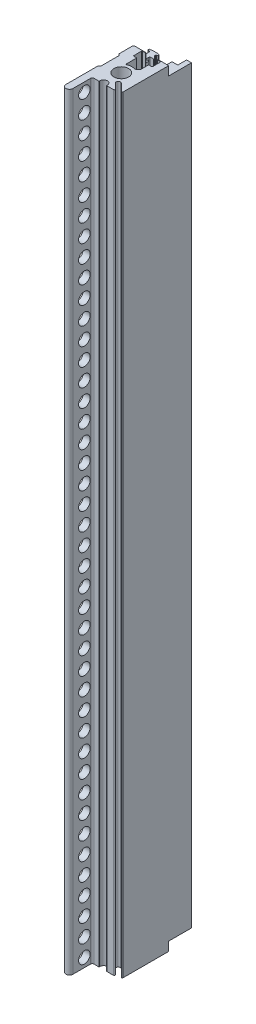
ISO-10303-21;
HEADER;
FILE_DESCRIPTION(('STEP AP214'),'2;1');
FILE_NAME('part.step','',(''),(''),'','','');
FILE_SCHEMA(('AUTOMOTIVE_DESIGN { 1 0 10303 214 1 1 1 1 }'));
ENDSEC;
DATA;
#1=APPLICATION_CONTEXT('core data for automotive mechanical design processes');
#2=APPLICATION_PROTOCOL_DEFINITION('international standard','automotive_design',2000,#1);
#3=PRODUCT_CONTEXT('',#1,'mechanical');
#4=PRODUCT('Part','Part','',(#3));
#5=PRODUCT_RELATED_PRODUCT_CATEGORY('part','',(#4));
#6=PRODUCT_DEFINITION_FORMATION('','',#4);
#7=PRODUCT_DEFINITION_CONTEXT('part definition',#1,'design');
#8=PRODUCT_DEFINITION('design','',#6,#7);
#9=PRODUCT_DEFINITION_SHAPE('','',#8);
#10=(LENGTH_UNIT() NAMED_UNIT(*) SI_UNIT(.MILLI.,.METRE.));
#11=(NAMED_UNIT(*) PLANE_ANGLE_UNIT() SI_UNIT($,.RADIAN.));
#12=(NAMED_UNIT(*) SI_UNIT($,.STERADIAN.) SOLID_ANGLE_UNIT());
#13=UNCERTAINTY_MEASURE_WITH_UNIT(LENGTH_MEASURE(1.E-05),#10,'distance_accuracy_value','');
#14=(GEOMETRIC_REPRESENTATION_CONTEXT(3) GLOBAL_UNCERTAINTY_ASSIGNED_CONTEXT((#13)) GLOBAL_UNIT_ASSIGNED_CONTEXT((#10,
#11,#12)) REPRESENTATION_CONTEXT('',''));
#15=CARTESIAN_POINT('',(0.,0.,0.));
#16=DIRECTION('',(0.,0.,1.));
#17=DIRECTION('',(1.,0.,0.));
#18=AXIS2_PLACEMENT_3D('',#15,#16,#17);
#19=CARTESIAN_POINT('',(-1.30167140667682E-07,109.22,1.54920077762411E-10));
#20=DIRECTION('',(0.,-1.,0.));
#21=DIRECTION('',(0.,0.,-1.));
#22=AXIS2_PLACEMENT_3D('',#19,#20,#21);
#23=CYLINDRICAL_SURFACE('',#22,1.6);
#24=CARTESIAN_POINT('',(-1.30167140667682E-07,99.22,1.54920077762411E-10));
#25=DIRECTION('',(0.,1.,0.));
#26=DIRECTION('',(0.,0.,1.));
#27=AXIS2_PLACEMENT_3D('',#24,#25,#26);
#28=CIRCLE('',#27,1.6);
#29=CARTESIAN_POINT('',(-1.30167140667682E-07,99.22,1.60000000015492));
#30=VERTEX_POINT('',#29);
#31=EDGE_CURVE('E698',#30,#30,#28,.T.);
#32=ORIENTED_EDGE('',*,*,#31,.T.);
#33=EDGE_LOOP('',(#32));
#34=FACE_BOUND('',#33,.T.);
#35=CARTESIAN_POINT('',(-1.30167140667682E-07,-99.22,1.54920077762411E-10));
#36=DIRECTION('',(0.,-1.,0.));
#37=DIRECTION('',(0.,0.,-1.));
#38=AXIS2_PLACEMENT_3D('',#35,#36,#37);
#39=CIRCLE('',#38,1.6);
#40=CARTESIAN_POINT('',(-1.30167140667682E-07,-99.22,-1.59999999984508));
#41=VERTEX_POINT('',#40);
#42=EDGE_CURVE('E704',#41,#41,#39,.T.);
#43=ORIENTED_EDGE('',*,*,#42,.T.);
#44=EDGE_LOOP('',(#43));
#45=FACE_BOUND('',#44,.T.);
#46=ADVANCED_FACE('F39',(#34,#45),#23,.F.);
#47=CARTESIAN_POINT('',(-1.30167140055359E-07,109.22,5.00000000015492));
#48=DIRECTION('',(0.,1.,0.));
#49=DIRECTION('',(0.,0.,1.));
#50=AXIS2_PLACEMENT_3D('',#47,#48,#49);
#51=PLANE('',#50);
#52=DIRECTION('',(0.,0.,-1.));
#53=VECTOR('',#52,1.);
#54=CARTESIAN_POINT('',(-1.45000013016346,109.22,-9.34999999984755));
#55=LINE('',#54,#53);
#56=CARTESIAN_POINT('',(-1.45000013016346,109.22,-8.34999999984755));
#57=VERTEX_POINT('',#56);
#58=CARTESIAN_POINT('',(-1.45000013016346,109.22,-8.49999999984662));
#59=VERTEX_POINT('',#58);
#60=EDGE_CURVE('E1195',#57,#59,#55,.T.);
#61=ORIENTED_EDGE('',*,*,#60,.T.);
#62=DIRECTION('',(-1.,0.,0.));
#63=VECTOR('',#62,1.);
#64=CARTESIAN_POINT('',(-4.44999999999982,109.22,-8.50000000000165));
#65=LINE('',#64,#63);
#66=CARTESIAN_POINT('',(-4.70000000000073,109.22,-8.50000000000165));
#67=VERTEX_POINT('',#66);
#68=EDGE_CURVE('E1198',#59,#67,#65,.T.);
#69=ORIENTED_EDGE('',*,*,#68,.T.);
#70=DIRECTION('',(-0.707106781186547,0.,0.707106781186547));
#71=VECTOR('',#70,1.);
#72=CARTESIAN_POINT('',(-4.70000000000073,109.22,-8.50000000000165));
#73=LINE('',#72,#71);
#74=CARTESIAN_POINT('',(-5.00000000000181,109.22,-8.20000000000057));
#75=VERTEX_POINT('',#74);
#76=EDGE_CURVE('E1200',#67,#75,#73,.T.);
#77=ORIENTED_EDGE('',*,*,#76,.T.);
#78=DIRECTION('',(0.,0.,1.));
#79=VECTOR('',#78,1.);
#80=CARTESIAN_POINT('',(-5.00000000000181,109.22,-8.20000000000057));
#81=LINE('',#80,#79);
#82=CARTESIAN_POINT('',(-5.00000000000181,109.22,-4.40000000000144));
#83=VERTEX_POINT('',#82);
#84=EDGE_CURVE('E1202',#75,#83,#81,.T.);
#85=ORIENTED_EDGE('',*,*,#84,.T.);
#86=DIRECTION('',(0.668928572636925,0.,0.743326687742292));
#87=VECTOR('',#86,1.);
#88=CARTESIAN_POINT('',(-4.54986793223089,109.22,-3.89980432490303));
#89=LINE('',#88,#87);
#90=CARTESIAN_POINT('',(-4.54986793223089,109.22,-3.89980432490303));
#91=VERTEX_POINT('',#90);
#92=EDGE_CURVE('E1204',#83,#91,#89,.T.);
#93=ORIENTED_EDGE('',*,*,#92,.T.);
#94=DIRECTION('',(-5.28322770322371E-05,0.,0.999999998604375));
#95=VECTOR('',#94,1.);
#96=CARTESIAN_POINT('',(-4.54986793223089,109.22,-3.89980432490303));
#97=LINE('',#96,#95);
#98=CARTESIAN_POINT('',(-4.55013209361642,109.22,1.10019567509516));
#99=VERTEX_POINT('',#98);
#100=EDGE_CURVE('E1206',#91,#99,#97,.T.);
#101=ORIENTED_EDGE('',*,*,#100,.T.);
#102=DIRECTION('',(-0.66900089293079,0.,0.743261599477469));
#103=VECTOR('',#102,1.);
#104=CARTESIAN_POINT('',(-5.,109.22,1.60000000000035));
#105=LINE('',#104,#103);
#106=CARTESIAN_POINT('',(-5.,109.22,1.60000000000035));
#107=VERTEX_POINT('',#106);
#108=EDGE_CURVE('E1208',#99,#107,#105,.T.);
#109=ORIENTED_EDGE('',*,*,#108,.T.);
#110=DIRECTION('',(0.,0.,1.));
#111=VECTOR('',#110,1.);
#112=CARTESIAN_POINT('',(-5.,109.22,10.7499999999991));
#113=LINE('',#112,#111);
#114=CARTESIAN_POINT('',(-5.,109.22,10.7499999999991));
#115=VERTEX_POINT('',#114);
#116=EDGE_CURVE('E1210',#107,#115,#113,.T.);
#117=ORIENTED_EDGE('',*,*,#116,.T.);
#118=CARTESIAN_POINT('',(-4.,109.22,10.7499999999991));
#119=DIRECTION('',(0.,1.,0.));
#120=DIRECTION('',(0.,0.,1.));
#121=AXIS2_PLACEMENT_3D('',#118,#119,#120);
#122=CIRCLE('',#121,1.);
#123=CARTESIAN_POINT('',(-3.,109.22,10.7499999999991));
#124=VERTEX_POINT('',#123);
#125=EDGE_CURVE('E1212',#115,#124,#122,.T.);
#126=ORIENTED_EDGE('',*,*,#125,.T.);
#127=DIRECTION('',(0.,0.,-1.));
#128=VECTOR('',#127,1.);
#129=CARTESIAN_POINT('',(-3.,109.22,10.7499999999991));
#130=LINE('',#129,#128);
#131=CARTESIAN_POINT('',(-3.,109.22,5.74999999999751));
#132=VERTEX_POINT('',#131);
#133=EDGE_CURVE('E1215',#124,#132,#130,.T.);
#134=ORIENTED_EDGE('',*,*,#133,.T.);
#135=CARTESIAN_POINT('',(-2.5,109.22,5.74999999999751));
#136=DIRECTION('',(0.,-1.,0.));
#137=DIRECTION('',(0.,0.,-1.));
#138=AXIS2_PLACEMENT_3D('',#135,#136,#137);
#139=CIRCLE('',#138,0.5);
#140=CARTESIAN_POINT('',(-2.5,109.22,5.24999999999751));
#141=VERTEX_POINT('',#140);
#142=EDGE_CURVE('E1217',#132,#141,#139,.T.);
#143=ORIENTED_EDGE('',*,*,#142,.T.);
#144=DIRECTION('',(1.,0.,0.));
#145=VECTOR('',#144,1.);
#146=CARTESIAN_POINT('',(-2.5,109.22,5.24999999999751));
#147=LINE('',#146,#145);
#148=CARTESIAN_POINT('',(-1.15000013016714,109.22,5.24999999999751));
#149=VERTEX_POINT('',#148);
#150=EDGE_CURVE('E1219',#141,#149,#147,.T.);
#151=ORIENTED_EDGE('',*,*,#150,.T.);
#152=CARTESIAN_POINT('',(-1.15000013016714,109.22,5.14999999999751));
#153=DIRECTION('',(0.,1.,0.));
#154=DIRECTION('',(0.,0.,-1.));
#155=AXIS2_PLACEMENT_3D('',#152,#153,#154);
#156=CIRCLE('',#155,0.0999999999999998);
#157=CARTESIAN_POINT('',(-1.05000013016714,109.22,5.14999999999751));
#158=VERTEX_POINT('',#157);
#159=EDGE_CURVE('E1221',#149,#158,#156,.T.);
#160=ORIENTED_EDGE('',*,*,#159,.T.);
#161=DIRECTION('',(0.,0.,-1.));
#162=VECTOR('',#161,1.);
#163=CARTESIAN_POINT('',(-1.05000013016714,109.22,5.00000000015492));
#164=LINE('',#163,#162);
#165=CARTESIAN_POINT('',(-1.05000013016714,109.22,5.00000000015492));
#166=VERTEX_POINT('',#165);
#167=EDGE_CURVE('E1223',#158,#166,#164,.T.);
#168=ORIENTED_EDGE('',*,*,#167,.T.);
#169=CARTESIAN_POINT('',(-1.30167140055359E-07,109.22,5.00000000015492));
#170=DIRECTION('',(0.,-1.,0.));
#171=DIRECTION('',(0.,0.,1.));
#172=AXIS2_PLACEMENT_3D('',#169,#170,#171);
#173=CIRCLE('',#172,1.05);
#174=CARTESIAN_POINT('',(1.04999986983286,109.22,5.00000000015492));
#175=VERTEX_POINT('',#174);
#176=EDGE_CURVE('E1152',#166,#175,#173,.T.);
#177=ORIENTED_EDGE('',*,*,#176,.T.);
#178=DIRECTION('',(0.,0.,1.));
#179=VECTOR('',#178,1.);
#180=CARTESIAN_POINT('',(1.04999986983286,109.22,5.00000000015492));
#181=LINE('',#180,#179);
#182=CARTESIAN_POINT('',(1.04999986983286,109.22,5.14999999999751));
#183=VERTEX_POINT('',#182);
#184=EDGE_CURVE('E1155',#175,#183,#181,.T.);
#185=ORIENTED_EDGE('',*,*,#184,.T.);
#186=CARTESIAN_POINT('',(1.14999986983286,109.22,5.14999999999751));
#187=DIRECTION('',(0.,1.,0.));
#188=DIRECTION('',(0.,0.,-1.));
#189=AXIS2_PLACEMENT_3D('',#186,#187,#188);
#190=CIRCLE('',#189,0.0999999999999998);
#191=CARTESIAN_POINT('',(1.14999986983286,109.22,5.24999999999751));
#192=VERTEX_POINT('',#191);
#193=EDGE_CURVE('E1158',#183,#192,#190,.T.);
#194=ORIENTED_EDGE('',*,*,#193,.T.);
#195=DIRECTION('',(1.,0.,0.));
#196=VECTOR('',#195,1.);
#197=CARTESIAN_POINT('',(1.14999986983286,109.22,5.24999999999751));
#198=LINE('',#197,#196);
#199=CARTESIAN_POINT('',(3.07034859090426,109.22,5.24999999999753));
#200=VERTEX_POINT('',#199);
#201=EDGE_CURVE('E1160',#192,#200,#198,.T.);
#202=ORIENTED_EDGE('',*,*,#201,.T.);
#203=CARTESIAN_POINT('',(3.07034859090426,109.22,5.04999999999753));
#204=DIRECTION('',(0.,1.,0.));
#205=DIRECTION('',(0.,0.,1.));
#206=AXIS2_PLACEMENT_3D('',#203,#204,#205);
#207=CIRCLE('',#206,0.2);
#208=CARTESIAN_POINT('',(3.21176994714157,109.22,4.90857864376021));
#209=VERTEX_POINT('',#208);
#210=EDGE_CURVE('E1162',#200,#209,#207,.T.);
#211=ORIENTED_EDGE('',*,*,#210,.T.);
#212=DIRECTION('',(-0.707106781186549,0.,-0.707106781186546));
#213=VECTOR('',#212,1.);
#214=CARTESIAN_POINT('',(1.68873016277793,109.22,3.38553885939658));
#215=LINE('',#214,#213);
#216=CARTESIAN_POINT('',(1.68873016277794,109.22,3.38553885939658));
#217=VERTEX_POINT('',#216);
#218=EDGE_CURVE('E1164',#209,#217,#215,.T.);
#219=ORIENTED_EDGE('',*,*,#218,.T.);
#220=CARTESIAN_POINT('',(2.11299423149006,109.22,2.96127479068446));
#221=DIRECTION('',(0.,-1.,0.));
#222=DIRECTION('',(0.,0.,1.));
#223=AXIS2_PLACEMENT_3D('',#220,#221,#222);
#224=CIRCLE('',#223,0.600000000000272);
#225=CARTESIAN_POINT('',(2.53725830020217,109.22,2.53701072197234));
#226=VERTEX_POINT('',#225);
#227=EDGE_CURVE('E1166',#217,#226,#224,.T.);
#228=ORIENTED_EDGE('',*,*,#227,.T.);
#229=DIRECTION('',(0.707106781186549,0.,0.707106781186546));
#230=VECTOR('',#229,1.);
#231=CARTESIAN_POINT('',(2.53725830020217,109.22,2.53701072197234));
#232=LINE('',#231,#230);
#233=CARTESIAN_POINT('',(4.65857864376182,109.22,4.65833106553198));
#234=VERTEX_POINT('',#233);
#235=EDGE_CURVE('E1169',#226,#234,#232,.T.);
#236=ORIENTED_EDGE('',*,*,#235,.T.);
#237=CARTESIAN_POINT('',(4.79999999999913,109.22,4.51690970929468));
#238=DIRECTION('',(0.,1.,0.));
#239=DIRECTION('',(0.,0.,1.));
#240=AXIS2_PLACEMENT_3D('',#237,#238,#239);
#241=CIRCLE('',#240,0.199999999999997);
#242=CARTESIAN_POINT('',(4.99999999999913,109.22,4.51690970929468));
#243=VERTEX_POINT('',#242);
#244=EDGE_CURVE('E1171',#234,#243,#241,.T.);
#245=ORIENTED_EDGE('',*,*,#244,.T.);
#246=DIRECTION('',(0.,0.,-1.));
#247=VECTOR('',#246,1.);
#248=CARTESIAN_POINT('',(4.99999999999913,109.22,2.08096169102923));
#249=LINE('',#248,#247);
#250=CARTESIAN_POINT('',(4.99999999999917,109.22,-8.49999999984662));
#251=VERTEX_POINT('',#250);
#252=EDGE_CURVE('E1173',#243,#251,#249,.T.);
#253=ORIENTED_EDGE('',*,*,#252,.T.);
#254=DIRECTION('',(1.,0.,0.));
#255=VECTOR('',#254,1.);
#256=CARTESIAN_POINT('',(-5.00000000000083,109.22,-8.49999999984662));
#257=LINE('',#256,#255);
#258=CARTESIAN_POINT('',(1.94999986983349,109.22,-8.49999999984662));
#259=VERTEX_POINT('',#258);
#260=EDGE_CURVE('E907',#259,#251,#257,.T.);
#261=ORIENTED_EDGE('',*,*,#260,.F.);
#262=DIRECTION('',(0.,0.,1.));
#263=VECTOR('',#262,1.);
#264=CARTESIAN_POINT('',(1.94999986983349,109.22,-8.34999999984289));
#265=LINE('',#264,#263);
#266=CARTESIAN_POINT('',(1.94999986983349,109.22,-8.34999999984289));
#267=VERTEX_POINT('',#266);
#268=EDGE_CURVE('E1176',#259,#267,#265,.T.);
#269=ORIENTED_EDGE('',*,*,#268,.T.);
#270=DIRECTION('',(1.,0.,0.));
#271=VECTOR('',#270,1.);
#272=CARTESIAN_POINT('',(2.84999986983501,109.22,-8.34999999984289));
#273=LINE('',#272,#271);
#274=CARTESIAN_POINT('',(2.74999986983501,109.22,-8.34999999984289));
#275=VERTEX_POINT('',#274);
#276=EDGE_CURVE('E1178',#267,#275,#273,.T.);
#277=ORIENTED_EDGE('',*,*,#276,.T.);
#278=CARTESIAN_POINT('',(2.74999986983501,109.22,-8.14999999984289));
#279=DIRECTION('',(0.,1.,0.));
#280=DIRECTION('',(0.,0.,1.));
#281=AXIS2_PLACEMENT_3D('',#278,#279,#280);
#282=CIRCLE('',#281,0.2);
#283=CARTESIAN_POINT('',(2.94999986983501,109.22,-8.14999999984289));
#284=VERTEX_POINT('',#283);
#285=EDGE_CURVE('E686',#275,#284,#282,.F.);
#286=ORIENTED_EDGE('',*,*,#285,.T.);
#287=DIRECTION('',(0.,0.,-1.));
#288=VECTOR('',#287,1.);
#289=CARTESIAN_POINT('',(2.94999986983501,109.22,-8.34999999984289));
#290=LINE('',#289,#288);
#291=CARTESIAN_POINT('',(2.94999986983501,109.22,-6.04999999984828));
#292=VERTEX_POINT('',#291);
#293=EDGE_CURVE('E702',#292,#284,#290,.T.);
#294=ORIENTED_EDGE('',*,*,#293,.F.);
#295=CARTESIAN_POINT('',(2.74999986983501,109.22,-6.04999999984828));
#296=DIRECTION('',(0.,1.,0.));
#297=DIRECTION('',(0.,0.,1.));
#298=AXIS2_PLACEMENT_3D('',#295,#296,#297);
#299=CIRCLE('',#298,0.2);
#300=CARTESIAN_POINT('',(2.74999986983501,109.22,-5.84999999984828));
#301=VERTEX_POINT('',#300);
#302=EDGE_CURVE('E682',#292,#301,#299,.F.);
#303=ORIENTED_EDGE('',*,*,#302,.T.);
#304=DIRECTION('',(1.,0.,0.));
#305=VECTOR('',#304,1.);
#306=CARTESIAN_POINT('',(2.94999986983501,109.22,-5.84999999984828));
#307=LINE('',#306,#305);
#308=CARTESIAN_POINT('',(1.94999986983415,109.22,-5.84999999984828));
#309=VERTEX_POINT('',#308);
#310=EDGE_CURVE('E1147',#309,#301,#307,.T.);
#311=ORIENTED_EDGE('',*,*,#310,.F.);
#312=DIRECTION('',(0.,0.,1.));
#313=VECTOR('',#312,1.);
#314=CARTESIAN_POINT('',(1.94999986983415,109.22,-3.88555015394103));
#315=LINE('',#314,#313);
#316=CARTESIAN_POINT('',(1.94999986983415,109.22,-3.88555015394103));
#317=VERTEX_POINT('',#316);
#318=EDGE_CURVE('E1182',#309,#317,#315,.T.);
#319=ORIENTED_EDGE('',*,*,#318,.T.);
#320=CARTESIAN_POINT('',(0.949999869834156,109.22,-3.88555015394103));
#321=DIRECTION('',(0.,-1.,0.));
#322=DIRECTION('',(0.,0.,1.));
#323=AXIS2_PLACEMENT_3D('',#320,#321,#322);
#324=CIRCLE('',#323,0.999999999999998);
#325=CARTESIAN_POINT('',(0.712499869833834,109.22,-2.91416261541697));
#326=VERTEX_POINT('',#325);
#327=EDGE_CURVE('E1184',#317,#326,#324,.T.);
#328=ORIENTED_EDGE('',*,*,#327,.T.);
#329=CARTESIAN_POINT('',(-1.30167140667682E-07,109.22,1.54920077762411E-10));
#330=DIRECTION('',(0.,1.,0.));
#331=DIRECTION('',(0.,0.,1.));
#332=AXIS2_PLACEMENT_3D('',#329,#330,#331);
#333=CIRCLE('',#332,2.99999999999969);
#334=CARTESIAN_POINT('',(-1.17187513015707,109.22,-2.76164968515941));
#335=VERTEX_POINT('',#334);
#336=EDGE_CURVE('E1186',#326,#335,#333,.T.);
#337=ORIENTED_EDGE('',*,*,#336,.T.);
#338=CARTESIAN_POINT('',(-1.2500001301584,109.22,-2.94575966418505));
#339=DIRECTION('',(0.,-1.,0.));
#340=DIRECTION('',(0.,0.,1.));
#341=AXIS2_PLACEMENT_3D('',#338,#339,#340);
#342=CIRCLE('',#341,0.200000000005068);
#343=CARTESIAN_POINT('',(-1.45000013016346,109.22,-2.94575966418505));
#344=VERTEX_POINT('',#343);
#345=EDGE_CURVE('E1188',#335,#344,#342,.T.);
#346=ORIENTED_EDGE('',*,*,#345,.T.);
#347=DIRECTION('',(0.,0.,-1.));
#348=VECTOR('',#347,1.);
#349=CARTESIAN_POINT('',(-1.45000013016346,109.22,-6.04999999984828));
#350=LINE('',#349,#348);
#351=CARTESIAN_POINT('',(-1.45000013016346,109.22,-5.84999999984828));
#352=VERTEX_POINT('',#351);
#353=EDGE_CURVE('E1190',#344,#352,#350,.T.);
#354=ORIENTED_EDGE('',*,*,#353,.T.);
#355=CARTESIAN_POINT('',(-2.25000013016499,109.22,-5.84999999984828));
#356=VERTEX_POINT('',#355);
#357=EDGE_CURVE('E1135',#356,#352,#307,.T.);
#358=ORIENTED_EDGE('',*,*,#357,.F.);
#359=CARTESIAN_POINT('',(-2.25000013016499,109.22,-6.04999999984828));
#360=DIRECTION('',(0.,1.,0.));
#361=DIRECTION('',(0.,0.,1.));
#362=AXIS2_PLACEMENT_3D('',#359,#360,#361);
#363=CIRCLE('',#362,0.2);
#364=CARTESIAN_POINT('',(-2.45000013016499,109.22,-6.04999999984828));
#365=VERTEX_POINT('',#364);
#366=EDGE_CURVE('E690',#356,#365,#363,.F.);
#367=ORIENTED_EDGE('',*,*,#366,.T.);
#368=DIRECTION('',(0.,0.,1.));
#369=VECTOR('',#368,1.);
#370=CARTESIAN_POINT('',(-2.45000013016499,109.22,-8.34999999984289));
#371=LINE('',#370,#369);
#372=CARTESIAN_POINT('',(-2.45000013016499,109.22,-8.14999999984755));
#373=VERTEX_POINT('',#372);
#374=EDGE_CURVE('E1144',#373,#365,#371,.T.);
#375=ORIENTED_EDGE('',*,*,#374,.F.);
#376=CARTESIAN_POINT('',(-2.25000013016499,109.22,-8.14999999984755));
#377=DIRECTION('',(0.,1.,0.));
#378=DIRECTION('',(0.,0.,1.));
#379=AXIS2_PLACEMENT_3D('',#376,#377,#378);
#380=CIRCLE('',#379,0.2);
#381=CARTESIAN_POINT('',(-2.25000013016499,109.22,-8.34999999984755));
#382=VERTEX_POINT('',#381);
#383=EDGE_CURVE('E694',#373,#382,#380,.F.);
#384=ORIENTED_EDGE('',*,*,#383,.T.);
#385=DIRECTION('',(1.,0.,0.));
#386=VECTOR('',#385,1.);
#387=CARTESIAN_POINT('',(-1.45000013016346,109.22,-8.34999999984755));
#388=LINE('',#387,#386);
#389=EDGE_CURVE('E1193',#382,#57,#388,.T.);
#390=ORIENTED_EDGE('',*,*,#389,.T.);
#391=EDGE_LOOP('',(#61,#69,#77,#85,#93,#101,#109,#117,#126,#134,#143,#151,#160,#168,#177,#185,
#194,#202,#211,#219,#228,#236,#245,#253,#261,#269,#277,#286,#294,#303,#311,#319,#328,#337,#346,
#354,#358,#367,#375,#384,#390));
#392=FACE_BOUND('',#391,.T.);
#393=CARTESIAN_POINT('',(0.,109.22,0.));
#394=DIRECTION('',(0.,1.,0.));
#395=DIRECTION('',(0.,0.,1.));
#396=AXIS2_PLACEMENT_3D('',#393,#394,#395);
#397=CIRCLE('',#396,2.1);
#398=CARTESIAN_POINT('',(0.,109.22,2.1));
#399=VERTEX_POINT('',#398);
#400=EDGE_CURVE('E707',#399,#399,#397,.T.);
#401=ORIENTED_EDGE('',*,*,#400,.F.);
#402=EDGE_LOOP('',(#401));
#403=FACE_BOUND('',#402,.T.);
#404=ADVANCED_FACE('F1590',(#392,#403),#51,.T.);
#405=CARTESIAN_POINT('',(-1.30167140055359E-07,-109.22,5.00000000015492));
#406=DIRECTION('',(0.,1.,0.));
#407=DIRECTION('',(0.,0.,1.));
#408=AXIS2_PLACEMENT_3D('',#405,#406,#407);
#409=PLANE('',#408);
#410=CARTESIAN_POINT('',(0.,-109.22,0.));
#411=DIRECTION('',(0.,-1.,0.));
#412=DIRECTION('',(0.,0.,-1.));
#413=AXIS2_PLACEMENT_3D('',#410,#411,#412);
#414=CIRCLE('',#413,2.1);
#415=CARTESIAN_POINT('',(0.,-109.22,-2.1));
#416=VERTEX_POINT('',#415);
#417=EDGE_CURVE('E713',#416,#416,#414,.T.);
#418=ORIENTED_EDGE('',*,*,#417,.F.);
#419=EDGE_LOOP('',(#418));
#420=FACE_BOUND('',#419,.T.);
#421=DIRECTION('',(-1.,0.,0.));
#422=VECTOR('',#421,1.);
#423=CARTESIAN_POINT('',(-4.44999999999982,-109.22,-8.50000000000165));
#424=LINE('',#423,#422);
#425=CARTESIAN_POINT('',(-1.45000013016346,-109.22,-8.49999999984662));
#426=VERTEX_POINT('',#425);
#427=CARTESIAN_POINT('',(-4.70000000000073,-109.22,-8.50000000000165));
#428=VERTEX_POINT('',#427);
#429=EDGE_CURVE('E1270',#426,#428,#424,.T.);
#430=ORIENTED_EDGE('',*,*,#429,.F.);
#431=DIRECTION('',(0.,0.,-1.));
#432=VECTOR('',#431,1.);
#433=CARTESIAN_POINT('',(-1.45000013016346,-109.22,-9.34999999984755));
#434=LINE('',#433,#432);
#435=CARTESIAN_POINT('',(-1.45000013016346,-109.22,-8.34999999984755));
#436=VERTEX_POINT('',#435);
#437=EDGE_CURVE('E1267',#436,#426,#434,.T.);
#438=ORIENTED_EDGE('',*,*,#437,.F.);
#439=DIRECTION('',(1.,0.,0.));
#440=VECTOR('',#439,1.);
#441=CARTESIAN_POINT('',(-1.45000013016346,-109.22,-8.34999999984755));
#442=LINE('',#441,#440);
#443=CARTESIAN_POINT('',(-2.25000013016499,-109.22,-8.34999999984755));
#444=VERTEX_POINT('',#443);
#445=EDGE_CURVE('E1264',#444,#436,#442,.T.);
#446=ORIENTED_EDGE('',*,*,#445,.F.);
#447=CARTESIAN_POINT('',(-2.25000013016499,-109.22,-8.14999999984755));
#448=DIRECTION('',(0.,1.,0.));
#449=DIRECTION('',(0.,0.,1.));
#450=AXIS2_PLACEMENT_3D('',#447,#448,#449);
#451=CIRCLE('',#450,0.2);
#452=CARTESIAN_POINT('',(-2.45000013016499,-109.22,-8.14999999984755));
#453=VERTEX_POINT('',#452);
#454=EDGE_CURVE('E696',#444,#453,#451,.T.);
#455=ORIENTED_EDGE('',*,*,#454,.T.);
#456=DIRECTION('',(0.,0.,1.));
#457=VECTOR('',#456,1.);
#458=CARTESIAN_POINT('',(-2.45000013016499,-109.22,-8.34999999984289));
#459=LINE('',#458,#457);
#460=CARTESIAN_POINT('',(-2.45000013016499,-109.22,-6.04999999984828));
#461=VERTEX_POINT('',#460);
#462=EDGE_CURVE('E1134',#453,#461,#459,.T.);
#463=ORIENTED_EDGE('',*,*,#462,.T.);
#464=CARTESIAN_POINT('',(-2.25000013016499,-109.22,-6.04999999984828));
#465=DIRECTION('',(0.,1.,0.));
#466=DIRECTION('',(0.,0.,1.));
#467=AXIS2_PLACEMENT_3D('',#464,#465,#466);
#468=CIRCLE('',#467,0.2);
#469=CARTESIAN_POINT('',(-2.25000013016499,-109.22,-5.84999999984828));
#470=VERTEX_POINT('',#469);
#471=EDGE_CURVE('E692',#461,#470,#468,.T.);
#472=ORIENTED_EDGE('',*,*,#471,.T.);
#473=DIRECTION('',(1.,0.,0.));
#474=VECTOR('',#473,1.);
#475=CARTESIAN_POINT('',(2.94999986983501,-109.22,-5.84999999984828));
#476=LINE('',#475,#474);
#477=CARTESIAN_POINT('',(-1.45000013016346,-109.22,-5.84999999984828));
#478=VERTEX_POINT('',#477);
#479=EDGE_CURVE('E1139',#470,#478,#476,.T.);
#480=ORIENTED_EDGE('',*,*,#479,.T.);
#481=DIRECTION('',(0.,0.,-1.));
#482=VECTOR('',#481,1.);
#483=CARTESIAN_POINT('',(-1.45000013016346,-109.22,-6.04999999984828));
#484=LINE('',#483,#482);
#485=CARTESIAN_POINT('',(-1.45000013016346,-109.22,-2.94575966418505));
#486=VERTEX_POINT('',#485);
#487=EDGE_CURVE('E1261',#486,#478,#484,.T.);
#488=ORIENTED_EDGE('',*,*,#487,.F.);
#489=CARTESIAN_POINT('',(-1.2500001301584,-109.22,-2.94575966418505));
#490=DIRECTION('',(0.,-1.,0.));
#491=DIRECTION('',(0.,0.,1.));
#492=AXIS2_PLACEMENT_3D('',#489,#490,#491);
#493=CIRCLE('',#492,0.200000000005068);
#494=CARTESIAN_POINT('',(-1.17187513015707,-109.22,-2.76164968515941));
#495=VERTEX_POINT('',#494);
#496=EDGE_CURVE('E1259',#495,#486,#493,.T.);
#497=ORIENTED_EDGE('',*,*,#496,.F.);
#498=CARTESIAN_POINT('',(-1.30167140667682E-07,-109.22,1.54920077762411E-10));
#499=DIRECTION('',(0.,1.,0.));
#500=DIRECTION('',(0.,0.,1.));
#501=AXIS2_PLACEMENT_3D('',#498,#499,#500);
#502=CIRCLE('',#501,2.99999999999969);
#503=CARTESIAN_POINT('',(0.712499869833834,-109.22,-2.91416261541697));
#504=VERTEX_POINT('',#503);
#505=EDGE_CURVE('E1257',#504,#495,#502,.T.);
#506=ORIENTED_EDGE('',*,*,#505,.F.);
#507=CARTESIAN_POINT('',(0.949999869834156,-109.22,-3.88555015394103));
#508=DIRECTION('',(0.,-1.,0.));
#509=DIRECTION('',(0.,0.,1.));
#510=AXIS2_PLACEMENT_3D('',#507,#508,#509);
#511=CIRCLE('',#510,0.999999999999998);
#512=CARTESIAN_POINT('',(1.94999986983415,-109.22,-3.88555015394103));
#513=VERTEX_POINT('',#512);
#514=EDGE_CURVE('E1255',#513,#504,#511,.T.);
#515=ORIENTED_EDGE('',*,*,#514,.F.);
#516=DIRECTION('',(0.,0.,1.));
#517=VECTOR('',#516,1.);
#518=CARTESIAN_POINT('',(1.94999986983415,-109.22,-3.88555015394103));
#519=LINE('',#518,#517);
#520=CARTESIAN_POINT('',(1.94999986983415,-109.22,-5.84999999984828));
#521=VERTEX_POINT('',#520);
#522=EDGE_CURVE('E1253',#521,#513,#519,.T.);
#523=ORIENTED_EDGE('',*,*,#522,.F.);
#524=CARTESIAN_POINT('',(2.74999986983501,-109.22,-5.84999999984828));
#525=VERTEX_POINT('',#524);
#526=EDGE_CURVE('E1138',#521,#525,#476,.T.);
#527=ORIENTED_EDGE('',*,*,#526,.T.);
#528=CARTESIAN_POINT('',(2.74999986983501,-109.22,-6.04999999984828));
#529=DIRECTION('',(0.,1.,0.));
#530=DIRECTION('',(0.,0.,1.));
#531=AXIS2_PLACEMENT_3D('',#528,#529,#530);
#532=CIRCLE('',#531,0.2);
#533=CARTESIAN_POINT('',(2.94999986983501,-109.22,-6.04999999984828));
#534=VERTEX_POINT('',#533);
#535=EDGE_CURVE('E684',#525,#534,#532,.T.);
#536=ORIENTED_EDGE('',*,*,#535,.T.);
#537=DIRECTION('',(0.,0.,-1.));
#538=VECTOR('',#537,1.);
#539=CARTESIAN_POINT('',(2.94999986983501,-109.22,-8.34999999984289));
#540=LINE('',#539,#538);
#541=CARTESIAN_POINT('',(2.94999986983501,-109.22,-8.14999999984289));
#542=VERTEX_POINT('',#541);
#543=EDGE_CURVE('E1131',#534,#542,#540,.T.);
#544=ORIENTED_EDGE('',*,*,#543,.T.);
#545=CARTESIAN_POINT('',(2.74999986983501,-109.22,-8.14999999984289));
#546=DIRECTION('',(0.,1.,0.));
#547=DIRECTION('',(0.,0.,1.));
#548=AXIS2_PLACEMENT_3D('',#545,#546,#547);
#549=CIRCLE('',#548,0.2);
#550=CARTESIAN_POINT('',(2.74999986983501,-109.22,-8.34999999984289));
#551=VERTEX_POINT('',#550);
#552=EDGE_CURVE('E688',#542,#551,#549,.T.);
#553=ORIENTED_EDGE('',*,*,#552,.T.);
#554=DIRECTION('',(1.,0.,0.));
#555=VECTOR('',#554,1.);
#556=CARTESIAN_POINT('',(2.84999986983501,-109.22,-8.34999999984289));
#557=LINE('',#556,#555);
#558=CARTESIAN_POINT('',(1.94999986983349,-109.22,-8.34999999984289));
#559=VERTEX_POINT('',#558);
#560=EDGE_CURVE('E1250',#559,#551,#557,.T.);
#561=ORIENTED_EDGE('',*,*,#560,.F.);
#562=DIRECTION('',(0.,0.,1.));
#563=VECTOR('',#562,1.);
#564=CARTESIAN_POINT('',(1.94999986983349,-109.22,-8.34999999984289));
#565=LINE('',#564,#563);
#566=CARTESIAN_POINT('',(1.94999986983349,-109.22,-8.49999999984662));
#567=VERTEX_POINT('',#566);
#568=EDGE_CURVE('E1248',#567,#559,#565,.T.);
#569=ORIENTED_EDGE('',*,*,#568,.F.);
#570=DIRECTION('',(1.,0.,0.));
#571=VECTOR('',#570,1.);
#572=CARTESIAN_POINT('',(-5.00000000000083,-109.22,-8.49999999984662));
#573=LINE('',#572,#571);
#574=CARTESIAN_POINT('',(4.99999999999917,-109.22,-8.49999999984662));
#575=VERTEX_POINT('',#574);
#576=EDGE_CURVE('E1604',#567,#575,#573,.T.);
#577=ORIENTED_EDGE('',*,*,#576,.T.);
#578=DIRECTION('',(0.,0.,-1.));
#579=VECTOR('',#578,1.);
#580=CARTESIAN_POINT('',(4.99999999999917,-109.22,-14.9999999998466));
#581=LINE('',#580,#579);
#582=CARTESIAN_POINT('',(4.99999999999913,-109.22,4.51690970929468));
#583=VERTEX_POINT('',#582);
#584=EDGE_CURVE('E1246',#583,#575,#581,.T.);
#585=ORIENTED_EDGE('',*,*,#584,.F.);
#586=CARTESIAN_POINT('',(4.79999999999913,-109.22,4.51690970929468));
#587=DIRECTION('',(0.,1.,0.));
#588=DIRECTION('',(0.,0.,1.));
#589=AXIS2_PLACEMENT_3D('',#586,#587,#588);
#590=CIRCLE('',#589,0.199999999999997);
#591=CARTESIAN_POINT('',(4.65857864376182,-109.22,4.65833106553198));
#592=VERTEX_POINT('',#591);
#593=EDGE_CURVE('E1243',#592,#583,#590,.T.);
#594=ORIENTED_EDGE('',*,*,#593,.F.);
#595=DIRECTION('',(0.707106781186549,0.,0.707106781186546));
#596=VECTOR('',#595,1.);
#597=CARTESIAN_POINT('',(2.53725830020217,-109.22,2.53701072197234));
#598=LINE('',#597,#596);
#599=CARTESIAN_POINT('',(2.53725830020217,-109.22,2.53701072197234));
#600=VERTEX_POINT('',#599);
#601=EDGE_CURVE('E1241',#600,#592,#598,.T.);
#602=ORIENTED_EDGE('',*,*,#601,.F.);
#603=CARTESIAN_POINT('',(2.11299423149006,-109.22,2.96127479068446));
#604=DIRECTION('',(0.,-1.,0.));
#605=DIRECTION('',(0.,0.,1.));
#606=AXIS2_PLACEMENT_3D('',#603,#604,#605);
#607=CIRCLE('',#606,0.600000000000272);
#608=CARTESIAN_POINT('',(1.68873016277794,-109.22,3.38553885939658));
#609=VERTEX_POINT('',#608);
#610=EDGE_CURVE('E1238',#609,#600,#607,.T.);
#611=ORIENTED_EDGE('',*,*,#610,.F.);
#612=DIRECTION('',(-0.707106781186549,0.,-0.707106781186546));
#613=VECTOR('',#612,1.);
#614=CARTESIAN_POINT('',(1.68873016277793,-109.22,3.38553885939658));
#615=LINE('',#614,#613);
#616=CARTESIAN_POINT('',(3.21176994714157,-109.22,4.90857864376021));
#617=VERTEX_POINT('',#616);
#618=EDGE_CURVE('E1236',#617,#609,#615,.T.);
#619=ORIENTED_EDGE('',*,*,#618,.F.);
#620=CARTESIAN_POINT('',(3.07034859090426,-109.22,5.04999999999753));
#621=DIRECTION('',(0.,1.,0.));
#622=DIRECTION('',(0.,0.,1.));
#623=AXIS2_PLACEMENT_3D('',#620,#621,#622);
#624=CIRCLE('',#623,0.2);
#625=CARTESIAN_POINT('',(3.07034859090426,-109.22,5.24999999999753));
#626=VERTEX_POINT('',#625);
#627=EDGE_CURVE('E1234',#626,#617,#624,.T.);
#628=ORIENTED_EDGE('',*,*,#627,.F.);
#629=DIRECTION('',(1.,0.,0.));
#630=VECTOR('',#629,1.);
#631=CARTESIAN_POINT('',(1.14999986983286,-109.22,5.24999999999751));
#632=LINE('',#631,#630);
#633=CARTESIAN_POINT('',(1.14999986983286,-109.22,5.24999999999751));
#634=VERTEX_POINT('',#633);
#635=EDGE_CURVE('E1232',#634,#626,#632,.T.);
#636=ORIENTED_EDGE('',*,*,#635,.F.);
#637=CARTESIAN_POINT('',(1.14999986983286,-109.22,5.14999999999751));
#638=DIRECTION('',(0.,1.,0.));
#639=DIRECTION('',(0.,0.,-1.));
#640=AXIS2_PLACEMENT_3D('',#637,#638,#639);
#641=CIRCLE('',#640,0.0999999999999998);
#642=CARTESIAN_POINT('',(1.04999986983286,-109.22,5.14999999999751));
#643=VERTEX_POINT('',#642);
#644=EDGE_CURVE('E1230',#643,#634,#641,.T.);
#645=ORIENTED_EDGE('',*,*,#644,.F.);
#646=DIRECTION('',(0.,0.,1.));
#647=VECTOR('',#646,1.);
#648=CARTESIAN_POINT('',(1.04999986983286,-109.22,5.00000000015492));
#649=LINE('',#648,#647);
#650=CARTESIAN_POINT('',(1.04999986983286,-109.22,5.00000000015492));
#651=VERTEX_POINT('',#650);
#652=EDGE_CURVE('E1228',#651,#643,#649,.T.);
#653=ORIENTED_EDGE('',*,*,#652,.F.);
#654=CARTESIAN_POINT('',(-1.30167140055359E-07,-109.22,5.00000000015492));
#655=DIRECTION('',(0.,-1.,0.));
#656=DIRECTION('',(0.,0.,1.));
#657=AXIS2_PLACEMENT_3D('',#654,#655,#656);
#658=CIRCLE('',#657,1.05);
#659=CARTESIAN_POINT('',(-1.05000013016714,-109.22,5.00000000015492));
#660=VERTEX_POINT('',#659);
#661=EDGE_CURVE('E1151',#660,#651,#658,.T.);
#662=ORIENTED_EDGE('',*,*,#661,.F.);
#663=DIRECTION('',(0.,0.,-1.));
#664=VECTOR('',#663,1.);
#665=CARTESIAN_POINT('',(-1.05000013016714,-109.22,5.00000000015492));
#666=LINE('',#665,#664);
#667=CARTESIAN_POINT('',(-1.05000013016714,-109.22,5.14999999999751));
#668=VERTEX_POINT('',#667);
#669=EDGE_CURVE('E1156',#668,#660,#666,.T.);
#670=ORIENTED_EDGE('',*,*,#669,.F.);
#671=CARTESIAN_POINT('',(-1.15000013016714,-109.22,5.14999999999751));
#672=DIRECTION('',(0.,1.,0.));
#673=DIRECTION('',(0.,0.,-1.));
#674=AXIS2_PLACEMENT_3D('',#671,#672,#673);
#675=CIRCLE('',#674,0.0999999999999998);
#676=CARTESIAN_POINT('',(-1.15000013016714,-109.22,5.24999999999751));
#677=VERTEX_POINT('',#676);
#678=EDGE_CURVE('E1296',#677,#668,#675,.T.);
#679=ORIENTED_EDGE('',*,*,#678,.F.);
#680=DIRECTION('',(1.,0.,0.));
#681=VECTOR('',#680,1.);
#682=CARTESIAN_POINT('',(-2.5,-109.22,5.24999999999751));
#683=LINE('',#682,#681);
#684=CARTESIAN_POINT('',(-2.5,-109.22,5.24999999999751));
#685=VERTEX_POINT('',#684);
#686=EDGE_CURVE('E1294',#685,#677,#683,.T.);
#687=ORIENTED_EDGE('',*,*,#686,.F.);
#688=CARTESIAN_POINT('',(-2.5,-109.22,5.74999999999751));
#689=DIRECTION('',(0.,-1.,0.));
#690=DIRECTION('',(0.,0.,-1.));
#691=AXIS2_PLACEMENT_3D('',#688,#689,#690);
#692=CIRCLE('',#691,0.5);
#693=CARTESIAN_POINT('',(-3.,-109.22,5.74999999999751));
#694=VERTEX_POINT('',#693);
#695=EDGE_CURVE('E1292',#694,#685,#692,.T.);
#696=ORIENTED_EDGE('',*,*,#695,.F.);
#697=DIRECTION('',(0.,0.,-1.));
#698=VECTOR('',#697,1.);
#699=CARTESIAN_POINT('',(-3.,-109.22,10.7499999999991));
#700=LINE('',#699,#698);
#701=CARTESIAN_POINT('',(-3.,-109.22,10.7499999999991));
#702=VERTEX_POINT('',#701);
#703=EDGE_CURVE('E1290',#702,#694,#700,.T.);
#704=ORIENTED_EDGE('',*,*,#703,.F.);
#705=CARTESIAN_POINT('',(-4.,-109.22,10.7499999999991));
#706=DIRECTION('',(0.,1.,0.));
#707=DIRECTION('',(0.,0.,1.));
#708=AXIS2_PLACEMENT_3D('',#705,#706,#707);
#709=CIRCLE('',#708,1.);
#710=CARTESIAN_POINT('',(-5.,-109.22,10.7499999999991));
#711=VERTEX_POINT('',#710);
#712=EDGE_CURVE('E1287',#711,#702,#709,.T.);
#713=ORIENTED_EDGE('',*,*,#712,.F.);
#714=DIRECTION('',(0.,0.,1.));
#715=VECTOR('',#714,1.);
#716=CARTESIAN_POINT('',(-5.,-109.22,10.7499999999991));
#717=LINE('',#716,#715);
#718=CARTESIAN_POINT('',(-5.,-109.22,1.60000000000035));
#719=VERTEX_POINT('',#718);
#720=EDGE_CURVE('E1285',#719,#711,#717,.T.);
#721=ORIENTED_EDGE('',*,*,#720,.F.);
#722=DIRECTION('',(-0.66900089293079,0.,0.743261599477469));
#723=VECTOR('',#722,1.);
#724=CARTESIAN_POINT('',(-5.,-109.22,1.60000000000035));
#725=LINE('',#724,#723);
#726=CARTESIAN_POINT('',(-4.55013209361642,-109.22,1.10019567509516));
#727=VERTEX_POINT('',#726);
#728=EDGE_CURVE('E1283',#727,#719,#725,.T.);
#729=ORIENTED_EDGE('',*,*,#728,.F.);
#730=DIRECTION('',(-5.28322770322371E-05,0.,0.999999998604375));
#731=VECTOR('',#730,1.);
#732=CARTESIAN_POINT('',(-4.54986793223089,-109.22,-3.89980432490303));
#733=LINE('',#732,#731);
#734=CARTESIAN_POINT('',(-4.54986793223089,-109.22,-3.89980432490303));
#735=VERTEX_POINT('',#734);
#736=EDGE_CURVE('E1280',#735,#727,#733,.T.);
#737=ORIENTED_EDGE('',*,*,#736,.F.);
#738=DIRECTION('',(0.668928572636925,0.,0.743326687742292));
#739=VECTOR('',#738,1.);
#740=CARTESIAN_POINT('',(-4.54986793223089,-109.22,-3.89980432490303));
#741=LINE('',#740,#739);
#742=CARTESIAN_POINT('',(-5.00000000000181,-109.22,-4.40000000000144));
#743=VERTEX_POINT('',#742);
#744=EDGE_CURVE('E1278',#743,#735,#741,.T.);
#745=ORIENTED_EDGE('',*,*,#744,.F.);
#746=DIRECTION('',(0.,0.,1.));
#747=VECTOR('',#746,1.);
#748=CARTESIAN_POINT('',(-5.00000000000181,-109.22,-4.40000000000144));
#749=LINE('',#748,#747);
#750=CARTESIAN_POINT('',(-5.00000000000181,-109.22,-8.20000000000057));
#751=VERTEX_POINT('',#750);
#752=EDGE_CURVE('E1276',#751,#743,#749,.T.);
#753=ORIENTED_EDGE('',*,*,#752,.F.);
#754=DIRECTION('',(-0.707106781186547,0.,0.707106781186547));
#755=VECTOR('',#754,1.);
#756=CARTESIAN_POINT('',(-4.70000000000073,-109.22,-8.50000000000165));
#757=LINE('',#756,#755);
#758=EDGE_CURVE('E1273',#428,#751,#757,.T.);
#759=ORIENTED_EDGE('',*,*,#758,.F.);
#760=EDGE_LOOP('',(#430,#438,#446,#455,#463,#472,#480,#488,#497,#506,#515,#523,#527,#536,#544,
#553,#561,#569,#577,#585,#594,#602,#611,#619,#628,#636,#645,#653,#662,#670,#679,#687,#696,#704,
#713,#721,#729,#737,#745,#753,#759));
#761=FACE_BOUND('',#760,.T.);
#762=ADVANCED_FACE('F1601',(#420,#761),#409,.F.);
#763=CARTESIAN_POINT('',(-1.30167140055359E-07,109.22,5.00000000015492));
#764=DIRECTION('',(0.,-1.,0.));
#765=DIRECTION('',(0.,0.,-1.));
#766=AXIS2_PLACEMENT_3D('',#763,#764,#765);
#767=CYLINDRICAL_SURFACE('',#766,1.05);
#768=ORIENTED_EDGE('',*,*,#661,.T.);
#769=DIRECTION('',(0.,-1.,0.));
#770=VECTOR('',#769,1.);
#771=CARTESIAN_POINT('',(1.04999986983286,109.22,5.00000000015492));
#772=LINE('',#771,#770);
#773=EDGE_CURVE('E636',#175,#651,#772,.T.);
#774=ORIENTED_EDGE('',*,*,#773,.F.);
#775=ORIENTED_EDGE('',*,*,#176,.F.);
#776=DIRECTION('',(0.,-1.,0.));
#777=VECTOR('',#776,1.);
#778=CARTESIAN_POINT('',(-1.05000013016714,109.22,5.00000000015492));
#779=LINE('',#778,#777);
#780=EDGE_CURVE('E1225',#166,#660,#779,.T.);
#781=ORIENTED_EDGE('',*,*,#780,.T.);
#782=EDGE_LOOP('',(#768,#774,#775,#781));
#783=FACE_BOUND('',#782,.T.);
#784=ADVANCED_FACE('F1647',(#783),#767,.F.);
#785=CARTESIAN_POINT('',(1.04999986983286,109.22,5.00000000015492));
#786=DIRECTION('',(1.,0.,0.));
#787=DIRECTION('',(0.,0.,-1.));
#788=AXIS2_PLACEMENT_3D('',#785,#786,#787);
#789=PLANE('',#788);
#790=ORIENTED_EDGE('',*,*,#652,.T.);
#791=DIRECTION('',(0.,-1.,0.));
#792=VECTOR('',#791,1.);
#793=CARTESIAN_POINT('',(1.04999986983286,109.22,5.14999999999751));
#794=LINE('',#793,#792);
#795=EDGE_CURVE('E633',#183,#643,#794,.T.);
#796=ORIENTED_EDGE('',*,*,#795,.F.);
#797=ORIENTED_EDGE('',*,*,#184,.F.);
#798=ORIENTED_EDGE('',*,*,#773,.T.);
#799=EDGE_LOOP('',(#790,#796,#797,#798));
#800=FACE_BOUND('',#799,.T.);
#801=ADVANCED_FACE('F1959',(#800),#789,.F.);
#802=CARTESIAN_POINT('',(1.14999986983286,109.22,5.14999999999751));
#803=DIRECTION('',(0.,-1.,0.));
#804=DIRECTION('',(0.,0.,-1.));
#805=AXIS2_PLACEMENT_3D('',#802,#803,#804);
#806=CYLINDRICAL_SURFACE('',#805,0.0999999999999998);
#807=ORIENTED_EDGE('',*,*,#644,.T.);
#808=DIRECTION('',(0.,-1.,0.));
#809=VECTOR('',#808,1.);
#810=CARTESIAN_POINT('',(1.14999986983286,109.22,5.24999999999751));
#811=LINE('',#810,#809);
#812=EDGE_CURVE('E630',#192,#634,#811,.T.);
#813=ORIENTED_EDGE('',*,*,#812,.F.);
#814=ORIENTED_EDGE('',*,*,#193,.F.);
#815=ORIENTED_EDGE('',*,*,#795,.T.);
#816=EDGE_LOOP('',(#807,#813,#814,#815));
#817=FACE_BOUND('',#816,.T.);
#818=ADVANCED_FACE('F1966',(#817),#806,.T.);
#819=CARTESIAN_POINT('',(1.14999986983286,109.22,5.24999999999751));
#820=DIRECTION('',(0.,0.,-1.));
#821=DIRECTION('',(-1.,0.,0.));
#822=AXIS2_PLACEMENT_3D('',#819,#820,#821);
#823=PLANE('',#822);
#824=ORIENTED_EDGE('',*,*,#635,.T.);
#825=DIRECTION('',(0.,-1.,0.));
#826=VECTOR('',#825,1.);
#827=CARTESIAN_POINT('',(3.07034859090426,109.22,5.24999999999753));
#828=LINE('',#827,#826);
#829=EDGE_CURVE('E627',#200,#626,#828,.T.);
#830=ORIENTED_EDGE('',*,*,#829,.F.);
#831=ORIENTED_EDGE('',*,*,#201,.F.);
#832=ORIENTED_EDGE('',*,*,#812,.T.);
#833=EDGE_LOOP('',(#824,#830,#831,#832));
#834=FACE_BOUND('',#833,.T.);
#835=ADVANCED_FACE('F1970',(#834),#823,.F.);
#836=CARTESIAN_POINT('',(3.07034859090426,109.22,5.04999999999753));
#837=DIRECTION('',(0.,-1.,0.));
#838=DIRECTION('',(0.,0.,-1.));
#839=AXIS2_PLACEMENT_3D('',#836,#837,#838);
#840=CYLINDRICAL_SURFACE('',#839,0.2);
#841=ORIENTED_EDGE('',*,*,#627,.T.);
#842=DIRECTION('',(0.,-1.,0.));
#843=VECTOR('',#842,1.);
#844=CARTESIAN_POINT('',(3.21176994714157,109.22,4.90857864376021));
#845=LINE('',#844,#843);
#846=EDGE_CURVE('E624',#209,#617,#845,.T.);
#847=ORIENTED_EDGE('',*,*,#846,.F.);
#848=ORIENTED_EDGE('',*,*,#210,.F.);
#849=ORIENTED_EDGE('',*,*,#829,.T.);
#850=EDGE_LOOP('',(#841,#847,#848,#849));
#851=FACE_BOUND('',#850,.T.);
#852=ADVANCED_FACE('F1975',(#851),#840,.T.);
#853=CARTESIAN_POINT('',(1.68873016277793,109.22,3.38553885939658));
#854=DIRECTION('',(-0.707106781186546,0.,0.707106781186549));
#855=DIRECTION('',(0.707106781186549,0.,0.707106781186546));
#856=AXIS2_PLACEMENT_3D('',#853,#854,#855);
#857=PLANE('',#856);
#858=ORIENTED_EDGE('',*,*,#618,.T.);
#859=DIRECTION('',(0.,-1.,0.));
#860=VECTOR('',#859,1.);
#861=CARTESIAN_POINT('',(1.68873016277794,109.22,3.38553885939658));
#862=LINE('',#861,#860);
#863=EDGE_CURVE('E621',#217,#609,#862,.T.);
#864=ORIENTED_EDGE('',*,*,#863,.F.);
#865=ORIENTED_EDGE('',*,*,#218,.F.);
#866=ORIENTED_EDGE('',*,*,#846,.T.);
#867=EDGE_LOOP('',(#858,#864,#865,#866));
#868=FACE_BOUND('',#867,.T.);
#869=ADVANCED_FACE('F1981',(#868),#857,.F.);
#870=CARTESIAN_POINT('',(2.11299423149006,109.22,2.96127479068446));
#871=DIRECTION('',(0.,-1.,0.));
#872=DIRECTION('',(0.,0.,-1.));
#873=AXIS2_PLACEMENT_3D('',#870,#871,#872);
#874=CYLINDRICAL_SURFACE('',#873,0.600000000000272);
#875=ORIENTED_EDGE('',*,*,#610,.T.);
#876=DIRECTION('',(0.,-1.,0.));
#877=VECTOR('',#876,1.);
#878=CARTESIAN_POINT('',(2.53725830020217,109.22,2.53701072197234));
#879=LINE('',#878,#877);
#880=EDGE_CURVE('E618',#226,#600,#879,.T.);
#881=ORIENTED_EDGE('',*,*,#880,.F.);
#882=ORIENTED_EDGE('',*,*,#227,.F.);
#883=ORIENTED_EDGE('',*,*,#863,.T.);
#884=EDGE_LOOP('',(#875,#881,#882,#883));
#885=FACE_BOUND('',#884,.T.);
#886=ADVANCED_FACE('F1985',(#885),#874,.F.);
#887=CARTESIAN_POINT('',(2.53725830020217,109.22,2.53701072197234));
#888=DIRECTION('',(0.707106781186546,0.,-0.707106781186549));
#889=DIRECTION('',(-0.707106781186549,0.,-0.707106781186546));
#890=AXIS2_PLACEMENT_3D('',#887,#888,#889);
#891=PLANE('',#890);
#892=ORIENTED_EDGE('',*,*,#601,.T.);
#893=DIRECTION('',(0.,-1.,0.));
#894=VECTOR('',#893,1.);
#895=CARTESIAN_POINT('',(4.65857864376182,109.22,4.65833106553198));
#896=LINE('',#895,#894);
#897=EDGE_CURVE('E609',#234,#592,#896,.T.);
#898=ORIENTED_EDGE('',*,*,#897,.F.);
#899=ORIENTED_EDGE('',*,*,#235,.F.);
#900=ORIENTED_EDGE('',*,*,#880,.T.);
#901=EDGE_LOOP('',(#892,#898,#899,#900));
#902=FACE_BOUND('',#901,.T.);
#903=ADVANCED_FACE('F1987',(#902),#891,.F.);
#904=CARTESIAN_POINT('',(4.79999999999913,109.22,4.51690970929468));
#905=DIRECTION('',(0.,-1.,0.));
#906=DIRECTION('',(0.,0.,-1.));
#907=AXIS2_PLACEMENT_3D('',#904,#905,#906);
#908=CYLINDRICAL_SURFACE('',#907,0.199999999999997);
#909=ORIENTED_EDGE('',*,*,#593,.T.);
#910=DIRECTION('',(0.,-1.,0.));
#911=VECTOR('',#910,1.);
#912=CARTESIAN_POINT('',(4.99999999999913,109.22,4.51690970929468));
#913=LINE('',#912,#911);
#914=EDGE_CURVE('E602',#243,#583,#913,.T.);
#915=ORIENTED_EDGE('',*,*,#914,.F.);
#916=ORIENTED_EDGE('',*,*,#244,.F.);
#917=ORIENTED_EDGE('',*,*,#897,.T.);
#918=EDGE_LOOP('',(#909,#915,#916,#917));
#919=FACE_BOUND('',#918,.T.);
#920=ADVANCED_FACE('F1597',(#919),#908,.T.);
#921=CARTESIAN_POINT('',(4.99999999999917,109.22,-14.9999999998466));
#922=DIRECTION('',(-1.,0.,0.));
#923=DIRECTION('',(0.,0.,1.));
#924=AXIS2_PLACEMENT_3D('',#921,#922,#923);
#925=PLANE('',#924);
#926=ORIENTED_EDGE('',*,*,#584,.T.);
#927=DIRECTION('',(0.,-1.,0.));
#928=VECTOR('',#927,1.);
#929=CARTESIAN_POINT('',(4.99999999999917,-109.22,-8.49999999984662));
#930=LINE('',#929,#928);
#931=CARTESIAN_POINT('',(4.99999999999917,-106.68,-8.49999999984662));
#932=VERTEX_POINT('',#931);
#933=EDGE_CURVE('E589',#932,#575,#930,.T.);
#934=ORIENTED_EDGE('',*,*,#933,.F.);
#935=DIRECTION('',(0.,0.,1.));
#936=VECTOR('',#935,1.);
#937=CARTESIAN_POINT('',(4.99999999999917,-106.68,-14.9999999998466));
#938=LINE('',#937,#936);
#939=CARTESIAN_POINT('',(4.99999999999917,-106.68,-14.9999999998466));
#940=VERTEX_POINT('',#939);
#941=EDGE_CURVE('E580',#940,#932,#938,.T.);
#942=ORIENTED_EDGE('',*,*,#941,.F.);
#943=DIRECTION('',(0.,-1.,0.));
#944=VECTOR('',#943,1.);
#945=CARTESIAN_POINT('',(4.99999999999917,109.22,-14.9999999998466));
#946=LINE('',#945,#944);
#947=CARTESIAN_POINT('',(4.99999999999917,106.68,-14.9999999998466));
#948=VERTEX_POINT('',#947);
#949=EDGE_CURVE('E596',#948,#940,#946,.T.);
#950=ORIENTED_EDGE('',*,*,#949,.F.);
#951=DIRECTION('',(0.,0.,-1.));
#952=VECTOR('',#951,1.);
#953=CARTESIAN_POINT('',(4.99999999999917,106.68,-14.9999999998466));
#954=LINE('',#953,#952);
#955=CARTESIAN_POINT('',(4.99999999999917,106.68,-8.49999999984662));
#956=VERTEX_POINT('',#955);
#957=EDGE_CURVE('E1578',#956,#948,#954,.T.);
#958=ORIENTED_EDGE('',*,*,#957,.F.);
#959=DIRECTION('',(0.,-1.,0.));
#960=VECTOR('',#959,1.);
#961=CARTESIAN_POINT('',(4.99999999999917,109.22,-8.49999999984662));
#962=LINE('',#961,#960);
#963=EDGE_CURVE('E1575',#251,#956,#962,.T.);
#964=ORIENTED_EDGE('',*,*,#963,.F.);
#965=ORIENTED_EDGE('',*,*,#252,.F.);
#966=ORIENTED_EDGE('',*,*,#914,.T.);
#967=EDGE_LOOP('',(#926,#934,#942,#950,#958,#964,#965,#966));
#968=FACE_BOUND('',#967,.T.);
#969=ADVANCED_FACE('F594',(#968),#925,.F.);
#970=CARTESIAN_POINT('',(3.59999986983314,109.22,-14.9999999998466));
#971=DIRECTION('',(0.,0.,1.));
#972=DIRECTION('',(1.,0.,0.));
#973=AXIS2_PLACEMENT_3D('',#970,#971,#972);
#974=PLANE('',#973);
#975=ORIENTED_EDGE('',*,*,#949,.T.);
#976=DIRECTION('',(1.,0.,0.));
#977=VECTOR('',#976,1.);
#978=CARTESIAN_POINT('',(-5.00000000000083,-106.68,-14.9999999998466));
#979=LINE('',#978,#977);
#980=CARTESIAN_POINT('',(3.59999986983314,-106.68,-14.9999999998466));
#981=VERTEX_POINT('',#980);
#982=EDGE_CURVE('E576',#981,#940,#979,.T.);
#983=ORIENTED_EDGE('',*,*,#982,.F.);
#984=DIRECTION('',(0.,-1.,0.));
#985=VECTOR('',#984,1.);
#986=CARTESIAN_POINT('',(3.59999986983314,109.22,-14.9999999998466));
#987=LINE('',#986,#985);
#988=CARTESIAN_POINT('',(3.59999986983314,106.68,-14.9999999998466));
#989=VERTEX_POINT('',#988);
#990=EDGE_CURVE('E603',#989,#981,#987,.T.);
#991=ORIENTED_EDGE('',*,*,#990,.F.);
#992=DIRECTION('',(1.,0.,0.));
#993=VECTOR('',#992,1.);
#994=CARTESIAN_POINT('',(-5.00000000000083,106.68,-14.9999999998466));
#995=LINE('',#994,#993);
#996=EDGE_CURVE('E600',#989,#948,#995,.T.);
#997=ORIENTED_EDGE('',*,*,#996,.T.);
#998=EDGE_LOOP('',(#975,#983,#991,#997));
#999=FACE_BOUND('',#998,.T.);
#1000=ADVANCED_FACE('F599',(#999),#974,.F.);
#1001=CARTESIAN_POINT('',(3.59999986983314,109.22,-12.4999999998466));
#1002=DIRECTION('',(1.,0.,0.));
#1003=DIRECTION('',(0.,0.,-1.));
#1004=AXIS2_PLACEMENT_3D('',#1001,#1002,#1003);
#1005=PLANE('',#1004);
#1006=ORIENTED_EDGE('',*,*,#990,.T.);
#1007=DIRECTION('',(0.,0.,1.));
#1008=VECTOR('',#1007,1.);
#1009=CARTESIAN_POINT('',(3.59999986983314,-106.68,-12.4999999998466));
#1010=LINE('',#1009,#1008);
#1011=CARTESIAN_POINT('',(3.59999986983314,-106.68,-12.4999999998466));
#1012=VERTEX_POINT('',#1011);
#1013=EDGE_CURVE('E583',#981,#1012,#1010,.T.);
#1014=ORIENTED_EDGE('',*,*,#1013,.T.);
#1015=DIRECTION('',(0.,-1.,0.));
#1016=VECTOR('',#1015,1.);
#1017=CARTESIAN_POINT('',(3.59999986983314,109.22,-12.4999999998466));
#1018=LINE('',#1017,#1016);
#1019=CARTESIAN_POINT('',(3.59999986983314,106.68,-12.4999999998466));
#1020=VERTEX_POINT('',#1019);
#1021=EDGE_CURVE('E612',#1020,#1012,#1018,.T.);
#1022=ORIENTED_EDGE('',*,*,#1021,.F.);
#1023=DIRECTION('',(0.,0.,-1.));
#1024=VECTOR('',#1023,1.);
#1025=CARTESIAN_POINT('',(3.59999986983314,106.68,-12.4999999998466));
#1026=LINE('',#1025,#1024);
#1027=EDGE_CURVE('E915',#1020,#989,#1026,.T.);
#1028=ORIENTED_EDGE('',*,*,#1027,.T.);
#1029=EDGE_LOOP('',(#1006,#1014,#1022,#1028));
#1030=FACE_BOUND('',#1029,.T.);
#1031=ADVANCED_FACE('F1458',(#1030),#1005,.F.);
#1032=CARTESIAN_POINT('',(1.94999986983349,109.22,-12.4999999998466));
#1033=DIRECTION('',(0.,0.,1.));
#1034=DIRECTION('',(1.,0.,0.));
#1035=AXIS2_PLACEMENT_3D('',#1032,#1033,#1034);
#1036=PLANE('',#1035);
#1037=ORIENTED_EDGE('',*,*,#1021,.T.);
#1038=DIRECTION('',(-1.,0.,0.));
#1039=VECTOR('',#1038,1.);
#1040=CARTESIAN_POINT('',(1.94999986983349,-106.68,-12.4999999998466));
#1041=LINE('',#1040,#1039);
#1042=CARTESIAN_POINT('',(1.94999986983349,-106.68,-12.4999999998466));
#1043=VERTEX_POINT('',#1042);
#1044=EDGE_CURVE('E1456',#1012,#1043,#1041,.T.);
#1045=ORIENTED_EDGE('',*,*,#1044,.T.);
#1046=DIRECTION('',(0.,-1.,0.));
#1047=VECTOR('',#1046,1.);
#1048=CARTESIAN_POINT('',(1.94999986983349,109.22,-12.4999999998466));
#1049=LINE('',#1048,#1047);
#1050=CARTESIAN_POINT('',(1.94999986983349,106.68,-12.4999999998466));
#1051=VERTEX_POINT('',#1050);
#1052=EDGE_CURVE('E1448',#1051,#1043,#1049,.T.);
#1053=ORIENTED_EDGE('',*,*,#1052,.F.);
#1054=DIRECTION('',(1.,0.,0.));
#1055=VECTOR('',#1054,1.);
#1056=CARTESIAN_POINT('',(1.94999986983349,106.68,-12.4999999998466));
#1057=LINE('',#1056,#1055);
#1058=EDGE_CURVE('E912',#1051,#1020,#1057,.T.);
#1059=ORIENTED_EDGE('',*,*,#1058,.T.);
#1060=EDGE_LOOP('',(#1037,#1045,#1053,#1059));
#1061=FACE_BOUND('',#1060,.T.);
#1062=ADVANCED_FACE('F1454',(#1061),#1036,.F.);
#1063=CARTESIAN_POINT('',(1.94999986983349,109.22,-10.5499999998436));
#1064=DIRECTION('',(1.,0.,0.));
#1065=DIRECTION('',(0.,0.,-1.));
#1066=AXIS2_PLACEMENT_3D('',#1063,#1064,#1065);
#1067=PLANE('',#1066);
#1068=ORIENTED_EDGE('',*,*,#1052,.T.);
#1069=DIRECTION('',(0.,0.,1.));
#1070=VECTOR('',#1069,1.);
#1071=CARTESIAN_POINT('',(1.94999986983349,-106.68,-10.5499999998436));
#1072=LINE('',#1071,#1070);
#1073=CARTESIAN_POINT('',(1.94999986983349,-106.68,-10.5499999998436));
#1074=VERTEX_POINT('',#1073);
#1075=EDGE_CURVE('E1464',#1043,#1074,#1072,.T.);
#1076=ORIENTED_EDGE('',*,*,#1075,.T.);
#1077=DIRECTION('',(0.,-1.,0.));
#1078=VECTOR('',#1077,1.);
#1079=CARTESIAN_POINT('',(1.94999986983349,109.22,-10.5499999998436));
#1080=LINE('',#1079,#1078);
#1081=CARTESIAN_POINT('',(1.94999986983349,106.68,-10.5499999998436));
#1082=VERTEX_POINT('',#1081);
#1083=EDGE_CURVE('E1445',#1082,#1074,#1080,.T.);
#1084=ORIENTED_EDGE('',*,*,#1083,.F.);
#1085=DIRECTION('',(0.,0.,-1.));
#1086=VECTOR('',#1085,1.);
#1087=CARTESIAN_POINT('',(1.94999986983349,106.68,-10.5499999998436));
#1088=LINE('',#1087,#1086);
#1089=EDGE_CURVE('E902',#1082,#1051,#1088,.T.);
#1090=ORIENTED_EDGE('',*,*,#1089,.T.);
#1091=EDGE_LOOP('',(#1068,#1076,#1084,#1090));
#1092=FACE_BOUND('',#1091,.T.);
#1093=ADVANCED_FACE('F1619',(#1092),#1067,.F.);
#1094=CARTESIAN_POINT('',(2.84999986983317,109.22,-10.5499999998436));
#1095=DIRECTION('',(0.,0.,-1.));
#1096=DIRECTION('',(-1.,0.,0.));
#1097=AXIS2_PLACEMENT_3D('',#1094,#1095,#1096);
#1098=PLANE('',#1097);
#1099=ORIENTED_EDGE('',*,*,#1083,.T.);
#1100=DIRECTION('',(1.,0.,0.));
#1101=VECTOR('',#1100,1.);
#1102=CARTESIAN_POINT('',(2.84999986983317,-106.68,-10.5499999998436));
#1103=LINE('',#1102,#1101);
#1104=CARTESIAN_POINT('',(2.74999986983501,-106.68,-10.5499999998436));
#1105=VERTEX_POINT('',#1104);
#1106=EDGE_CURVE('E1609',#1074,#1105,#1103,.T.);
#1107=ORIENTED_EDGE('',*,*,#1106,.T.);
#1108=DIRECTION('',(0.,1.,0.));
#1109=VECTOR('',#1108,1.);
#1110=CARTESIAN_POINT('',(2.74999986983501,109.22,-10.5499999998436));
#1111=LINE('',#1110,#1109);
#1112=CARTESIAN_POINT('',(2.74999986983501,106.68,-10.5499999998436));
#1113=VERTEX_POINT('',#1112);
#1114=EDGE_CURVE('E680',#1105,#1113,#1111,.T.);
#1115=ORIENTED_EDGE('',*,*,#1114,.T.);
#1116=DIRECTION('',(-1.,0.,0.));
#1117=VECTOR('',#1116,1.);
#1118=CARTESIAN_POINT('',(2.84999986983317,106.68,-10.5499999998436));
#1119=LINE('',#1118,#1117);
#1120=EDGE_CURVE('E896',#1113,#1082,#1119,.T.);
#1121=ORIENTED_EDGE('',*,*,#1120,.T.);
#1122=EDGE_LOOP('',(#1099,#1107,#1115,#1121));
#1123=FACE_BOUND('',#1122,.T.);
#1124=ADVANCED_FACE('F1621',(#1123),#1098,.F.);
#1125=CARTESIAN_POINT('',(1.94999986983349,109.22,-9.34999999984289));
#1126=DIRECTION('',(0.,0.,1.));
#1127=DIRECTION('',(1.,0.,0.));
#1128=AXIS2_PLACEMENT_3D('',#1125,#1126,#1127);
#1129=PLANE('',#1128);
#1130=DIRECTION('',(0.,1.,0.));
#1131=VECTOR('',#1130,1.);
#1132=CARTESIAN_POINT('',(2.74999986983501,-109.22,-9.34999999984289));
#1133=LINE('',#1132,#1131);
#1134=CARTESIAN_POINT('',(2.74999986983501,106.68,-9.34999999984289));
#1135=VERTEX_POINT('',#1134);
#1136=CARTESIAN_POINT('',(2.74999986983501,-106.68,-9.34999999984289));
#1137=VERTEX_POINT('',#1136);
#1138=EDGE_CURVE('E677',#1135,#1137,#1133,.F.);
#1139=ORIENTED_EDGE('',*,*,#1138,.T.);
#1140=DIRECTION('',(-1.,0.,0.));
#1141=VECTOR('',#1140,1.);
#1142=CARTESIAN_POINT('',(1.94999986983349,-106.68,-9.34999999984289));
#1143=LINE('',#1142,#1141);
#1144=CARTESIAN_POINT('',(1.94999986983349,-106.68,-9.34999999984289));
#1145=VERTEX_POINT('',#1144);
#1146=EDGE_CURVE('E1462',#1137,#1145,#1143,.T.);
#1147=ORIENTED_EDGE('',*,*,#1146,.T.);
#1148=DIRECTION('',(0.,-1.,0.));
#1149=VECTOR('',#1148,1.);
#1150=CARTESIAN_POINT('',(1.94999986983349,109.22,-9.34999999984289));
#1151=LINE('',#1150,#1149);
#1152=CARTESIAN_POINT('',(1.94999986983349,106.68,-9.34999999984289));
#1153=VERTEX_POINT('',#1152);
#1154=EDGE_CURVE('E1442',#1153,#1145,#1151,.T.);
#1155=ORIENTED_EDGE('',*,*,#1154,.F.);
#1156=DIRECTION('',(1.,0.,0.));
#1157=VECTOR('',#1156,1.);
#1158=CARTESIAN_POINT('',(1.94999986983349,106.68,-9.34999999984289));
#1159=LINE('',#1158,#1157);
#1160=EDGE_CURVE('E920',#1153,#1135,#1159,.T.);
#1161=ORIENTED_EDGE('',*,*,#1160,.T.);
#1162=EDGE_LOOP('',(#1139,#1147,#1155,#1161));
#1163=FACE_BOUND('',#1162,.T.);
#1164=ADVANCED_FACE('F1623',(#1163),#1129,.F.);
#1165=CARTESIAN_POINT('',(1.94999986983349,109.22,-8.34999999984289));
#1166=DIRECTION('',(1.,0.,0.));
#1167=DIRECTION('',(0.,0.,-1.));
#1168=AXIS2_PLACEMENT_3D('',#1165,#1166,#1167);
#1169=PLANE('',#1168);
#1170=DIRECTION('',(0.,0.,1.));
#1171=VECTOR('',#1170,1.);
#1172=CARTESIAN_POINT('',(1.94999986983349,-106.68,-8.34999999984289));
#1173=LINE('',#1172,#1171);
#1174=CARTESIAN_POINT('',(1.94999986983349,-106.68,-8.49999999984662));
#1175=VERTEX_POINT('',#1174);
#1176=EDGE_CURVE('E1470',#1145,#1175,#1173,.T.);
#1177=ORIENTED_EDGE('',*,*,#1176,.T.);
#1178=DIRECTION('',(0.,-1.,0.));
#1179=VECTOR('',#1178,1.);
#1180=CARTESIAN_POINT('',(1.94999986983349,109.22,-8.49999999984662));
#1181=LINE('',#1180,#1179);
#1182=EDGE_CURVE('E1572',#1175,#567,#1181,.T.);
#1183=ORIENTED_EDGE('',*,*,#1182,.T.);
#1184=ORIENTED_EDGE('',*,*,#568,.T.);
#1185=DIRECTION('',(0.,-1.,0.));
#1186=VECTOR('',#1185,1.);
#1187=CARTESIAN_POINT('',(1.94999986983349,109.22,-8.34999999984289));
#1188=LINE('',#1187,#1186);
#1189=EDGE_CURVE('E1439',#267,#559,#1188,.T.);
#1190=ORIENTED_EDGE('',*,*,#1189,.F.);
#1191=ORIENTED_EDGE('',*,*,#268,.F.);
#1192=DIRECTION('',(0.,-1.,0.));
#1193=VECTOR('',#1192,1.);
#1194=CARTESIAN_POINT('',(1.94999986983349,109.22,-8.49999999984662));
#1195=LINE('',#1194,#1193);
#1196=CARTESIAN_POINT('',(1.94999986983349,106.68,-8.49999999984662));
#1197=VERTEX_POINT('',#1196);
#1198=EDGE_CURVE('E1028',#259,#1197,#1195,.T.);
#1199=ORIENTED_EDGE('',*,*,#1198,.T.);
#1200=DIRECTION('',(0.,0.,-1.));
#1201=VECTOR('',#1200,1.);
#1202=CARTESIAN_POINT('',(1.94999986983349,106.68,-8.34999999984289));
#1203=LINE('',#1202,#1201);
#1204=EDGE_CURVE('E923',#1197,#1153,#1203,.T.);
#1205=ORIENTED_EDGE('',*,*,#1204,.T.);
#1206=ORIENTED_EDGE('',*,*,#1154,.T.);
#1207=EDGE_LOOP('',(#1177,#1183,#1184,#1190,#1191,#1199,#1205,#1206));
#1208=FACE_BOUND('',#1207,.T.);
#1209=ADVANCED_FACE('F1629',(#1208),#1169,.F.);
#1210=CARTESIAN_POINT('',(2.84999986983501,109.22,-8.34999999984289));
#1211=DIRECTION('',(0.,0.,-1.));
#1212=DIRECTION('',(-1.,0.,0.));
#1213=AXIS2_PLACEMENT_3D('',#1210,#1211,#1212);
#1214=PLANE('',#1213);
#1215=ORIENTED_EDGE('',*,*,#560,.T.);
#1216=DIRECTION('',(0.,1.,0.));
#1217=VECTOR('',#1216,1.);
#1218=CARTESIAN_POINT('',(2.74999986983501,109.22,-8.34999999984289));
#1219=LINE('',#1218,#1217);
#1220=EDGE_CURVE('E649',#551,#275,#1219,.T.);
#1221=ORIENTED_EDGE('',*,*,#1220,.T.);
#1222=ORIENTED_EDGE('',*,*,#276,.F.);
#1223=ORIENTED_EDGE('',*,*,#1189,.T.);
#1224=EDGE_LOOP('',(#1215,#1221,#1222,#1223));
#1225=FACE_BOUND('',#1224,.T.);
#1226=ADVANCED_FACE('F1845',(#1225),#1214,.F.);
#1227=CARTESIAN_POINT('',(1.94999986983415,109.22,-3.88555015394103));
#1228=DIRECTION('',(1.,0.,0.));
#1229=DIRECTION('',(0.,0.,-1.));
#1230=AXIS2_PLACEMENT_3D('',#1227,#1228,#1229);
#1231=PLANE('',#1230);
#1232=ORIENTED_EDGE('',*,*,#318,.F.);
#1233=DIRECTION('',(0.,-1.,0.));
#1234=VECTOR('',#1233,1.);
#1235=CARTESIAN_POINT('',(1.94999986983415,109.22,-5.84999999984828));
#1236=LINE('',#1235,#1234);
#1237=EDGE_CURVE('E1141',#309,#521,#1236,.T.);
#1238=ORIENTED_EDGE('',*,*,#1237,.T.);
#1239=ORIENTED_EDGE('',*,*,#522,.T.);
#1240=DIRECTION('',(0.,-1.,0.));
#1241=VECTOR('',#1240,1.);
#1242=CARTESIAN_POINT('',(1.94999986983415,109.22,-3.88555015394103));
#1243=LINE('',#1242,#1241);
#1244=EDGE_CURVE('E1436',#317,#513,#1243,.T.);
#1245=ORIENTED_EDGE('',*,*,#1244,.F.);
#1246=EDGE_LOOP('',(#1232,#1238,#1239,#1245));
#1247=FACE_BOUND('',#1246,.T.);
#1248=ADVANCED_FACE('F1841',(#1247),#1231,.F.);
#1249=CARTESIAN_POINT('',(0.949999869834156,109.22,-3.88555015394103));
#1250=DIRECTION('',(0.,-1.,0.));
#1251=DIRECTION('',(0.,0.,-1.));
#1252=AXIS2_PLACEMENT_3D('',#1249,#1250,#1251);
#1253=CYLINDRICAL_SURFACE('',#1252,0.999999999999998);
#1254=ORIENTED_EDGE('',*,*,#514,.T.);
#1255=DIRECTION('',(0.,-1.,0.));
#1256=VECTOR('',#1255,1.);
#1257=CARTESIAN_POINT('',(0.712499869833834,109.22,-2.91416261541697));
#1258=LINE('',#1257,#1256);
#1259=EDGE_CURVE('E1433',#326,#504,#1258,.T.);
#1260=ORIENTED_EDGE('',*,*,#1259,.F.);
#1261=ORIENTED_EDGE('',*,*,#327,.F.);
#1262=ORIENTED_EDGE('',*,*,#1244,.T.);
#1263=EDGE_LOOP('',(#1254,#1260,#1261,#1262));
#1264=FACE_BOUND('',#1263,.T.);
#1265=ADVANCED_FACE('F1837',(#1264),#1253,.F.);
#1266=CARTESIAN_POINT('',(-1.30167140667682E-07,109.22,1.54920077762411E-10));
#1267=DIRECTION('',(0.,-1.,0.));
#1268=DIRECTION('',(0.,0.,-1.));
#1269=AXIS2_PLACEMENT_3D('',#1266,#1267,#1268);
#1270=CYLINDRICAL_SURFACE('',#1269,2.99999999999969);
#1271=ORIENTED_EDGE('',*,*,#505,.T.);
#1272=DIRECTION('',(0.,-1.,0.));
#1273=VECTOR('',#1272,1.);
#1274=CARTESIAN_POINT('',(-1.17187513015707,109.22,-2.76164968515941));
#1275=LINE('',#1274,#1273);
#1276=EDGE_CURVE('E1430',#335,#495,#1275,.T.);
#1277=ORIENTED_EDGE('',*,*,#1276,.F.);
#1278=ORIENTED_EDGE('',*,*,#336,.F.);
#1279=ORIENTED_EDGE('',*,*,#1259,.T.);
#1280=EDGE_LOOP('',(#1271,#1277,#1278,#1279));
#1281=FACE_BOUND('',#1280,.T.);
#1282=ADVANCED_FACE('F1833',(#1281),#1270,.T.);
#1283=CARTESIAN_POINT('',(-1.2500001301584,109.22,-2.94575966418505));
#1284=DIRECTION('',(0.,-1.,0.));
#1285=DIRECTION('',(0.,0.,-1.));
#1286=AXIS2_PLACEMENT_3D('',#1283,#1284,#1285);
#1287=CYLINDRICAL_SURFACE('',#1286,0.200000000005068);
#1288=ORIENTED_EDGE('',*,*,#496,.T.);
#1289=DIRECTION('',(0.,-1.,0.));
#1290=VECTOR('',#1289,1.);
#1291=CARTESIAN_POINT('',(-1.45000013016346,109.22,-2.94575966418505));
#1292=LINE('',#1291,#1290);
#1293=EDGE_CURVE('E1427',#344,#486,#1292,.T.);
#1294=ORIENTED_EDGE('',*,*,#1293,.F.);
#1295=ORIENTED_EDGE('',*,*,#345,.F.);
#1296=ORIENTED_EDGE('',*,*,#1276,.T.);
#1297=EDGE_LOOP('',(#1288,#1294,#1295,#1296));
#1298=FACE_BOUND('',#1297,.T.);
#1299=ADVANCED_FACE('F1829',(#1298),#1287,.F.);
#1300=CARTESIAN_POINT('',(-1.45000013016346,109.22,-6.04999999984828));
#1301=DIRECTION('',(-1.,0.,0.));
#1302=DIRECTION('',(0.,0.,1.));
#1303=AXIS2_PLACEMENT_3D('',#1300,#1301,#1302);
#1304=PLANE('',#1303);
#1305=ORIENTED_EDGE('',*,*,#487,.T.);
#1306=DIRECTION('',(0.,1.,0.));
#1307=VECTOR('',#1306,1.);
#1308=CARTESIAN_POINT('',(-1.45000013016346,109.22,-5.84999999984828));
#1309=LINE('',#1308,#1307);
#1310=EDGE_CURVE('E639',#478,#352,#1309,.T.);
#1311=ORIENTED_EDGE('',*,*,#1310,.T.);
#1312=ORIENTED_EDGE('',*,*,#353,.F.);
#1313=ORIENTED_EDGE('',*,*,#1293,.T.);
#1314=EDGE_LOOP('',(#1305,#1311,#1312,#1313));
#1315=FACE_BOUND('',#1314,.T.);
#1316=ADVANCED_FACE('F1825',(#1315),#1304,.F.);
#1317=CARTESIAN_POINT('',(-1.45000013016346,109.22,-8.34999999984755));
#1318=DIRECTION('',(0.,0.,-1.));
#1319=DIRECTION('',(-1.,0.,0.));
#1320=AXIS2_PLACEMENT_3D('',#1317,#1318,#1319);
#1321=PLANE('',#1320);
#1322=ORIENTED_EDGE('',*,*,#389,.F.);
#1323=DIRECTION('',(0.,1.,0.));
#1324=VECTOR('',#1323,1.);
#1325=CARTESIAN_POINT('',(-2.25000013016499,-109.22,-8.34999999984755));
#1326=LINE('',#1325,#1324);
#1327=EDGE_CURVE('E660',#382,#444,#1326,.F.);
#1328=ORIENTED_EDGE('',*,*,#1327,.T.);
#1329=ORIENTED_EDGE('',*,*,#445,.T.);
#1330=DIRECTION('',(0.,-1.,0.));
#1331=VECTOR('',#1330,1.);
#1332=CARTESIAN_POINT('',(-1.45000013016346,109.22,-8.34999999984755));
#1333=LINE('',#1332,#1331);
#1334=EDGE_CURVE('E1424',#57,#436,#1333,.T.);
#1335=ORIENTED_EDGE('',*,*,#1334,.F.);
#1336=EDGE_LOOP('',(#1322,#1328,#1329,#1335));
#1337=FACE_BOUND('',#1336,.T.);
#1338=ADVANCED_FACE('F1821',(#1337),#1321,.F.);
#1339=CARTESIAN_POINT('',(-1.45000013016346,109.22,-9.34999999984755));
#1340=DIRECTION('',(-1.,0.,0.));
#1341=DIRECTION('',(0.,0.,1.));
#1342=AXIS2_PLACEMENT_3D('',#1339,#1340,#1341);
#1343=PLANE('',#1342);
#1344=ORIENTED_EDGE('',*,*,#437,.T.);
#1345=DIRECTION('',(0.,1.,0.));
#1346=VECTOR('',#1345,1.);
#1347=CARTESIAN_POINT('',(-1.45000013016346,109.22,-8.49999999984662));
#1348=LINE('',#1347,#1346);
#1349=CARTESIAN_POINT('',(-1.45000013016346,-106.68,-8.49999999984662));
#1350=VERTEX_POINT('',#1349);
#1351=EDGE_CURVE('E1569',#426,#1350,#1348,.T.);
#1352=ORIENTED_EDGE('',*,*,#1351,.T.);
#1353=DIRECTION('',(0.,0.,-1.));
#1354=VECTOR('',#1353,1.);
#1355=CARTESIAN_POINT('',(-1.45000013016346,-106.68,-9.34999999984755));
#1356=LINE('',#1355,#1354);
#1357=CARTESIAN_POINT('',(-1.45000013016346,-106.68,-9.34999999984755));
#1358=VERTEX_POINT('',#1357);
#1359=EDGE_CURVE('E1488',#1350,#1358,#1356,.T.);
#1360=ORIENTED_EDGE('',*,*,#1359,.T.);
#1361=DIRECTION('',(0.,-1.,0.));
#1362=VECTOR('',#1361,1.);
#1363=CARTESIAN_POINT('',(-1.45000013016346,109.22,-9.34999999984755));
#1364=LINE('',#1363,#1362);
#1365=CARTESIAN_POINT('',(-1.45000013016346,106.68,-9.34999999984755));
#1366=VERTEX_POINT('',#1365);
#1367=EDGE_CURVE('E1421',#1366,#1358,#1364,.T.);
#1368=ORIENTED_EDGE('',*,*,#1367,.F.);
#1369=DIRECTION('',(0.,0.,1.));
#1370=VECTOR('',#1369,1.);
#1371=CARTESIAN_POINT('',(-1.45000013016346,106.68,-9.34999999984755));
#1372=LINE('',#1371,#1370);
#1373=CARTESIAN_POINT('',(-1.45000013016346,106.68,-8.49999999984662));
#1374=VERTEX_POINT('',#1373);
#1375=EDGE_CURVE('E944',#1366,#1374,#1372,.T.);
#1376=ORIENTED_EDGE('',*,*,#1375,.T.);
#1377=DIRECTION('',(0.,1.,0.));
#1378=VECTOR('',#1377,1.);
#1379=CARTESIAN_POINT('',(-1.45000013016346,109.22,-8.49999999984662));
#1380=LINE('',#1379,#1378);
#1381=EDGE_CURVE('E1025',#1374,#59,#1380,.T.);
#1382=ORIENTED_EDGE('',*,*,#1381,.T.);
#1383=ORIENTED_EDGE('',*,*,#60,.F.);
#1384=ORIENTED_EDGE('',*,*,#1334,.T.);
#1385=EDGE_LOOP('',(#1344,#1352,#1360,#1368,#1376,#1382,#1383,#1384));
#1386=FACE_BOUND('',#1385,.T.);
#1387=ADVANCED_FACE('F1817',(#1386),#1343,.F.);
#1388=CARTESIAN_POINT('',(-2.35000013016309,109.22,-9.34999999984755));
#1389=DIRECTION('',(0.,0.,1.));
#1390=DIRECTION('',(1.,0.,0.));
#1391=AXIS2_PLACEMENT_3D('',#1388,#1389,#1390);
#1392=PLANE('',#1391);
#1393=ORIENTED_EDGE('',*,*,#1367,.T.);
#1394=DIRECTION('',(-1.,0.,0.));
#1395=VECTOR('',#1394,1.);
#1396=CARTESIAN_POINT('',(-2.35000013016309,-106.68,-9.34999999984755));
#1397=LINE('',#1396,#1395);
#1398=CARTESIAN_POINT('',(-2.25000013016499,-106.68,-9.34999999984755));
#1399=VERTEX_POINT('',#1398);
#1400=EDGE_CURVE('E1485',#1358,#1399,#1397,.T.);
#1401=ORIENTED_EDGE('',*,*,#1400,.T.);
#1402=DIRECTION('',(0.,1.,0.));
#1403=VECTOR('',#1402,1.);
#1404=CARTESIAN_POINT('',(-2.25000013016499,109.22,-9.34999999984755));
#1405=LINE('',#1404,#1403);
#1406=CARTESIAN_POINT('',(-2.25000013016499,106.68,-9.34999999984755));
#1407=VERTEX_POINT('',#1406);
#1408=EDGE_CURVE('E662',#1399,#1407,#1405,.T.);
#1409=ORIENTED_EDGE('',*,*,#1408,.T.);
#1410=DIRECTION('',(1.,0.,0.));
#1411=VECTOR('',#1410,1.);
#1412=CARTESIAN_POINT('',(-2.35000013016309,106.68,-9.34999999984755));
#1413=LINE('',#1412,#1411);
#1414=EDGE_CURVE('E941',#1407,#1366,#1413,.T.);
#1415=ORIENTED_EDGE('',*,*,#1414,.T.);
#1416=EDGE_LOOP('',(#1393,#1401,#1409,#1415));
#1417=FACE_BOUND('',#1416,.T.);
#1418=ADVANCED_FACE('F1813',(#1417),#1392,.F.);
#1419=CARTESIAN_POINT('',(-1.3000000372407,109.22,-10.5499999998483));
#1420=DIRECTION('',(0.,0.,-1.));
#1421=DIRECTION('',(-1.,0.,0.));
#1422=AXIS2_PLACEMENT_3D('',#1419,#1420,#1421);
#1423=PLANE('',#1422);
#1424=DIRECTION('',(0.,1.,0.));
#1425=VECTOR('',#1424,1.);
#1426=CARTESIAN_POINT('',(-2.25000013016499,-109.22,-10.5499999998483));
#1427=LINE('',#1426,#1425);
#1428=CARTESIAN_POINT('',(-2.25000013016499,106.68,-10.5499999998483));
#1429=VERTEX_POINT('',#1428);
#1430=CARTESIAN_POINT('',(-2.25000013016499,-106.68,-10.5499999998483));
#1431=VERTEX_POINT('',#1430);
#1432=EDGE_CURVE('E669',#1429,#1431,#1427,.F.);
#1433=ORIENTED_EDGE('',*,*,#1432,.T.);
#1434=DIRECTION('',(1.,0.,0.));
#1435=VECTOR('',#1434,1.);
#1436=CARTESIAN_POINT('',(-1.3000000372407,-106.68,-10.5499999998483));
#1437=LINE('',#1436,#1435);
#1438=CARTESIAN_POINT('',(-1.3000000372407,-106.68,-10.5499999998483));
#1439=VERTEX_POINT('',#1438);
#1440=EDGE_CURVE('E54',#1431,#1439,#1437,.T.);
#1441=ORIENTED_EDGE('',*,*,#1440,.T.);
#1442=DIRECTION('',(0.,-1.,0.));
#1443=VECTOR('',#1442,1.);
#1444=CARTESIAN_POINT('',(-1.3000000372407,109.22,-10.5499999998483));
#1445=LINE('',#1444,#1443);
#1446=CARTESIAN_POINT('',(-1.3000000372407,106.68,-10.5499999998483));
#1447=VERTEX_POINT('',#1446);
#1448=EDGE_CURVE('E1418',#1447,#1439,#1445,.T.);
#1449=ORIENTED_EDGE('',*,*,#1448,.F.);
#1450=DIRECTION('',(-1.,0.,0.));
#1451=VECTOR('',#1450,1.);
#1452=CARTESIAN_POINT('',(-1.3000000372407,106.68,-10.5499999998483));
#1453=LINE('',#1452,#1451);
#1454=EDGE_CURVE('E932',#1447,#1429,#1453,.T.);
#1455=ORIENTED_EDGE('',*,*,#1454,.T.);
#1456=EDGE_LOOP('',(#1433,#1441,#1449,#1455));
#1457=FACE_BOUND('',#1456,.T.);
#1458=ADVANCED_FACE('F1809',(#1457),#1423,.F.);
#1459=CARTESIAN_POINT('',(-1.3000000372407,109.22,-10.5499999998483));
#1460=DIRECTION('',(-1.,0.,0.));
#1461=DIRECTION('',(0.,0.,1.));
#1462=AXIS2_PLACEMENT_3D('',#1459,#1460,#1461);
#1463=PLANE('',#1462);
#1464=ORIENTED_EDGE('',*,*,#1448,.T.);
#1465=DIRECTION('',(0.,0.,-1.));
#1466=VECTOR('',#1465,1.);
#1467=CARTESIAN_POINT('',(-1.3000000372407,-106.68,-10.5499999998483));
#1468=LINE('',#1467,#1466);
#1469=CARTESIAN_POINT('',(-1.3000000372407,-106.68,-10.6171572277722));
#1470=VERTEX_POINT('',#1469);
#1471=EDGE_CURVE('E1482',#1439,#1470,#1468,.T.);
#1472=ORIENTED_EDGE('',*,*,#1471,.T.);
#1473=DIRECTION('',(0.,-1.,0.));
#1474=VECTOR('',#1473,1.);
#1475=CARTESIAN_POINT('',(-1.3000000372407,109.22,-10.6171572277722));
#1476=LINE('',#1475,#1474);
#1477=CARTESIAN_POINT('',(-1.3000000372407,106.68,-10.6171572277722));
#1478=VERTEX_POINT('',#1477);
#1479=EDGE_CURVE('E1415',#1478,#1470,#1476,.T.);
#1480=ORIENTED_EDGE('',*,*,#1479,.F.);
#1481=DIRECTION('',(0.,0.,1.));
#1482=VECTOR('',#1481,1.);
#1483=CARTESIAN_POINT('',(-1.3000000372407,106.68,-10.5499999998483));
#1484=LINE('',#1483,#1482);
#1485=EDGE_CURVE('E938',#1478,#1447,#1484,.T.);
#1486=ORIENTED_EDGE('',*,*,#1485,.T.);
#1487=EDGE_LOOP('',(#1464,#1472,#1480,#1486));
#1488=FACE_BOUND('',#1487,.T.);
#1489=ADVANCED_FACE('F1805',(#1488),#1463,.F.);
#1490=CARTESIAN_POINT('',(-1.50000007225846,109.22,-10.6171572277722));
#1491=DIRECTION('',(0.,-1.,0.));
#1492=DIRECTION('',(0.,0.,-1.));
#1493=AXIS2_PLACEMENT_3D('',#1490,#1491,#1492);
#1494=CYLINDRICAL_SURFACE('',#1493,0.200000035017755);
#1495=ORIENTED_EDGE('',*,*,#1479,.T.);
#1496=CARTESIAN_POINT('',(-1.50000007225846,-106.68,-10.6171572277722));
#1497=DIRECTION('',(0.,1.,0.));
#1498=DIRECTION('',(0.,0.,1.));
#1499=AXIS2_PLACEMENT_3D('',#1496,#1497,#1498);
#1500=CIRCLE('',#1499,0.200000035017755);
#1501=CARTESIAN_POINT('',(-1.35857869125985,-106.68,-10.7585786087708));
#1502=VERTEX_POINT('',#1501);
#1503=EDGE_CURVE('E1491',#1470,#1502,#1500,.T.);
#1504=ORIENTED_EDGE('',*,*,#1503,.T.);
#1505=DIRECTION('',(0.,-1.,0.));
#1506=VECTOR('',#1505,1.);
#1507=CARTESIAN_POINT('',(-1.35857869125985,109.22,-10.7585786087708));
#1508=LINE('',#1507,#1506);
#1509=CARTESIAN_POINT('',(-1.35857869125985,106.68,-10.7585786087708));
#1510=VERTEX_POINT('',#1509);
#1511=EDGE_CURVE('E1412',#1510,#1502,#1508,.T.);
#1512=ORIENTED_EDGE('',*,*,#1511,.F.);
#1513=CARTESIAN_POINT('',(-1.50000007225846,106.68,-10.6171572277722));
#1514=DIRECTION('',(0.,-1.,0.));
#1515=DIRECTION('',(0.,0.,-1.));
#1516=AXIS2_PLACEMENT_3D('',#1513,#1514,#1515);
#1517=CIRCLE('',#1516,0.200000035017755);
#1518=EDGE_CURVE('E947',#1510,#1478,#1517,.T.);
#1519=ORIENTED_EDGE('',*,*,#1518,.T.);
#1520=EDGE_LOOP('',(#1495,#1504,#1512,#1519));
#1521=FACE_BOUND('',#1520,.T.);
#1522=ADVANCED_FACE('F1801',(#1521),#1494,.T.);
#1523=CARTESIAN_POINT('',(-1.35857869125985,109.22,-10.7585786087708));
#1524=DIRECTION('',(-0.707106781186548,0.,0.707106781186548));
#1525=DIRECTION('',(0.707106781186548,0.,0.707106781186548));
#1526=AXIS2_PLACEMENT_3D('',#1523,#1524,#1525);
#1527=PLANE('',#1526);
#1528=ORIENTED_EDGE('',*,*,#1511,.T.);
#1529=DIRECTION('',(-0.707106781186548,0.,-0.707106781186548));
#1530=VECTOR('',#1529,1.);
#1531=CARTESIAN_POINT('',(-1.35857869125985,-106.68,-10.7585786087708));
#1532=LINE('',#1531,#1530);
#1533=CARTESIAN_POINT('',(-1.94142130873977,-106.68,-11.3414212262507));
#1534=VERTEX_POINT('',#1533);
#1535=EDGE_CURVE('E1494',#1502,#1534,#1532,.T.);
#1536=ORIENTED_EDGE('',*,*,#1535,.T.);
#1537=DIRECTION('',(0.,-1.,0.));
#1538=VECTOR('',#1537,1.);
#1539=CARTESIAN_POINT('',(-1.94142130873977,109.22,-11.341421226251));
#1540=LINE('',#1539,#1538);
#1541=CARTESIAN_POINT('',(-1.94142130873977,106.68,-11.3414212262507));
#1542=VERTEX_POINT('',#1541);
#1543=EDGE_CURVE('E1409',#1542,#1534,#1540,.T.);
#1544=ORIENTED_EDGE('',*,*,#1543,.F.);
#1545=DIRECTION('',(0.707106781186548,0.,0.707106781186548));
#1546=VECTOR('',#1545,1.);
#1547=CARTESIAN_POINT('',(-1.35857869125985,106.68,-10.7585786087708));
#1548=LINE('',#1547,#1546);
#1549=EDGE_CURVE('E950',#1542,#1510,#1548,.T.);
#1550=ORIENTED_EDGE('',*,*,#1549,.T.);
#1551=EDGE_LOOP('',(#1528,#1536,#1544,#1550));
#1552=FACE_BOUND('',#1551,.T.);
#1553=ADVANCED_FACE('F1797',(#1552),#1527,.F.);
#1554=CARTESIAN_POINT('',(-1.79999995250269,109.22,-11.4828425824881));
#1555=DIRECTION('',(0.,-1.,0.));
#1556=DIRECTION('',(0.,0.,-1.));
#1557=AXIS2_PLACEMENT_3D('',#1554,#1555,#1556);
#1558=CYLINDRICAL_SURFACE('',#1557,0.199999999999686);
#1559=ORIENTED_EDGE('',*,*,#1543,.T.);
#1560=CARTESIAN_POINT('',(-1.79999995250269,-106.68,-11.4828425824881));
#1561=DIRECTION('',(0.,1.,0.));
#1562=DIRECTION('',(0.,0.,1.));
#1563=AXIS2_PLACEMENT_3D('',#1560,#1561,#1562);
#1564=CIRCLE('',#1563,0.199999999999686);
#1565=CARTESIAN_POINT('',(-1.99999995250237,-106.68,-11.4828425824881));
#1566=VERTEX_POINT('',#1565);
#1567=EDGE_CURVE('E1497',#1534,#1566,#1564,.F.);
#1568=ORIENTED_EDGE('',*,*,#1567,.T.);
#1569=DIRECTION('',(0.,-1.,0.));
#1570=VECTOR('',#1569,1.);
#1571=CARTESIAN_POINT('',(-1.99999995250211,109.22,-11.4828425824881));
#1572=LINE('',#1571,#1570);
#1573=CARTESIAN_POINT('',(-1.99999995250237,106.68,-11.4828425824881));
#1574=VERTEX_POINT('',#1573);
#1575=EDGE_CURVE('E1406',#1574,#1566,#1572,.T.);
#1576=ORIENTED_EDGE('',*,*,#1575,.F.);
#1577=CARTESIAN_POINT('',(-1.79999995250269,106.68,-11.4828425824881));
#1578=DIRECTION('',(0.,-1.,0.));
#1579=DIRECTION('',(0.,0.,-1.));
#1580=AXIS2_PLACEMENT_3D('',#1577,#1578,#1579);
#1581=CIRCLE('',#1580,0.199999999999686);
#1582=EDGE_CURVE('E953',#1574,#1542,#1581,.F.);
#1583=ORIENTED_EDGE('',*,*,#1582,.T.);
#1584=EDGE_LOOP('',(#1559,#1568,#1576,#1583));
#1585=FACE_BOUND('',#1584,.T.);
#1586=ADVANCED_FACE('F1793',(#1585),#1558,.F.);
#1587=CARTESIAN_POINT('',(-1.99999995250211,109.22,-11.4828425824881));
#1588=DIRECTION('',(-1.,0.,0.));
#1589=DIRECTION('',(0.,0.,1.));
#1590=AXIS2_PLACEMENT_3D('',#1587,#1588,#1589);
#1591=PLANE('',#1590);
#1592=ORIENTED_EDGE('',*,*,#1575,.T.);
#1593=DIRECTION('',(0.,0.,-1.));
#1594=VECTOR('',#1593,1.);
#1595=CARTESIAN_POINT('',(-1.99999995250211,-106.68,-11.4828425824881));
#1596=LINE('',#1595,#1594);
#1597=CARTESIAN_POINT('',(-1.99999995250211,-106.68,-11.6999991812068));
#1598=VERTEX_POINT('',#1597);
#1599=EDGE_CURVE('E1500',#1566,#1598,#1596,.T.);
#1600=ORIENTED_EDGE('',*,*,#1599,.T.);
#1601=DIRECTION('',(0.,-1.,0.));
#1602=VECTOR('',#1601,1.);
#1603=CARTESIAN_POINT('',(-1.99999995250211,109.22,-11.6999991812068));
#1604=LINE('',#1603,#1602);
#1605=CARTESIAN_POINT('',(-1.99999995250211,106.68,-11.6999991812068));
#1606=VERTEX_POINT('',#1605);
#1607=EDGE_CURVE('E1403',#1606,#1598,#1604,.T.);
#1608=ORIENTED_EDGE('',*,*,#1607,.F.);
#1609=DIRECTION('',(0.,0.,1.));
#1610=VECTOR('',#1609,1.);
#1611=CARTESIAN_POINT('',(-1.99999995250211,106.68,-11.4828425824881));
#1612=LINE('',#1611,#1610);
#1613=EDGE_CURVE('E956',#1606,#1574,#1612,.T.);
#1614=ORIENTED_EDGE('',*,*,#1613,.T.);
#1615=EDGE_LOOP('',(#1592,#1600,#1608,#1614));
#1616=FACE_BOUND('',#1615,.T.);
#1617=ADVANCED_FACE('F1789',(#1616),#1591,.F.);
#1618=CARTESIAN_POINT('',(-1.80000000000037,109.22,-11.6999991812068));
#1619=DIRECTION('',(0.,-1.,0.));
#1620=DIRECTION('',(0.,0.,-1.));
#1621=AXIS2_PLACEMENT_3D('',#1618,#1619,#1620);
#1622=CYLINDRICAL_SURFACE('',#1621,0.199999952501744);
#1623=ORIENTED_EDGE('',*,*,#1607,.T.);
#1624=CARTESIAN_POINT('',(-1.80000000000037,-106.68,-11.6999991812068));
#1625=DIRECTION('',(0.,1.,0.));
#1626=DIRECTION('',(0.,0.,1.));
#1627=AXIS2_PLACEMENT_3D('',#1624,#1625,#1626);
#1628=CIRCLE('',#1627,0.199999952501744);
#1629=CARTESIAN_POINT('',(-1.80000000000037,-106.68,-11.8999991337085));
#1630=VERTEX_POINT('',#1629);
#1631=EDGE_CURVE('E1503',#1598,#1630,#1628,.F.);
#1632=ORIENTED_EDGE('',*,*,#1631,.T.);
#1633=DIRECTION('',(0.,-1.,0.));
#1634=VECTOR('',#1633,1.);
#1635=CARTESIAN_POINT('',(-1.80000000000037,109.22,-11.8999991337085));
#1636=LINE('',#1635,#1634);
#1637=CARTESIAN_POINT('',(-1.80000000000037,106.68,-11.8999991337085));
#1638=VERTEX_POINT('',#1637);
#1639=EDGE_CURVE('E1400',#1638,#1630,#1636,.T.);
#1640=ORIENTED_EDGE('',*,*,#1639,.F.);
#1641=CARTESIAN_POINT('',(-1.80000000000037,106.68,-11.6999991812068));
#1642=DIRECTION('',(0.,-1.,0.));
#1643=DIRECTION('',(0.,0.,-1.));
#1644=AXIS2_PLACEMENT_3D('',#1641,#1642,#1643);
#1645=CIRCLE('',#1644,0.199999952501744);
#1646=EDGE_CURVE('E959',#1638,#1606,#1645,.F.);
#1647=ORIENTED_EDGE('',*,*,#1646,.T.);
#1648=EDGE_LOOP('',(#1623,#1632,#1640,#1647));
#1649=FACE_BOUND('',#1648,.T.);
#1650=ADVANCED_FACE('F1785',(#1649),#1622,.F.);
#1651=CARTESIAN_POINT('',(-1.80000000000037,109.22,-11.8999991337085));
#1652=DIRECTION('',(0.,0.,-1.));
#1653=DIRECTION('',(-1.,0.,0.));
#1654=AXIS2_PLACEMENT_3D('',#1651,#1652,#1653);
#1655=PLANE('',#1654);
#1656=ORIENTED_EDGE('',*,*,#1639,.T.);
#1657=DIRECTION('',(1.,0.,0.));
#1658=VECTOR('',#1657,1.);
#1659=CARTESIAN_POINT('',(-1.80000000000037,-106.68,-11.8999991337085));
#1660=LINE('',#1659,#1658);
#1661=CARTESIAN_POINT('',(-1.69999999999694,-106.68,-11.8999991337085));
#1662=VERTEX_POINT('',#1661);
#1663=EDGE_CURVE('E1506',#1630,#1662,#1660,.T.);
#1664=ORIENTED_EDGE('',*,*,#1663,.T.);
#1665=DIRECTION('',(0.,-1.,0.));
#1666=VECTOR('',#1665,1.);
#1667=CARTESIAN_POINT('',(-1.69999999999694,109.22,-11.8999991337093));
#1668=LINE('',#1667,#1666);
#1669=CARTESIAN_POINT('',(-1.69999999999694,106.68,-11.8999991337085));
#1670=VERTEX_POINT('',#1669);
#1671=EDGE_CURVE('E1397',#1670,#1662,#1668,.T.);
#1672=ORIENTED_EDGE('',*,*,#1671,.F.);
#1673=DIRECTION('',(-1.,0.,0.));
#1674=VECTOR('',#1673,1.);
#1675=CARTESIAN_POINT('',(-1.80000000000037,106.68,-11.8999991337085));
#1676=LINE('',#1675,#1674);
#1677=EDGE_CURVE('E962',#1670,#1638,#1676,.T.);
#1678=ORIENTED_EDGE('',*,*,#1677,.T.);
#1679=EDGE_LOOP('',(#1656,#1664,#1672,#1678));
#1680=FACE_BOUND('',#1679,.T.);
#1681=ADVANCED_FACE('F1781',(#1680),#1655,.F.);
#1682=CARTESIAN_POINT('',(-1.69999999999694,109.22,-12.0999991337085));
#1683=DIRECTION('',(0.,-1.,0.));
#1684=DIRECTION('',(0.,0.,-1.));
#1685=AXIS2_PLACEMENT_3D('',#1682,#1683,#1684);
#1686=CYLINDRICAL_SURFACE('',#1685,0.199999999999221);
#1687=ORIENTED_EDGE('',*,*,#1671,.T.);
#1688=CARTESIAN_POINT('',(-1.69999999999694,-106.68,-12.0999991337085));
#1689=DIRECTION('',(0.,1.,0.));
#1690=DIRECTION('',(0.,0.,1.));
#1691=AXIS2_PLACEMENT_3D('',#1688,#1689,#1690);
#1692=CIRCLE('',#1691,0.199999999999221);
#1693=CARTESIAN_POINT('',(-1.49999999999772,-106.68,-12.0999991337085));
#1694=VERTEX_POINT('',#1693);
#1695=EDGE_CURVE('E1509',#1662,#1694,#1692,.T.);
#1696=ORIENTED_EDGE('',*,*,#1695,.T.);
#1697=DIRECTION('',(0.,-1.,0.));
#1698=VECTOR('',#1697,1.);
#1699=CARTESIAN_POINT('',(-1.49999999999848,109.22,-12.0999991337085));
#1700=LINE('',#1699,#1698);
#1701=CARTESIAN_POINT('',(-1.49999999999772,106.68,-12.0999991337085));
#1702=VERTEX_POINT('',#1701);
#1703=EDGE_CURVE('E1394',#1702,#1694,#1700,.T.);
#1704=ORIENTED_EDGE('',*,*,#1703,.F.);
#1705=CARTESIAN_POINT('',(-1.69999999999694,106.68,-12.0999991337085));
#1706=DIRECTION('',(0.,-1.,0.));
#1707=DIRECTION('',(0.,0.,-1.));
#1708=AXIS2_PLACEMENT_3D('',#1705,#1706,#1707);
#1709=CIRCLE('',#1708,0.199999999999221);
#1710=EDGE_CURVE('E965',#1702,#1670,#1709,.T.);
#1711=ORIENTED_EDGE('',*,*,#1710,.T.);
#1712=EDGE_LOOP('',(#1687,#1696,#1704,#1711));
#1713=FACE_BOUND('',#1712,.T.);
#1714=ADVANCED_FACE('F1777',(#1713),#1686,.T.);
#1715=CARTESIAN_POINT('',(-1.49999999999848,109.22,-12.0999991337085));
#1716=DIRECTION('',(-1.,0.,0.));
#1717=DIRECTION('',(0.,0.,1.));
#1718=AXIS2_PLACEMENT_3D('',#1715,#1716,#1717);
#1719=PLANE('',#1718);
#1720=ORIENTED_EDGE('',*,*,#1703,.T.);
#1721=DIRECTION('',(0.,0.,-1.));
#1722=VECTOR('',#1721,1.);
#1723=CARTESIAN_POINT('',(-1.49999999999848,-106.68,-12.0999991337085));
#1724=LINE('',#1723,#1722);
#1725=CARTESIAN_POINT('',(-1.49999999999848,-106.68,-12.1999999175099));
#1726=VERTEX_POINT('',#1725);
#1727=EDGE_CURVE('E1512',#1694,#1726,#1724,.T.);
#1728=ORIENTED_EDGE('',*,*,#1727,.T.);
#1729=DIRECTION('',(0.,-1.,0.));
#1730=VECTOR('',#1729,1.);
#1731=CARTESIAN_POINT('',(-1.49999999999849,109.22,-12.1999999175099));
#1732=LINE('',#1731,#1730);
#1733=CARTESIAN_POINT('',(-1.49999999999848,106.68,-12.1999999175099));
#1734=VERTEX_POINT('',#1733);
#1735=EDGE_CURVE('E1391',#1734,#1726,#1732,.T.);
#1736=ORIENTED_EDGE('',*,*,#1735,.F.);
#1737=DIRECTION('',(0.,0.,1.));
#1738=VECTOR('',#1737,1.);
#1739=CARTESIAN_POINT('',(-1.49999999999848,106.68,-12.0999991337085));
#1740=LINE('',#1739,#1738);
#1741=EDGE_CURVE('E968',#1734,#1702,#1740,.T.);
#1742=ORIENTED_EDGE('',*,*,#1741,.T.);
#1743=EDGE_LOOP('',(#1720,#1728,#1736,#1742));
#1744=FACE_BOUND('',#1743,.T.);
#1745=ADVANCED_FACE('F1773',(#1744),#1719,.F.);
#1746=CARTESIAN_POINT('',(-1.70000002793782,109.22,-12.1999999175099));
#1747=DIRECTION('',(0.,-1.,0.));
#1748=DIRECTION('',(0.,0.,-1.));
#1749=AXIS2_PLACEMENT_3D('',#1746,#1747,#1748);
#1750=CYLINDRICAL_SURFACE('',#1749,0.200000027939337);
#1751=ORIENTED_EDGE('',*,*,#1735,.T.);
#1752=CARTESIAN_POINT('',(-1.70000002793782,-106.68,-12.1999999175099));
#1753=DIRECTION('',(0.,1.,0.));
#1754=DIRECTION('',(0.,0.,1.));
#1755=AXIS2_PLACEMENT_3D('',#1752,#1753,#1754);
#1756=CIRCLE('',#1755,0.200000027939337);
#1757=CARTESIAN_POINT('',(-1.70000002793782,-106.68,-12.3999999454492));
#1758=VERTEX_POINT('',#1757);
#1759=EDGE_CURVE('E1515',#1726,#1758,#1756,.T.);
#1760=ORIENTED_EDGE('',*,*,#1759,.T.);
#1761=DIRECTION('',(0.,-1.,0.));
#1762=VECTOR('',#1761,1.);
#1763=CARTESIAN_POINT('',(-1.70000002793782,109.22,-12.3999999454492));
#1764=LINE('',#1763,#1762);
#1765=CARTESIAN_POINT('',(-1.70000002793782,106.68,-12.3999999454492));
#1766=VERTEX_POINT('',#1765);
#1767=EDGE_CURVE('E1388',#1766,#1758,#1764,.T.);
#1768=ORIENTED_EDGE('',*,*,#1767,.F.);
#1769=CARTESIAN_POINT('',(-1.70000002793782,106.68,-12.1999999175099));
#1770=DIRECTION('',(0.,-1.,0.));
#1771=DIRECTION('',(0.,0.,-1.));
#1772=AXIS2_PLACEMENT_3D('',#1769,#1770,#1771);
#1773=CIRCLE('',#1772,0.200000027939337);
#1774=EDGE_CURVE('E971',#1766,#1734,#1773,.T.);
#1775=ORIENTED_EDGE('',*,*,#1774,.T.);
#1776=EDGE_LOOP('',(#1751,#1760,#1768,#1775));
#1777=FACE_BOUND('',#1776,.T.);
#1778=ADVANCED_FACE('F1769',(#1777),#1750,.T.);
#1779=CARTESIAN_POINT('',(-1.70000002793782,109.22,-12.3999999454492));
#1780=DIRECTION('',(0.,0.,1.));
#1781=DIRECTION('',(1.,0.,0.));
#1782=AXIS2_PLACEMENT_3D('',#1779,#1780,#1781);
#1783=PLANE('',#1782);
#1784=ORIENTED_EDGE('',*,*,#1767,.T.);
#1785=DIRECTION('',(-1.,0.,0.));
#1786=VECTOR('',#1785,1.);
#1787=CARTESIAN_POINT('',(-1.70000002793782,-106.68,-12.3999999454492));
#1788=LINE('',#1787,#1786);
#1789=CARTESIAN_POINT('',(-1.86715725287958,-106.68,-12.3999999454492));
#1790=VERTEX_POINT('',#1789);
#1791=EDGE_CURVE('E1518',#1758,#1790,#1788,.T.);
#1792=ORIENTED_EDGE('',*,*,#1791,.T.);
#1793=DIRECTION('',(0.,-1.,0.));
#1794=VECTOR('',#1793,1.);
#1795=CARTESIAN_POINT('',(-1.86715725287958,109.22,-12.3999999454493));
#1796=LINE('',#1795,#1794);
#1797=CARTESIAN_POINT('',(-1.86715725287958,106.68,-12.3999999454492));
#1798=VERTEX_POINT('',#1797);
#1799=EDGE_CURVE('E1385',#1798,#1790,#1796,.T.);
#1800=ORIENTED_EDGE('',*,*,#1799,.F.);
#1801=DIRECTION('',(1.,0.,0.));
#1802=VECTOR('',#1801,1.);
#1803=CARTESIAN_POINT('',(-1.70000002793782,106.68,-12.3999999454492));
#1804=LINE('',#1803,#1802);
#1805=EDGE_CURVE('E974',#1798,#1766,#1804,.T.);
#1806=ORIENTED_EDGE('',*,*,#1805,.T.);
#1807=EDGE_LOOP('',(#1784,#1792,#1800,#1806));
#1808=FACE_BOUND('',#1807,.T.);
#1809=ADVANCED_FACE('F1765',(#1808),#1783,.F.);
#1810=CARTESIAN_POINT('',(-1.86715725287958,109.22,-12.5999999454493));
#1811=DIRECTION('',(0.,-1.,0.));
#1812=DIRECTION('',(0.,0.,-1.));
#1813=AXIS2_PLACEMENT_3D('',#1810,#1811,#1812);
#1814=CYLINDRICAL_SURFACE('',#1813,0.200000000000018);
#1815=ORIENTED_EDGE('',*,*,#1799,.T.);
#1816=CARTESIAN_POINT('',(-1.86715725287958,-106.68,-12.5999999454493));
#1817=DIRECTION('',(0.,1.,0.));
#1818=DIRECTION('',(0.,0.,1.));
#1819=AXIS2_PLACEMENT_3D('',#1816,#1817,#1818);
#1820=CIRCLE('',#1819,0.200000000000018);
#1821=CARTESIAN_POINT('',(-2.0085786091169,-106.68,-12.4585785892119));
#1822=VERTEX_POINT('',#1821);
#1823=EDGE_CURVE('E1521',#1790,#1822,#1820,.F.);
#1824=ORIENTED_EDGE('',*,*,#1823,.T.);
#1825=DIRECTION('',(0.,-1.,0.));
#1826=VECTOR('',#1825,1.);
#1827=CARTESIAN_POINT('',(-2.00857860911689,109.22,-12.458578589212));
#1828=LINE('',#1827,#1826);
#1829=CARTESIAN_POINT('',(-2.0085786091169,106.68,-12.4585785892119));
#1830=VERTEX_POINT('',#1829);
#1831=EDGE_CURVE('E1382',#1830,#1822,#1828,.T.);
#1832=ORIENTED_EDGE('',*,*,#1831,.F.);
#1833=CARTESIAN_POINT('',(-1.86715725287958,106.68,-12.5999999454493));
#1834=DIRECTION('',(0.,-1.,0.));
#1835=DIRECTION('',(0.,0.,-1.));
#1836=AXIS2_PLACEMENT_3D('',#1833,#1834,#1835);
#1837=CIRCLE('',#1836,0.200000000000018);
#1838=EDGE_CURVE('E977',#1830,#1798,#1837,.F.);
#1839=ORIENTED_EDGE('',*,*,#1838,.T.);
#1840=EDGE_LOOP('',(#1815,#1824,#1832,#1839));
#1841=FACE_BOUND('',#1840,.T.);
#1842=ADVANCED_FACE('F1761',(#1841),#1814,.F.);
#1843=CARTESIAN_POINT('',(-2.00857860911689,109.22,-12.458578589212));
#1844=DIRECTION('',(-0.707106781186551,0.,0.707106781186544));
#1845=DIRECTION('',(0.707106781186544,0.,0.707106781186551));
#1846=AXIS2_PLACEMENT_3D('',#1843,#1844,#1845);
#1847=PLANE('',#1846);
#1848=ORIENTED_EDGE('',*,*,#1831,.T.);
#1849=DIRECTION('',(-0.707106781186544,0.,-0.707106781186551));
#1850=VECTOR('',#1849,1.);
#1851=CARTESIAN_POINT('',(-2.00857860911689,-106.68,-12.458578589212));
#1852=LINE('',#1851,#1850);
#1853=CARTESIAN_POINT('',(-2.05000002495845,-106.68,-12.5000000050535));
#1854=VERTEX_POINT('',#1853);
#1855=EDGE_CURVE('E1524',#1822,#1854,#1852,.T.);
#1856=ORIENTED_EDGE('',*,*,#1855,.T.);
#1857=DIRECTION('',(0.,-1.,0.));
#1858=VECTOR('',#1857,1.);
#1859=CARTESIAN_POINT('',(-2.05000002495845,109.22,-12.5000000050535));
#1860=LINE('',#1859,#1858);
#1861=CARTESIAN_POINT('',(-2.05000002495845,106.68,-12.5000000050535));
#1862=VERTEX_POINT('',#1861);
#1863=EDGE_CURVE('E1379',#1862,#1854,#1860,.T.);
#1864=ORIENTED_EDGE('',*,*,#1863,.F.);
#1865=DIRECTION('',(0.707106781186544,0.,0.707106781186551));
#1866=VECTOR('',#1865,1.);
#1867=CARTESIAN_POINT('',(-2.00857860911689,106.68,-12.458578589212));
#1868=LINE('',#1867,#1866);
#1869=EDGE_CURVE('E980',#1862,#1830,#1868,.T.);
#1870=ORIENTED_EDGE('',*,*,#1869,.T.);
#1871=EDGE_LOOP('',(#1848,#1856,#1864,#1870));
#1872=FACE_BOUND('',#1871,.T.);
#1873=ADVANCED_FACE('F1757',(#1872),#1847,.F.);
#1874=CARTESIAN_POINT('',(-2.05000002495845,109.22,-12.5000000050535));
#1875=DIRECTION('',(0.,0.,1.));
#1876=DIRECTION('',(1.,0.,0.));
#1877=AXIS2_PLACEMENT_3D('',#1874,#1875,#1876);
#1878=PLANE('',#1877);
#1879=ORIENTED_EDGE('',*,*,#1863,.T.);
#1880=DIRECTION('',(-1.,0.,0.));
#1881=VECTOR('',#1880,1.);
#1882=CARTESIAN_POINT('',(-2.05000002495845,-106.68,-12.5000000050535));
#1883=LINE('',#1882,#1881);
#1884=CARTESIAN_POINT('',(-3.84999996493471,-106.68,-12.5000000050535));
#1885=VERTEX_POINT('',#1884);
#1886=EDGE_CURVE('E1527',#1854,#1885,#1883,.T.);
#1887=ORIENTED_EDGE('',*,*,#1886,.T.);
#1888=DIRECTION('',(0.,-1.,0.));
#1889=VECTOR('',#1888,1.);
#1890=CARTESIAN_POINT('',(-3.84999996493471,109.22,-12.5000000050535));
#1891=LINE('',#1890,#1889);
#1892=CARTESIAN_POINT('',(-3.84999996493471,106.68,-12.5000000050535));
#1893=VERTEX_POINT('',#1892);
#1894=EDGE_CURVE('E1376',#1893,#1885,#1891,.T.);
#1895=ORIENTED_EDGE('',*,*,#1894,.F.);
#1896=DIRECTION('',(1.,0.,0.));
#1897=VECTOR('',#1896,1.);
#1898=CARTESIAN_POINT('',(-2.05000002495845,106.68,-12.5000000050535));
#1899=LINE('',#1898,#1897);
#1900=EDGE_CURVE('E983',#1893,#1862,#1899,.T.);
#1901=ORIENTED_EDGE('',*,*,#1900,.T.);
#1902=EDGE_LOOP('',(#1879,#1887,#1895,#1901));
#1903=FACE_BOUND('',#1902,.T.);
#1904=ADVANCED_FACE('F1753',(#1903),#1878,.F.);
#1905=CARTESIAN_POINT('',(-3.84999996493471,109.22,-12.5000000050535));
#1906=DIRECTION('',(0.70710722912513,0.,0.707106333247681));
#1907=DIRECTION('',(0.707106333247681,0.,-0.70710722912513));
#1908=AXIS2_PLACEMENT_3D('',#1905,#1906,#1907);
#1909=PLANE('',#1908);
#1910=ORIENTED_EDGE('',*,*,#1894,.T.);
#1911=DIRECTION('',(-0.707106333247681,0.,0.70710722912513));
#1912=VECTOR('',#1911,1.);
#1913=CARTESIAN_POINT('',(-3.84999996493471,-106.68,-12.5000000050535));
#1914=LINE('',#1913,#1912);
#1915=CARTESIAN_POINT('',(-3.8914210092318,-106.68,-12.4585789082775));
#1916=VERTEX_POINT('',#1915);
#1917=EDGE_CURVE('E1530',#1885,#1916,#1914,.T.);
#1918=ORIENTED_EDGE('',*,*,#1917,.T.);
#1919=DIRECTION('',(0.,-1.,0.));
#1920=VECTOR('',#1919,1.);
#1921=CARTESIAN_POINT('',(-3.89142100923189,109.22,-12.4585789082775));
#1922=LINE('',#1921,#1920);
#1923=CARTESIAN_POINT('',(-3.8914210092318,106.68,-12.4585789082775));
#1924=VERTEX_POINT('',#1923);
#1925=EDGE_CURVE('E1373',#1924,#1916,#1922,.T.);
#1926=ORIENTED_EDGE('',*,*,#1925,.F.);
#1927=DIRECTION('',(0.707106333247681,0.,-0.70710722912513));
#1928=VECTOR('',#1927,1.);
#1929=CARTESIAN_POINT('',(-3.84999996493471,106.68,-12.5000000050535));
#1930=LINE('',#1929,#1928);
#1931=EDGE_CURVE('E986',#1924,#1893,#1930,.T.);
#1932=ORIENTED_EDGE('',*,*,#1931,.T.);
#1933=EDGE_LOOP('',(#1910,#1918,#1926,#1932));
#1934=FACE_BOUND('',#1933,.T.);
#1935=ADVANCED_FACE('F1749',(#1934),#1909,.F.);
#1936=CARTESIAN_POINT('',(-4.03284245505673,109.22,-12.6000001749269));
#1937=DIRECTION('',(0.,-1.,0.));
#1938=DIRECTION('',(0.,0.,-1.));
#1939=AXIS2_PLACEMENT_3D('',#1936,#1937,#1938);
#1940=CYLINDRICAL_SURFACE('',#1939,0.199999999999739);
#1941=ORIENTED_EDGE('',*,*,#1925,.T.);
#1942=CARTESIAN_POINT('',(-4.03284245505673,-106.68,-12.6000001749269));
#1943=DIRECTION('',(0.,1.,0.));
#1944=DIRECTION('',(0.,0.,1.));
#1945=AXIS2_PLACEMENT_3D('',#1942,#1943,#1944);
#1946=CIRCLE('',#1945,0.199999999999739);
#1947=CARTESIAN_POINT('',(-4.03284245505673,-106.68,-12.4000001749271));
#1948=VERTEX_POINT('',#1947);
#1949=EDGE_CURVE('E1533',#1916,#1948,#1946,.F.);
#1950=ORIENTED_EDGE('',*,*,#1949,.T.);
#1951=DIRECTION('',(0.,-1.,0.));
#1952=VECTOR('',#1951,1.);
#1953=CARTESIAN_POINT('',(-4.03284245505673,109.22,-12.4000001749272));
#1954=LINE('',#1953,#1952);
#1955=CARTESIAN_POINT('',(-4.03284245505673,106.68,-12.4000001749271));
#1956=VERTEX_POINT('',#1955);
#1957=EDGE_CURVE('E1370',#1956,#1948,#1954,.T.);
#1958=ORIENTED_EDGE('',*,*,#1957,.F.);
#1959=CARTESIAN_POINT('',(-4.03284245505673,106.68,-12.6000001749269));
#1960=DIRECTION('',(0.,-1.,0.));
#1961=DIRECTION('',(0.,0.,-1.));
#1962=AXIS2_PLACEMENT_3D('',#1959,#1960,#1961);
#1963=CIRCLE('',#1962,0.199999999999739);
#1964=EDGE_CURVE('E989',#1956,#1924,#1963,.F.);
#1965=ORIENTED_EDGE('',*,*,#1964,.T.);
#1966=EDGE_LOOP('',(#1941,#1950,#1958,#1965));
#1967=FACE_BOUND('',#1966,.T.);
#1968=ADVANCED_FACE('F1745',(#1967),#1940,.F.);
#1969=CARTESIAN_POINT('',(-4.03284245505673,109.22,-12.4000001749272));
#1970=DIRECTION('',(0.,0.,1.));
#1971=DIRECTION('',(1.,0.,0.));
#1972=AXIS2_PLACEMENT_3D('',#1969,#1970,#1971);
#1973=PLANE('',#1972);
#1974=ORIENTED_EDGE('',*,*,#1957,.T.);
#1975=DIRECTION('',(-1.,0.,0.));
#1976=VECTOR('',#1975,1.);
#1977=CARTESIAN_POINT('',(-4.03284245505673,-106.68,-12.4000001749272));
#1978=LINE('',#1977,#1976);
#1979=CARTESIAN_POINT('',(-4.19999997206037,-106.68,-12.4000001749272));
#1980=VERTEX_POINT('',#1979);
#1981=EDGE_CURVE('E1536',#1948,#1980,#1978,.T.);
#1982=ORIENTED_EDGE('',*,*,#1981,.T.);
#1983=DIRECTION('',(0.,-1.,0.));
#1984=VECTOR('',#1983,1.);
#1985=CARTESIAN_POINT('',(-4.19999997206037,109.22,-12.4000001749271));
#1986=LINE('',#1985,#1984);
#1987=CARTESIAN_POINT('',(-4.19999997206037,106.68,-12.4000001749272));
#1988=VERTEX_POINT('',#1987);
#1989=EDGE_CURVE('E1367',#1988,#1980,#1986,.T.);
#1990=ORIENTED_EDGE('',*,*,#1989,.F.);
#1991=DIRECTION('',(1.,0.,0.));
#1992=VECTOR('',#1991,1.);
#1993=CARTESIAN_POINT('',(-4.03284245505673,106.68,-12.4000001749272));
#1994=LINE('',#1993,#1992);
#1995=EDGE_CURVE('E992',#1988,#1956,#1994,.T.);
#1996=ORIENTED_EDGE('',*,*,#1995,.T.);
#1997=EDGE_LOOP('',(#1974,#1982,#1990,#1996));
#1998=FACE_BOUND('',#1997,.T.);
#1999=ADVANCED_FACE('F1741',(#1998),#1973,.F.);
#2000=CARTESIAN_POINT('',(-4.19999997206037,109.22,-12.2000001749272));
#2001=DIRECTION('',(0.,-1.,0.));
#2002=DIRECTION('',(0.,0.,-1.));
#2003=AXIS2_PLACEMENT_3D('',#2000,#2001,#2002);
#2004=CYLINDRICAL_SURFACE('',#2003,0.199999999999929);
#2005=ORIENTED_EDGE('',*,*,#1989,.T.);
#2006=CARTESIAN_POINT('',(-4.19999997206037,-106.68,-12.2000001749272));
#2007=DIRECTION('',(0.,1.,0.));
#2008=DIRECTION('',(0.,0.,1.));
#2009=AXIS2_PLACEMENT_3D('',#2006,#2007,#2008);
#2010=CIRCLE('',#2009,0.199999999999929);
#2011=CARTESIAN_POINT('',(-4.3999999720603,-106.68,-12.2000001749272));
#2012=VERTEX_POINT('',#2011);
#2013=EDGE_CURVE('E1539',#1980,#2012,#2010,.T.);
#2014=ORIENTED_EDGE('',*,*,#2013,.T.);
#2015=DIRECTION('',(0.,-1.,0.));
#2016=VECTOR('',#2015,1.);
#2017=CARTESIAN_POINT('',(-4.39999997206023,109.22,-12.2000001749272));
#2018=LINE('',#2017,#2016);
#2019=CARTESIAN_POINT('',(-4.3999999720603,106.68,-12.2000001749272));
#2020=VERTEX_POINT('',#2019);
#2021=EDGE_CURVE('E1364',#2020,#2012,#2018,.T.);
#2022=ORIENTED_EDGE('',*,*,#2021,.F.);
#2023=CARTESIAN_POINT('',(-4.19999997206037,106.68,-12.2000001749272));
#2024=DIRECTION('',(0.,-1.,0.));
#2025=DIRECTION('',(0.,0.,-1.));
#2026=AXIS2_PLACEMENT_3D('',#2023,#2024,#2025);
#2027=CIRCLE('',#2026,0.199999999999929);
#2028=EDGE_CURVE('E995',#2020,#1988,#2027,.T.);
#2029=ORIENTED_EDGE('',*,*,#2028,.T.);
#2030=EDGE_LOOP('',(#2005,#2014,#2022,#2029));
#2031=FACE_BOUND('',#2030,.T.);
#2032=ADVANCED_FACE('F1737',(#2031),#2004,.T.);
#2033=CARTESIAN_POINT('',(-4.39999997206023,109.22,-12.2000001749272));
#2034=DIRECTION('',(1.,0.,0.));
#2035=DIRECTION('',(0.,0.,-1.));
#2036=AXIS2_PLACEMENT_3D('',#2033,#2034,#2035);
#2037=PLANE('',#2036);
#2038=ORIENTED_EDGE('',*,*,#2021,.T.);
#2039=DIRECTION('',(0.,0.,1.));
#2040=VECTOR('',#2039,1.);
#2041=CARTESIAN_POINT('',(-4.39999997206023,-106.68,-12.2000001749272));
#2042=LINE('',#2041,#2040);
#2043=CARTESIAN_POINT('',(-4.39999997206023,-106.68,-12.0999999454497));
#2044=VERTEX_POINT('',#2043);
#2045=EDGE_CURVE('E1542',#2012,#2044,#2042,.T.);
#2046=ORIENTED_EDGE('',*,*,#2045,.T.);
#2047=DIRECTION('',(0.,-1.,0.));
#2048=VECTOR('',#2047,1.);
#2049=CARTESIAN_POINT('',(-4.3999999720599,109.22,-12.0999999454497));
#2050=LINE('',#2049,#2048);
#2051=CARTESIAN_POINT('',(-4.39999997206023,106.68,-12.0999999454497));
#2052=VERTEX_POINT('',#2051);
#2053=EDGE_CURVE('E1361',#2052,#2044,#2050,.T.);
#2054=ORIENTED_EDGE('',*,*,#2053,.F.);
#2055=DIRECTION('',(0.,0.,-1.));
#2056=VECTOR('',#2055,1.);
#2057=CARTESIAN_POINT('',(-4.39999997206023,106.68,-12.2000001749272));
#2058=LINE('',#2057,#2056);
#2059=EDGE_CURVE('E998',#2052,#2020,#2058,.T.);
#2060=ORIENTED_EDGE('',*,*,#2059,.T.);
#2061=EDGE_LOOP('',(#2038,#2046,#2054,#2060));
#2062=FACE_BOUND('',#2061,.T.);
#2063=ADVANCED_FACE('F1733',(#2062),#2037,.F.);
#2064=CARTESIAN_POINT('',(-4.19999996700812,109.22,-12.0999999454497));
#2065=DIRECTION('',(0.,-1.,0.));
#2066=DIRECTION('',(0.,0.,-1.));
#2067=AXIS2_PLACEMENT_3D('',#2064,#2065,#2066);
#2068=CYLINDRICAL_SURFACE('',#2067,0.200000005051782);
#2069=ORIENTED_EDGE('',*,*,#2053,.T.);
#2070=CARTESIAN_POINT('',(-4.19999996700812,-106.68,-12.0999999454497));
#2071=DIRECTION('',(0.,1.,0.));
#2072=DIRECTION('',(0.,0.,1.));
#2073=AXIS2_PLACEMENT_3D('',#2070,#2071,#2072);
#2074=CIRCLE('',#2073,0.200000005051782);
#2075=CARTESIAN_POINT('',(-4.19999996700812,-106.68,-11.8999999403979));
#2076=VERTEX_POINT('',#2075);
#2077=EDGE_CURVE('E1545',#2044,#2076,#2074,.T.);
#2078=ORIENTED_EDGE('',*,*,#2077,.T.);
#2079=DIRECTION('',(0.,-1.,0.));
#2080=VECTOR('',#2079,1.);
#2081=CARTESIAN_POINT('',(-4.20000048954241,109.22,-11.8999999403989));
#2082=LINE('',#2081,#2080);
#2083=CARTESIAN_POINT('',(-4.20000048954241,106.68,-11.8999999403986));
#2084=VERTEX_POINT('',#2083);
#2085=EDGE_CURVE('E1358',#2084,#2076,#2082,.T.);
#2086=ORIENTED_EDGE('',*,*,#2085,.F.);
#2087=CARTESIAN_POINT('',(-4.19999996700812,106.68,-12.0999999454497));
#2088=DIRECTION('',(0.,-1.,0.));
#2089=DIRECTION('',(0.,0.,-1.));
#2090=AXIS2_PLACEMENT_3D('',#2087,#2088,#2089);
#2091=CIRCLE('',#2090,0.200000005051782);
#2092=EDGE_CURVE('E1001',#2084,#2052,#2091,.T.);
#2093=ORIENTED_EDGE('',*,*,#2092,.T.);
#2094=EDGE_LOOP('',(#2069,#2078,#2086,#2093));
#2095=FACE_BOUND('',#2094,.T.);
#2096=ADVANCED_FACE('F1729',(#2095),#2068,.T.);
#2097=CARTESIAN_POINT('',(-4.20000048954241,109.22,-11.8999999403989));
#2098=DIRECTION('',(2.6126713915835E-06,0.,-0.999999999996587));
#2099=DIRECTION('',(-0.999999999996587,0.,-2.6126713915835E-06));
#2100=AXIS2_PLACEMENT_3D('',#2097,#2098,#2099);
#2101=PLANE('',#2100);
#2102=ORIENTED_EDGE('',*,*,#2085,.T.);
#2103=DIRECTION('',(0.999999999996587,0.,2.6126713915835E-06));
#2104=VECTOR('',#2103,1.);
#2105=CARTESIAN_POINT('',(-4.20000048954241,-106.68,-11.8999999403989));
#2106=LINE('',#2105,#2104);
#2107=CARTESIAN_POINT('',(-3.89999944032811,-106.68,-11.8999991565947));
#2108=VERTEX_POINT('',#2107);
#2109=EDGE_CURVE('E1548',#2076,#2108,#2106,.T.);
#2110=ORIENTED_EDGE('',*,*,#2109,.T.);
#2111=DIRECTION('',(0.,-1.,0.));
#2112=VECTOR('',#2111,1.);
#2113=CARTESIAN_POINT('',(-3.89999944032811,109.22,-11.8999991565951));
#2114=LINE('',#2113,#2112);
#2115=CARTESIAN_POINT('',(-3.89999944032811,106.68,-11.8999991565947));
#2116=VERTEX_POINT('',#2115);
#2117=EDGE_CURVE('E1355',#2116,#2108,#2114,.T.);
#2118=ORIENTED_EDGE('',*,*,#2117,.F.);
#2119=DIRECTION('',(-0.999999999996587,0.,-2.6126713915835E-06));
#2120=VECTOR('',#2119,1.);
#2121=CARTESIAN_POINT('',(-4.20000048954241,106.68,-11.8999999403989));
#2122=LINE('',#2121,#2120);
#2123=EDGE_CURVE('E1004',#2116,#2084,#2122,.T.);
#2124=ORIENTED_EDGE('',*,*,#2123,.T.);
#2125=EDGE_LOOP('',(#2102,#2110,#2118,#2124));
#2126=FACE_BOUND('',#2125,.T.);
#2127=ADVANCED_FACE('F1725',(#2126),#2101,.F.);
#2128=CARTESIAN_POINT('',(-3.89999996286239,109.22,-11.6999991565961));
#2129=DIRECTION('',(0.,-1.,0.));
#2130=DIRECTION('',(0.,0.,-1.));
#2131=AXIS2_PLACEMENT_3D('',#2128,#2129,#2130);
#2132=CYLINDRICAL_SURFACE('',#2131,0.199999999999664);
#2133=ORIENTED_EDGE('',*,*,#2117,.T.);
#2134=CARTESIAN_POINT('',(-3.89999996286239,-106.68,-11.6999991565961));
#2135=DIRECTION('',(0.,1.,0.));
#2136=DIRECTION('',(0.,0.,1.));
#2137=AXIS2_PLACEMENT_3D('',#2134,#2135,#2136);
#2138=CIRCLE('',#2137,0.199999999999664);
#2139=CARTESIAN_POINT('',(-3.69999996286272,-106.68,-11.6999991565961));
#2140=VERTEX_POINT('',#2139);
#2141=EDGE_CURVE('E1551',#2108,#2140,#2138,.F.);
#2142=ORIENTED_EDGE('',*,*,#2141,.T.);
#2143=DIRECTION('',(0.,-1.,0.));
#2144=VECTOR('',#2143,1.);
#2145=CARTESIAN_POINT('',(-3.69999996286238,109.22,-11.6999991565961));
#2146=LINE('',#2145,#2144);
#2147=CARTESIAN_POINT('',(-3.69999996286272,106.68,-11.6999991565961));
#2148=VERTEX_POINT('',#2147);
#2149=EDGE_CURVE('E1352',#2148,#2140,#2146,.T.);
#2150=ORIENTED_EDGE('',*,*,#2149,.F.);
#2151=CARTESIAN_POINT('',(-3.89999996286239,106.68,-11.6999991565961));
#2152=DIRECTION('',(0.,-1.,0.));
#2153=DIRECTION('',(0.,0.,-1.));
#2154=AXIS2_PLACEMENT_3D('',#2151,#2152,#2153);
#2155=CIRCLE('',#2154,0.199999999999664);
#2156=EDGE_CURVE('E1007',#2148,#2116,#2155,.F.);
#2157=ORIENTED_EDGE('',*,*,#2156,.T.);
#2158=EDGE_LOOP('',(#2133,#2142,#2150,#2157));
#2159=FACE_BOUND('',#2158,.T.);
#2160=ADVANCED_FACE('F1721',(#2159),#2132,.F.);
#2161=CARTESIAN_POINT('',(-3.69999996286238,109.22,-11.6999991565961));
#2162=DIRECTION('',(1.,0.,0.));
#2163=DIRECTION('',(0.,0.,-1.));
#2164=AXIS2_PLACEMENT_3D('',#2161,#2162,#2163);
#2165=PLANE('',#2164);
#2166=ORIENTED_EDGE('',*,*,#2149,.T.);
#2167=DIRECTION('',(0.,0.,1.));
#2168=VECTOR('',#2167,1.);
#2169=CARTESIAN_POINT('',(-3.69999996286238,-106.68,-11.6999991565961));
#2170=LINE('',#2169,#2168);
#2171=CARTESIAN_POINT('',(-3.69999996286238,-106.68,-9.94999994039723));
#2172=VERTEX_POINT('',#2171);
#2173=EDGE_CURVE('E1554',#2140,#2172,#2170,.T.);
#2174=ORIENTED_EDGE('',*,*,#2173,.T.);
#2175=DIRECTION('',(0.,-1.,0.));
#2176=VECTOR('',#2175,1.);
#2177=CARTESIAN_POINT('',(-3.69999996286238,109.22,-9.94999994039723));
#2178=LINE('',#2177,#2176);
#2179=CARTESIAN_POINT('',(-3.69999996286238,106.68,-9.94999994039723));
#2180=VERTEX_POINT('',#2179);
#2181=EDGE_CURVE('E1349',#2180,#2172,#2178,.T.);
#2182=ORIENTED_EDGE('',*,*,#2181,.F.);
#2183=DIRECTION('',(0.,0.,-1.));
#2184=VECTOR('',#2183,1.);
#2185=CARTESIAN_POINT('',(-3.69999996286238,106.68,-11.6999991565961));
#2186=LINE('',#2185,#2184);
#2187=EDGE_CURVE('E1010',#2180,#2148,#2186,.T.);
#2188=ORIENTED_EDGE('',*,*,#2187,.T.);
#2189=EDGE_LOOP('',(#2166,#2174,#2182,#2188));
#2190=FACE_BOUND('',#2189,.T.);
#2191=ADVANCED_FACE('F1717',(#2190),#2165,.F.);
#2192=CARTESIAN_POINT('',(-3.89999996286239,109.22,-9.94999994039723));
#2193=DIRECTION('',(0.,-1.,0.));
#2194=DIRECTION('',(0.,0.,-1.));
#2195=AXIS2_PLACEMENT_3D('',#2192,#2193,#2194);
#2196=CYLINDRICAL_SURFACE('',#2195,0.200000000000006);
#2197=ORIENTED_EDGE('',*,*,#2181,.T.);
#2198=CARTESIAN_POINT('',(-3.89999996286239,-106.68,-9.94999994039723));
#2199=DIRECTION('',(0.,1.,0.));
#2200=DIRECTION('',(0.,0.,1.));
#2201=AXIS2_PLACEMENT_3D('',#2198,#2199,#2200);
#2202=CIRCLE('',#2201,0.200000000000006);
#2203=CARTESIAN_POINT('',(-3.89999996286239,-106.68,-9.74999994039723));
#2204=VERTEX_POINT('',#2203);
#2205=EDGE_CURVE('E1557',#2172,#2204,#2202,.F.);
#2206=ORIENTED_EDGE('',*,*,#2205,.T.);
#2207=DIRECTION('',(0.,-1.,0.));
#2208=VECTOR('',#2207,1.);
#2209=CARTESIAN_POINT('',(-3.89999996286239,109.22,-9.74999994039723));
#2210=LINE('',#2209,#2208);
#2211=CARTESIAN_POINT('',(-3.89999996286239,106.68,-9.74999994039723));
#2212=VERTEX_POINT('',#2211);
#2213=EDGE_CURVE('E1346',#2212,#2204,#2210,.T.);
#2214=ORIENTED_EDGE('',*,*,#2213,.F.);
#2215=CARTESIAN_POINT('',(-3.89999996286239,106.68,-9.94999994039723));
#2216=DIRECTION('',(0.,-1.,0.));
#2217=DIRECTION('',(0.,0.,-1.));
#2218=AXIS2_PLACEMENT_3D('',#2215,#2216,#2217);
#2219=CIRCLE('',#2218,0.200000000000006);
#2220=EDGE_CURVE('E1013',#2212,#2180,#2219,.F.);
#2221=ORIENTED_EDGE('',*,*,#2220,.T.);
#2222=EDGE_LOOP('',(#2197,#2206,#2214,#2221));
#2223=FACE_BOUND('',#2222,.T.);
#2224=ADVANCED_FACE('F1713',(#2223),#2196,.F.);
#2225=CARTESIAN_POINT('',(-3.89999996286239,109.22,-9.74999994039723));
#2226=DIRECTION('',(0.,0.,1.));
#2227=DIRECTION('',(1.,0.,0.));
#2228=AXIS2_PLACEMENT_3D('',#2225,#2226,#2227);
#2229=PLANE('',#2228);
#2230=ORIENTED_EDGE('',*,*,#2213,.T.);
#2231=DIRECTION('',(-1.,0.,0.));
#2232=VECTOR('',#2231,1.);
#2233=CARTESIAN_POINT('',(-3.89999996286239,-106.68,-9.74999994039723));
#2234=LINE('',#2233,#2232);
#2235=CARTESIAN_POINT('',(-4.24999999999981,-106.68,-9.74999994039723));
#2236=VERTEX_POINT('',#2235);
#2237=EDGE_CURVE('E1560',#2204,#2236,#2234,.T.);
#2238=ORIENTED_EDGE('',*,*,#2237,.T.);
#2239=DIRECTION('',(0.,-1.,0.));
#2240=VECTOR('',#2239,1.);
#2241=CARTESIAN_POINT('',(-4.24999999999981,109.22,-9.74999994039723));
#2242=LINE('',#2241,#2240);
#2243=CARTESIAN_POINT('',(-4.24999999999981,106.68,-9.74999994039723));
#2244=VERTEX_POINT('',#2243);
#2245=EDGE_CURVE('E1343',#2244,#2236,#2242,.T.);
#2246=ORIENTED_EDGE('',*,*,#2245,.F.);
#2247=DIRECTION('',(1.,0.,0.));
#2248=VECTOR('',#2247,1.);
#2249=CARTESIAN_POINT('',(-3.89999996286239,106.68,-9.74999994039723));
#2250=LINE('',#2249,#2248);
#2251=EDGE_CURVE('E1016',#2244,#2212,#2250,.T.);
#2252=ORIENTED_EDGE('',*,*,#2251,.T.);
#2253=EDGE_LOOP('',(#2230,#2238,#2246,#2252));
#2254=FACE_BOUND('',#2253,.T.);
#2255=ADVANCED_FACE('F1709',(#2254),#2229,.F.);
#2256=CARTESIAN_POINT('',(-4.24999999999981,109.22,-9.54999994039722));
#2257=DIRECTION('',(0.,-1.,0.));
#2258=DIRECTION('',(0.,0.,-1.));
#2259=AXIS2_PLACEMENT_3D('',#2256,#2257,#2258);
#2260=CYLINDRICAL_SURFACE('',#2259,0.200000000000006);
#2261=ORIENTED_EDGE('',*,*,#2245,.T.);
#2262=CARTESIAN_POINT('',(-4.24999999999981,-106.68,-9.54999994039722));
#2263=DIRECTION('',(0.,1.,0.));
#2264=DIRECTION('',(0.,0.,1.));
#2265=AXIS2_PLACEMENT_3D('',#2262,#2263,#2264);
#2266=CIRCLE('',#2265,0.200000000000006);
#2267=CARTESIAN_POINT('',(-4.44999999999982,-106.68,-9.54999994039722));
#2268=VERTEX_POINT('',#2267);
#2269=EDGE_CURVE('E1563',#2236,#2268,#2266,.T.);
#2270=ORIENTED_EDGE('',*,*,#2269,.T.);
#2271=DIRECTION('',(0.,-1.,0.));
#2272=VECTOR('',#2271,1.);
#2273=CARTESIAN_POINT('',(-4.44999999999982,109.22,-9.54999994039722));
#2274=LINE('',#2273,#2272);
#2275=CARTESIAN_POINT('',(-4.44999999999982,106.68,-9.54999994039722));
#2276=VERTEX_POINT('',#2275);
#2277=EDGE_CURVE('E1340',#2276,#2268,#2274,.T.);
#2278=ORIENTED_EDGE('',*,*,#2277,.F.);
#2279=CARTESIAN_POINT('',(-4.24999999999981,106.68,-9.54999994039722));
#2280=DIRECTION('',(0.,-1.,0.));
#2281=DIRECTION('',(0.,0.,-1.));
#2282=AXIS2_PLACEMENT_3D('',#2279,#2280,#2281);
#2283=CIRCLE('',#2282,0.200000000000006);
#2284=EDGE_CURVE('E1019',#2276,#2244,#2283,.T.);
#2285=ORIENTED_EDGE('',*,*,#2284,.T.);
#2286=EDGE_LOOP('',(#2261,#2270,#2278,#2285));
#2287=FACE_BOUND('',#2286,.T.);
#2288=ADVANCED_FACE('F1705',(#2287),#2260,.T.);
#2289=CARTESIAN_POINT('',(-4.44999999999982,109.22,-8.50000000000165));
#2290=DIRECTION('',(1.,0.,0.));
#2291=DIRECTION('',(0.,0.,-1.));
#2292=AXIS2_PLACEMENT_3D('',#2289,#2290,#2291);
#2293=PLANE('',#2292);
#2294=ORIENTED_EDGE('',*,*,#2277,.T.);
#2295=DIRECTION('',(0.,0.,1.));
#2296=VECTOR('',#2295,1.);
#2297=CARTESIAN_POINT('',(-4.44999999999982,-106.68,-8.50000000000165));
#2298=LINE('',#2297,#2296);
#2299=CARTESIAN_POINT('',(-4.44999999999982,-106.68,-8.49999999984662));
#2300=VERTEX_POINT('',#2299);
#2301=EDGE_CURVE('E1566',#2268,#2300,#2298,.T.);
#2302=ORIENTED_EDGE('',*,*,#2301,.T.);
#2303=DIRECTION('',(0.,-1.,0.));
#2304=VECTOR('',#2303,1.);
#2305=CARTESIAN_POINT('',(-4.44999999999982,109.22,-8.50000000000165));
#2306=LINE('',#2305,#2304);
#2307=CARTESIAN_POINT('',(-4.44999999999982,106.68,-8.49999999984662));
#2308=VERTEX_POINT('',#2307);
#2309=EDGE_CURVE('E1337',#2308,#2300,#2306,.T.);
#2310=ORIENTED_EDGE('',*,*,#2309,.F.);
#2311=DIRECTION('',(0.,0.,-1.));
#2312=VECTOR('',#2311,1.);
#2313=CARTESIAN_POINT('',(-4.44999999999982,106.68,-8.50000000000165));
#2314=LINE('',#2313,#2312);
#2315=EDGE_CURVE('E1022',#2308,#2276,#2314,.T.);
#2316=ORIENTED_EDGE('',*,*,#2315,.T.);
#2317=EDGE_LOOP('',(#2294,#2302,#2310,#2316));
#2318=FACE_BOUND('',#2317,.T.);
#2319=ADVANCED_FACE('F1701',(#2318),#2293,.F.);
#2320=CARTESIAN_POINT('',(-4.44999999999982,109.22,-8.50000000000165));
#2321=DIRECTION('',(0.,0.,1.));
#2322=DIRECTION('',(1.,0.,0.));
#2323=AXIS2_PLACEMENT_3D('',#2320,#2321,#2322);
#2324=PLANE('',#2323);
#2325=ORIENTED_EDGE('',*,*,#2309,.T.);
#2326=DIRECTION('',(1.,0.,0.));
#2327=VECTOR('',#2326,1.);
#2328=CARTESIAN_POINT('',(-5.00000000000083,-106.68,-8.49999999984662));
#2329=LINE('',#2328,#2327);
#2330=EDGE_CURVE('E1607',#2300,#1350,#2329,.T.);
#2331=ORIENTED_EDGE('',*,*,#2330,.T.);
#2332=ORIENTED_EDGE('',*,*,#1351,.F.);
#2333=ORIENTED_EDGE('',*,*,#429,.T.);
#2334=DIRECTION('',(0.,-1.,0.));
#2335=VECTOR('',#2334,1.);
#2336=CARTESIAN_POINT('',(-4.70000000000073,109.22,-8.50000000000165));
#2337=LINE('',#2336,#2335);
#2338=EDGE_CURVE('E1335',#67,#428,#2337,.T.);
#2339=ORIENTED_EDGE('',*,*,#2338,.F.);
#2340=ORIENTED_EDGE('',*,*,#68,.F.);
#2341=ORIENTED_EDGE('',*,*,#1381,.F.);
#2342=DIRECTION('',(1.,0.,0.));
#2343=VECTOR('',#2342,1.);
#2344=CARTESIAN_POINT('',(-5.00000000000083,106.68,-8.49999999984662));
#2345=LINE('',#2344,#2343);
#2346=EDGE_CURVE('E904',#2308,#1374,#2345,.T.);
#2347=ORIENTED_EDGE('',*,*,#2346,.F.);
#2348=EDGE_LOOP('',(#2325,#2331,#2332,#2333,#2339,#2340,#2341,#2347));
#2349=FACE_BOUND('',#2348,.T.);
#2350=ADVANCED_FACE('F1697',(#2349),#2324,.F.);
#2351=CARTESIAN_POINT('',(-4.70000000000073,109.22,-8.50000000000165));
#2352=DIRECTION('',(0.707106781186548,0.,0.707106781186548));
#2353=DIRECTION('',(0.707106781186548,0.,-0.707106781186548));
#2354=AXIS2_PLACEMENT_3D('',#2351,#2352,#2353);
#2355=PLANE('',#2354);
#2356=ORIENTED_EDGE('',*,*,#758,.T.);
#2357=DIRECTION('',(0.,-1.,0.));
#2358=VECTOR('',#2357,1.);
#2359=CARTESIAN_POINT('',(-5.00000000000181,109.22,-8.20000000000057));
#2360=LINE('',#2359,#2358);
#2361=EDGE_CURVE('E1332',#75,#751,#2360,.T.);
#2362=ORIENTED_EDGE('',*,*,#2361,.F.);
#2363=ORIENTED_EDGE('',*,*,#76,.F.);
#2364=ORIENTED_EDGE('',*,*,#2338,.T.);
#2365=EDGE_LOOP('',(#2356,#2362,#2363,#2364));
#2366=FACE_BOUND('',#2365,.T.);
#2367=ADVANCED_FACE('F1693',(#2366),#2355,.F.);
#2368=CARTESIAN_POINT('',(-5.00000000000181,109.22,-4.40000000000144));
#2369=DIRECTION('',(1.,0.,0.));
#2370=DIRECTION('',(0.,0.,-1.));
#2371=AXIS2_PLACEMENT_3D('',#2368,#2369,#2370);
#2372=PLANE('',#2371);
#2373=ORIENTED_EDGE('',*,*,#752,.T.);
#2374=DIRECTION('',(0.,-1.,0.));
#2375=VECTOR('',#2374,1.);
#2376=CARTESIAN_POINT('',(-5.00000000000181,109.22,-4.40000000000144));
#2377=LINE('',#2376,#2375);
#2378=EDGE_CURVE('E1328',#83,#743,#2377,.T.);
#2379=ORIENTED_EDGE('',*,*,#2378,.F.);
#2380=ORIENTED_EDGE('',*,*,#84,.F.);
#2381=ORIENTED_EDGE('',*,*,#2361,.T.);
#2382=EDGE_LOOP('',(#2373,#2379,#2380,#2381));
#2383=FACE_BOUND('',#2382,.T.);
#2384=ADVANCED_FACE('F1689',(#2383),#2372,.F.);
#2385=CARTESIAN_POINT('',(-4.54986793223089,109.22,-3.89980432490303));
#2386=DIRECTION('',(0.743326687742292,0.,-0.668928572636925));
#2387=DIRECTION('',(-0.668928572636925,0.,-0.743326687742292));
#2388=AXIS2_PLACEMENT_3D('',#2385,#2386,#2387);
#2389=PLANE('',#2388);
#2390=ORIENTED_EDGE('',*,*,#744,.T.);
#2391=DIRECTION('',(0.,-1.,0.));
#2392=VECTOR('',#2391,1.);
#2393=CARTESIAN_POINT('',(-4.54986793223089,109.22,-3.89980432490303));
#2394=LINE('',#2393,#2392);
#2395=EDGE_CURVE('E1325',#91,#735,#2394,.T.);
#2396=ORIENTED_EDGE('',*,*,#2395,.F.);
#2397=ORIENTED_EDGE('',*,*,#92,.F.);
#2398=ORIENTED_EDGE('',*,*,#2378,.T.);
#2399=EDGE_LOOP('',(#2390,#2396,#2397,#2398));
#2400=FACE_BOUND('',#2399,.T.);
#2401=ADVANCED_FACE('F1685',(#2400),#2389,.F.);
#2402=CARTESIAN_POINT('',(-4.54986793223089,109.22,-3.89980432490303));
#2403=DIRECTION('',(0.999999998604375,0.,5.28322770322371E-05));
#2404=DIRECTION('',(5.28322770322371E-05,0.,-0.999999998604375));
#2405=AXIS2_PLACEMENT_3D('',#2402,#2403,#2404);
#2406=PLANE('',#2405);
#2407=ORIENTED_EDGE('',*,*,#736,.T.);
#2408=DIRECTION('',(0.,-1.,0.));
#2409=VECTOR('',#2408,1.);
#2410=CARTESIAN_POINT('',(-4.55013209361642,109.22,1.10019567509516));
#2411=LINE('',#2410,#2409);
#2412=EDGE_CURVE('E1322',#99,#727,#2411,.T.);
#2413=ORIENTED_EDGE('',*,*,#2412,.F.);
#2414=ORIENTED_EDGE('',*,*,#100,.F.);
#2415=ORIENTED_EDGE('',*,*,#2395,.T.);
#2416=EDGE_LOOP('',(#2407,#2413,#2414,#2415));
#2417=FACE_BOUND('',#2416,.T.);
#2418=ADVANCED_FACE('F1681',(#2417),#2406,.F.);
#2419=CARTESIAN_POINT('',(-5.,109.22,1.60000000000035));
#2420=DIRECTION('',(0.743261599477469,0.,0.66900089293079));
#2421=DIRECTION('',(0.66900089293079,0.,-0.743261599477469));
#2422=AXIS2_PLACEMENT_3D('',#2419,#2420,#2421);
#2423=PLANE('',#2422);
#2424=ORIENTED_EDGE('',*,*,#728,.T.);
#2425=DIRECTION('',(0.,-1.,0.));
#2426=VECTOR('',#2425,1.);
#2427=CARTESIAN_POINT('',(-5.,109.22,1.60000000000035));
#2428=LINE('',#2427,#2426);
#2429=EDGE_CURVE('E1319',#107,#719,#2428,.T.);
#2430=ORIENTED_EDGE('',*,*,#2429,.F.);
#2431=ORIENTED_EDGE('',*,*,#108,.F.);
#2432=ORIENTED_EDGE('',*,*,#2412,.T.);
#2433=EDGE_LOOP('',(#2424,#2430,#2431,#2432));
#2434=FACE_BOUND('',#2433,.T.);
#2435=ADVANCED_FACE('F1677',(#2434),#2423,.F.);
#2436=CARTESIAN_POINT('',(-5.,109.22,10.7499999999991));
#2437=DIRECTION('',(1.,0.,0.));
#2438=DIRECTION('',(0.,0.,-1.));
#2439=AXIS2_PLACEMENT_3D('',#2436,#2437,#2438);
#2440=PLANE('',#2439);
#2441=CARTESIAN_POINT('',(-5.,106.68,7.49999999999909));
#2442=DIRECTION('',(-1.,0.,0.));
#2443=DIRECTION('',(0.,0.,1.));
#2444=AXIS2_PLACEMENT_3D('',#2441,#2442,#2443);
#2445=CIRCLE('',#2444,1.65);
#2446=CARTESIAN_POINT('',(-5.,106.68,9.14999999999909));
#2447=VERTEX_POINT('',#2446);
#2448=EDGE_CURVE('E883',#2447,#2447,#2445,.T.);
#2449=ORIENTED_EDGE('',*,*,#2448,.F.);
#2450=EDGE_LOOP('',(#2449));
#2451=FACE_BOUND('',#2450,.T.);
#2452=CARTESIAN_POINT('',(-5.,101.6,7.49999999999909));
#2453=DIRECTION('',(-1.,0.,0.));
#2454=DIRECTION('',(0.,0.,1.));
#2455=AXIS2_PLACEMENT_3D('',#2452,#2453,#2454);
#2456=CIRCLE('',#2455,1.65);
#2457=CARTESIAN_POINT('',(-5.,101.6,9.14999999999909));
#2458=VERTEX_POINT('',#2457);
#2459=EDGE_CURVE('E880',#2458,#2458,#2456,.T.);
#2460=ORIENTED_EDGE('',*,*,#2459,.F.);
#2461=EDGE_LOOP('',(#2460));
#2462=FACE_BOUND('',#2461,.T.);
#2463=CARTESIAN_POINT('',(-5.,96.5200000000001,7.49999999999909));
#2464=DIRECTION('',(-1.,0.,0.));
#2465=DIRECTION('',(0.,0.,1.));
#2466=AXIS2_PLACEMENT_3D('',#2463,#2464,#2465);
#2467=CIRCLE('',#2466,1.65);
#2468=CARTESIAN_POINT('',(-5.,96.5200000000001,9.14999999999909));
#2469=VERTEX_POINT('',#2468);
#2470=EDGE_CURVE('E876',#2469,#2469,#2467,.T.);
#2471=ORIENTED_EDGE('',*,*,#2470,.F.);
#2472=EDGE_LOOP('',(#2471));
#2473=FACE_BOUND('',#2472,.T.);
#2474=CARTESIAN_POINT('',(-5.,91.4400000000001,7.49999999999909));
#2475=DIRECTION('',(-1.,0.,0.));
#2476=DIRECTION('',(0.,0.,1.));
#2477=AXIS2_PLACEMENT_3D('',#2474,#2475,#2476);
#2478=CIRCLE('',#2477,1.65);
#2479=CARTESIAN_POINT('',(-5.,91.4400000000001,9.14999999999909));
#2480=VERTEX_POINT('',#2479);
#2481=EDGE_CURVE('E871',#2480,#2480,#2478,.T.);
#2482=ORIENTED_EDGE('',*,*,#2481,.F.);
#2483=EDGE_LOOP('',(#2482));
#2484=FACE_BOUND('',#2483,.T.);
#2485=CARTESIAN_POINT('',(-5.,86.36,7.49999999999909));
#2486=DIRECTION('',(-1.,0.,0.));
#2487=DIRECTION('',(0.,0.,1.));
#2488=AXIS2_PLACEMENT_3D('',#2485,#2486,#2487);
#2489=CIRCLE('',#2488,1.65);
#2490=CARTESIAN_POINT('',(-5.,86.36,9.14999999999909));
#2491=VERTEX_POINT('',#2490);
#2492=EDGE_CURVE('E867',#2491,#2491,#2489,.T.);
#2493=ORIENTED_EDGE('',*,*,#2492,.F.);
#2494=EDGE_LOOP('',(#2493));
#2495=FACE_BOUND('',#2494,.T.);
#2496=CARTESIAN_POINT('',(-5.,81.28,7.49999999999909));
#2497=DIRECTION('',(-1.,0.,0.));
#2498=DIRECTION('',(0.,0.,1.));
#2499=AXIS2_PLACEMENT_3D('',#2496,#2497,#2498);
#2500=CIRCLE('',#2499,1.65);
#2501=CARTESIAN_POINT('',(-5.,81.28,9.14999999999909));
#2502=VERTEX_POINT('',#2501);
#2503=EDGE_CURVE('E863',#2502,#2502,#2500,.T.);
#2504=ORIENTED_EDGE('',*,*,#2503,.F.);
#2505=EDGE_LOOP('',(#2504));
#2506=FACE_BOUND('',#2505,.T.);
#2507=CARTESIAN_POINT('',(-5.,76.2,7.49999999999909));
#2508=DIRECTION('',(-1.,0.,0.));
#2509=DIRECTION('',(0.,0.,1.));
#2510=AXIS2_PLACEMENT_3D('',#2507,#2508,#2509);
#2511=CIRCLE('',#2510,1.65);
#2512=CARTESIAN_POINT('',(-5.,76.2,9.14999999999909));
#2513=VERTEX_POINT('',#2512);
#2514=EDGE_CURVE('E859',#2513,#2513,#2511,.T.);
#2515=ORIENTED_EDGE('',*,*,#2514,.F.);
#2516=EDGE_LOOP('',(#2515));
#2517=FACE_BOUND('',#2516,.T.);
#2518=CARTESIAN_POINT('',(-5.,71.12,7.49999999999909));
#2519=DIRECTION('',(-1.,0.,0.));
#2520=DIRECTION('',(0.,0.,1.));
#2521=AXIS2_PLACEMENT_3D('',#2518,#2519,#2520);
#2522=CIRCLE('',#2521,1.65);
#2523=CARTESIAN_POINT('',(-5.,71.12,9.14999999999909));
#2524=VERTEX_POINT('',#2523);
#2525=EDGE_CURVE('E855',#2524,#2524,#2522,.T.);
#2526=ORIENTED_EDGE('',*,*,#2525,.F.);
#2527=EDGE_LOOP('',(#2526));
#2528=FACE_BOUND('',#2527,.T.);
#2529=CARTESIAN_POINT('',(-5.,66.04,7.49999999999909));
#2530=DIRECTION('',(-1.,0.,0.));
#2531=DIRECTION('',(0.,0.,1.));
#2532=AXIS2_PLACEMENT_3D('',#2529,#2530,#2531);
#2533=CIRCLE('',#2532,1.65);
#2534=CARTESIAN_POINT('',(-5.,66.04,9.14999999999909));
#2535=VERTEX_POINT('',#2534);
#2536=EDGE_CURVE('E851',#2535,#2535,#2533,.T.);
#2537=ORIENTED_EDGE('',*,*,#2536,.F.);
#2538=EDGE_LOOP('',(#2537));
#2539=FACE_BOUND('',#2538,.T.);
#2540=CARTESIAN_POINT('',(-5.,60.96,7.49999999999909));
#2541=DIRECTION('',(-1.,0.,0.));
#2542=DIRECTION('',(0.,0.,1.));
#2543=AXIS2_PLACEMENT_3D('',#2540,#2541,#2542);
#2544=CIRCLE('',#2543,1.65);
#2545=CARTESIAN_POINT('',(-5.,60.96,9.14999999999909));
#2546=VERTEX_POINT('',#2545);
#2547=EDGE_CURVE('E847',#2546,#2546,#2544,.T.);
#2548=ORIENTED_EDGE('',*,*,#2547,.F.);
#2549=EDGE_LOOP('',(#2548));
#2550=FACE_BOUND('',#2549,.T.);
#2551=CARTESIAN_POINT('',(-5.,55.88,7.49999999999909));
#2552=DIRECTION('',(-1.,0.,0.));
#2553=DIRECTION('',(0.,0.,1.));
#2554=AXIS2_PLACEMENT_3D('',#2551,#2552,#2553);
#2555=CIRCLE('',#2554,1.65);
#2556=CARTESIAN_POINT('',(-5.,55.88,9.14999999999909));
#2557=VERTEX_POINT('',#2556);
#2558=EDGE_CURVE('E843',#2557,#2557,#2555,.T.);
#2559=ORIENTED_EDGE('',*,*,#2558,.F.);
#2560=EDGE_LOOP('',(#2559));
#2561=FACE_BOUND('',#2560,.T.);
#2562=CARTESIAN_POINT('',(-5.,50.8,7.49999999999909));
#2563=DIRECTION('',(-1.,0.,0.));
#2564=DIRECTION('',(0.,0.,1.));
#2565=AXIS2_PLACEMENT_3D('',#2562,#2563,#2564);
#2566=CIRCLE('',#2565,1.65);
#2567=CARTESIAN_POINT('',(-5.,50.8,9.14999999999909));
#2568=VERTEX_POINT('',#2567);
#2569=EDGE_CURVE('E839',#2568,#2568,#2566,.T.);
#2570=ORIENTED_EDGE('',*,*,#2569,.F.);
#2571=EDGE_LOOP('',(#2570));
#2572=FACE_BOUND('',#2571,.T.);
#2573=CARTESIAN_POINT('',(-5.,45.72,7.49999999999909));
#2574=DIRECTION('',(-1.,0.,0.));
#2575=DIRECTION('',(0.,0.,1.));
#2576=AXIS2_PLACEMENT_3D('',#2573,#2574,#2575);
#2577=CIRCLE('',#2576,1.65);
#2578=CARTESIAN_POINT('',(-5.,45.72,9.14999999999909));
#2579=VERTEX_POINT('',#2578);
#2580=EDGE_CURVE('E835',#2579,#2579,#2577,.T.);
#2581=ORIENTED_EDGE('',*,*,#2580,.F.);
#2582=EDGE_LOOP('',(#2581));
#2583=FACE_BOUND('',#2582,.T.);
#2584=CARTESIAN_POINT('',(-5.,40.64,7.49999999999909));
#2585=DIRECTION('',(-1.,0.,0.));
#2586=DIRECTION('',(0.,0.,1.));
#2587=AXIS2_PLACEMENT_3D('',#2584,#2585,#2586);
#2588=CIRCLE('',#2587,1.65);
#2589=CARTESIAN_POINT('',(-5.,40.64,9.14999999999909));
#2590=VERTEX_POINT('',#2589);
#2591=EDGE_CURVE('E831',#2590,#2590,#2588,.T.);
#2592=ORIENTED_EDGE('',*,*,#2591,.F.);
#2593=EDGE_LOOP('',(#2592));
#2594=FACE_BOUND('',#2593,.T.);
#2595=CARTESIAN_POINT('',(-5.,35.56,7.49999999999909));
#2596=DIRECTION('',(-1.,0.,0.));
#2597=DIRECTION('',(0.,0.,1.));
#2598=AXIS2_PLACEMENT_3D('',#2595,#2596,#2597);
#2599=CIRCLE('',#2598,1.65);
#2600=CARTESIAN_POINT('',(-5.,35.56,9.14999999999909));
#2601=VERTEX_POINT('',#2600);
#2602=EDGE_CURVE('E827',#2601,#2601,#2599,.T.);
#2603=ORIENTED_EDGE('',*,*,#2602,.F.);
#2604=EDGE_LOOP('',(#2603));
#2605=FACE_BOUND('',#2604,.T.);
#2606=CARTESIAN_POINT('',(-5.,30.48,7.49999999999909));
#2607=DIRECTION('',(-1.,0.,0.));
#2608=DIRECTION('',(0.,0.,1.));
#2609=AXIS2_PLACEMENT_3D('',#2606,#2607,#2608);
#2610=CIRCLE('',#2609,1.65);
#2611=CARTESIAN_POINT('',(-5.,30.48,9.14999999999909));
#2612=VERTEX_POINT('',#2611);
#2613=EDGE_CURVE('E823',#2612,#2612,#2610,.T.);
#2614=ORIENTED_EDGE('',*,*,#2613,.F.);
#2615=EDGE_LOOP('',(#2614));
#2616=FACE_BOUND('',#2615,.T.);
#2617=CARTESIAN_POINT('',(-5.,25.4,7.49999999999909));
#2618=DIRECTION('',(-1.,0.,0.));
#2619=DIRECTION('',(0.,0.,1.));
#2620=AXIS2_PLACEMENT_3D('',#2617,#2618,#2619);
#2621=CIRCLE('',#2620,1.65);
#2622=CARTESIAN_POINT('',(-5.,25.4,9.14999999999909));
#2623=VERTEX_POINT('',#2622);
#2624=EDGE_CURVE('E819',#2623,#2623,#2621,.T.);
#2625=ORIENTED_EDGE('',*,*,#2624,.F.);
#2626=EDGE_LOOP('',(#2625));
#2627=FACE_BOUND('',#2626,.T.);
#2628=CARTESIAN_POINT('',(-5.,20.32,7.49999999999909));
#2629=DIRECTION('',(-1.,0.,0.));
#2630=DIRECTION('',(0.,0.,1.));
#2631=AXIS2_PLACEMENT_3D('',#2628,#2629,#2630);
#2632=CIRCLE('',#2631,1.65);
#2633=CARTESIAN_POINT('',(-5.,20.32,9.14999999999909));
#2634=VERTEX_POINT('',#2633);
#2635=EDGE_CURVE('E815',#2634,#2634,#2632,.T.);
#2636=ORIENTED_EDGE('',*,*,#2635,.F.);
#2637=EDGE_LOOP('',(#2636));
#2638=FACE_BOUND('',#2637,.T.);
#2639=CARTESIAN_POINT('',(-5.,15.24,7.49999999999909));
#2640=DIRECTION('',(-1.,0.,0.));
#2641=DIRECTION('',(0.,0.,1.));
#2642=AXIS2_PLACEMENT_3D('',#2639,#2640,#2641);
#2643=CIRCLE('',#2642,1.65);
#2644=CARTESIAN_POINT('',(-5.,15.24,9.14999999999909));
#2645=VERTEX_POINT('',#2644);
#2646=EDGE_CURVE('E811',#2645,#2645,#2643,.T.);
#2647=ORIENTED_EDGE('',*,*,#2646,.F.);
#2648=EDGE_LOOP('',(#2647));
#2649=FACE_BOUND('',#2648,.T.);
#2650=CARTESIAN_POINT('',(-5.,10.16,7.49999999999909));
#2651=DIRECTION('',(-1.,0.,0.));
#2652=DIRECTION('',(0.,0.,1.));
#2653=AXIS2_PLACEMENT_3D('',#2650,#2651,#2652);
#2654=CIRCLE('',#2653,1.65);
#2655=CARTESIAN_POINT('',(-5.,10.16,9.14999999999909));
#2656=VERTEX_POINT('',#2655);
#2657=EDGE_CURVE('E807',#2656,#2656,#2654,.T.);
#2658=ORIENTED_EDGE('',*,*,#2657,.F.);
#2659=EDGE_LOOP('',(#2658));
#2660=FACE_BOUND('',#2659,.T.);
#2661=CARTESIAN_POINT('',(-5.,5.08000000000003,7.49999999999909));
#2662=DIRECTION('',(-1.,0.,0.));
#2663=DIRECTION('',(0.,0.,1.));
#2664=AXIS2_PLACEMENT_3D('',#2661,#2662,#2663);
#2665=CIRCLE('',#2664,1.65);
#2666=CARTESIAN_POINT('',(-5.,5.08000000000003,9.14999999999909));
#2667=VERTEX_POINT('',#2666);
#2668=EDGE_CURVE('E803',#2667,#2667,#2665,.T.);
#2669=ORIENTED_EDGE('',*,*,#2668,.F.);
#2670=EDGE_LOOP('',(#2669));
#2671=FACE_BOUND('',#2670,.T.);
#2672=CARTESIAN_POINT('',(-5.,0.,7.49999999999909));
#2673=DIRECTION('',(-1.,0.,0.));
#2674=DIRECTION('',(0.,0.,1.));
#2675=AXIS2_PLACEMENT_3D('',#2672,#2673,#2674);
#2676=CIRCLE('',#2675,1.65);
#2677=CARTESIAN_POINT('',(-5.,0.,9.14999999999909));
#2678=VERTEX_POINT('',#2677);
#2679=EDGE_CURVE('E799',#2678,#2678,#2676,.T.);
#2680=ORIENTED_EDGE('',*,*,#2679,.F.);
#2681=EDGE_LOOP('',(#2680));
#2682=FACE_BOUND('',#2681,.T.);
#2683=CARTESIAN_POINT('',(-5.,-5.07999999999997,7.49999999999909));
#2684=DIRECTION('',(-1.,0.,0.));
#2685=DIRECTION('',(0.,0.,1.));
#2686=AXIS2_PLACEMENT_3D('',#2683,#2684,#2685);
#2687=CIRCLE('',#2686,1.65);
#2688=CARTESIAN_POINT('',(-5.,-5.07999999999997,9.14999999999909));
#2689=VERTEX_POINT('',#2688);
#2690=EDGE_CURVE('E795',#2689,#2689,#2687,.T.);
#2691=ORIENTED_EDGE('',*,*,#2690,.F.);
#2692=EDGE_LOOP('',(#2691));
#2693=FACE_BOUND('',#2692,.T.);
#2694=CARTESIAN_POINT('',(-5.,-10.16,7.49999999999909));
#2695=DIRECTION('',(-1.,0.,0.));
#2696=DIRECTION('',(0.,0.,1.));
#2697=AXIS2_PLACEMENT_3D('',#2694,#2695,#2696);
#2698=CIRCLE('',#2697,1.65);
#2699=CARTESIAN_POINT('',(-5.,-10.16,9.14999999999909));
#2700=VERTEX_POINT('',#2699);
#2701=EDGE_CURVE('E791',#2700,#2700,#2698,.T.);
#2702=ORIENTED_EDGE('',*,*,#2701,.F.);
#2703=EDGE_LOOP('',(#2702));
#2704=FACE_BOUND('',#2703,.T.);
#2705=CARTESIAN_POINT('',(-5.,-15.24,7.49999999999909));
#2706=DIRECTION('',(-1.,0.,0.));
#2707=DIRECTION('',(0.,0.,1.));
#2708=AXIS2_PLACEMENT_3D('',#2705,#2706,#2707);
#2709=CIRCLE('',#2708,1.65);
#2710=CARTESIAN_POINT('',(-5.,-15.24,9.14999999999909));
#2711=VERTEX_POINT('',#2710);
#2712=EDGE_CURVE('E787',#2711,#2711,#2709,.T.);
#2713=ORIENTED_EDGE('',*,*,#2712,.F.);
#2714=EDGE_LOOP('',(#2713));
#2715=FACE_BOUND('',#2714,.T.);
#2716=CARTESIAN_POINT('',(-5.,-20.32,7.49999999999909));
#2717=DIRECTION('',(-1.,0.,0.));
#2718=DIRECTION('',(0.,0.,1.));
#2719=AXIS2_PLACEMENT_3D('',#2716,#2717,#2718);
#2720=CIRCLE('',#2719,1.65000000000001);
#2721=CARTESIAN_POINT('',(-5.,-20.32,9.14999999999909));
#2722=VERTEX_POINT('',#2721);
#2723=EDGE_CURVE('E783',#2722,#2722,#2720,.T.);
#2724=ORIENTED_EDGE('',*,*,#2723,.F.);
#2725=EDGE_LOOP('',(#2724));
#2726=FACE_BOUND('',#2725,.T.);
#2727=CARTESIAN_POINT('',(-5.,-25.4,7.49999999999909));
#2728=DIRECTION('',(-1.,0.,0.));
#2729=DIRECTION('',(0.,0.,1.));
#2730=AXIS2_PLACEMENT_3D('',#2727,#2728,#2729);
#2731=CIRCLE('',#2730,1.65000000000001);
#2732=CARTESIAN_POINT('',(-5.,-25.4,9.14999999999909));
#2733=VERTEX_POINT('',#2732);
#2734=EDGE_CURVE('E779',#2733,#2733,#2731,.T.);
#2735=ORIENTED_EDGE('',*,*,#2734,.F.);
#2736=EDGE_LOOP('',(#2735));
#2737=FACE_BOUND('',#2736,.T.);
#2738=CARTESIAN_POINT('',(-5.,-30.48,7.49999999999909));
#2739=DIRECTION('',(-1.,0.,0.));
#2740=DIRECTION('',(0.,0.,1.));
#2741=AXIS2_PLACEMENT_3D('',#2738,#2739,#2740);
#2742=CIRCLE('',#2741,1.65000000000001);
#2743=CARTESIAN_POINT('',(-5.,-30.48,9.14999999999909));
#2744=VERTEX_POINT('',#2743);
#2745=EDGE_CURVE('E775',#2744,#2744,#2742,.T.);
#2746=ORIENTED_EDGE('',*,*,#2745,.F.);
#2747=EDGE_LOOP('',(#2746));
#2748=FACE_BOUND('',#2747,.T.);
#2749=CARTESIAN_POINT('',(-5.,-35.56,7.49999999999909));
#2750=DIRECTION('',(-1.,0.,0.));
#2751=DIRECTION('',(0.,0.,1.));
#2752=AXIS2_PLACEMENT_3D('',#2749,#2750,#2751);
#2753=CIRCLE('',#2752,1.65000000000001);
#2754=CARTESIAN_POINT('',(-5.,-35.56,9.1499999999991));
#2755=VERTEX_POINT('',#2754);
#2756=EDGE_CURVE('E771',#2755,#2755,#2753,.T.);
#2757=ORIENTED_EDGE('',*,*,#2756,.F.);
#2758=EDGE_LOOP('',(#2757));
#2759=FACE_BOUND('',#2758,.T.);
#2760=CARTESIAN_POINT('',(-5.,-40.64,7.49999999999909));
#2761=DIRECTION('',(-1.,0.,0.));
#2762=DIRECTION('',(0.,0.,1.));
#2763=AXIS2_PLACEMENT_3D('',#2760,#2761,#2762);
#2764=CIRCLE('',#2763,1.65000000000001);
#2765=CARTESIAN_POINT('',(-5.,-40.64,9.1499999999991));
#2766=VERTEX_POINT('',#2765);
#2767=EDGE_CURVE('E767',#2766,#2766,#2764,.T.);
#2768=ORIENTED_EDGE('',*,*,#2767,.F.);
#2769=EDGE_LOOP('',(#2768));
#2770=FACE_BOUND('',#2769,.T.);
#2771=CARTESIAN_POINT('',(-5.,-45.72,7.49999999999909));
#2772=DIRECTION('',(-1.,0.,0.));
#2773=DIRECTION('',(0.,0.,1.));
#2774=AXIS2_PLACEMENT_3D('',#2771,#2772,#2773);
#2775=CIRCLE('',#2774,1.65000000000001);
#2776=CARTESIAN_POINT('',(-5.,-45.72,9.1499999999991));
#2777=VERTEX_POINT('',#2776);
#2778=EDGE_CURVE('E763',#2777,#2777,#2775,.T.);
#2779=ORIENTED_EDGE('',*,*,#2778,.F.);
#2780=EDGE_LOOP('',(#2779));
#2781=FACE_BOUND('',#2780,.T.);
#2782=CARTESIAN_POINT('',(-5.,-50.8,7.49999999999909));
#2783=DIRECTION('',(-1.,0.,0.));
#2784=DIRECTION('',(0.,0.,1.));
#2785=AXIS2_PLACEMENT_3D('',#2782,#2783,#2784);
#2786=CIRCLE('',#2785,1.65000000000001);
#2787=CARTESIAN_POINT('',(-5.,-50.8,9.1499999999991));
#2788=VERTEX_POINT('',#2787);
#2789=EDGE_CURVE('E759',#2788,#2788,#2786,.T.);
#2790=ORIENTED_EDGE('',*,*,#2789,.F.);
#2791=EDGE_LOOP('',(#2790));
#2792=FACE_BOUND('',#2791,.T.);
#2793=CARTESIAN_POINT('',(-5.,-55.88,7.49999999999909));
#2794=DIRECTION('',(-1.,0.,0.));
#2795=DIRECTION('',(0.,0.,1.));
#2796=AXIS2_PLACEMENT_3D('',#2793,#2794,#2795);
#2797=CIRCLE('',#2796,1.65000000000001);
#2798=CARTESIAN_POINT('',(-5.,-55.88,9.1499999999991));
#2799=VERTEX_POINT('',#2798);
#2800=EDGE_CURVE('E755',#2799,#2799,#2797,.T.);
#2801=ORIENTED_EDGE('',*,*,#2800,.F.);
#2802=EDGE_LOOP('',(#2801));
#2803=FACE_BOUND('',#2802,.T.);
#2804=CARTESIAN_POINT('',(-5.,-60.96,7.49999999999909));
#2805=DIRECTION('',(-1.,0.,0.));
#2806=DIRECTION('',(0.,0.,1.));
#2807=AXIS2_PLACEMENT_3D('',#2804,#2805,#2806);
#2808=CIRCLE('',#2807,1.65000000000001);
#2809=CARTESIAN_POINT('',(-5.,-60.96,9.1499999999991));
#2810=VERTEX_POINT('',#2809);
#2811=EDGE_CURVE('E751',#2810,#2810,#2808,.T.);
#2812=ORIENTED_EDGE('',*,*,#2811,.F.);
#2813=EDGE_LOOP('',(#2812));
#2814=FACE_BOUND('',#2813,.T.);
#2815=CARTESIAN_POINT('',(-5.,-66.04,7.49999999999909));
#2816=DIRECTION('',(-1.,0.,0.));
#2817=DIRECTION('',(0.,0.,1.));
#2818=AXIS2_PLACEMENT_3D('',#2815,#2816,#2817);
#2819=CIRCLE('',#2818,1.65000000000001);
#2820=CARTESIAN_POINT('',(-5.,-66.04,9.14999999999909));
#2821=VERTEX_POINT('',#2820);
#2822=EDGE_CURVE('E747',#2821,#2821,#2819,.T.);
#2823=ORIENTED_EDGE('',*,*,#2822,.F.);
#2824=EDGE_LOOP('',(#2823));
#2825=FACE_BOUND('',#2824,.T.);
#2826=CARTESIAN_POINT('',(-5.,-71.12,7.49999999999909));
#2827=DIRECTION('',(-1.,0.,0.));
#2828=DIRECTION('',(0.,0.,1.));
#2829=AXIS2_PLACEMENT_3D('',#2826,#2827,#2828);
#2830=CIRCLE('',#2829,1.65000000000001);
#2831=CARTESIAN_POINT('',(-5.,-71.12,9.14999999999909));
#2832=VERTEX_POINT('',#2831);
#2833=EDGE_CURVE('E743',#2832,#2832,#2830,.T.);
#2834=ORIENTED_EDGE('',*,*,#2833,.F.);
#2835=EDGE_LOOP('',(#2834));
#2836=FACE_BOUND('',#2835,.T.);
#2837=CARTESIAN_POINT('',(-5.,-76.2,7.49999999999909));
#2838=DIRECTION('',(-1.,0.,0.));
#2839=DIRECTION('',(0.,0.,1.));
#2840=AXIS2_PLACEMENT_3D('',#2837,#2838,#2839);
#2841=CIRCLE('',#2840,1.65000000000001);
#2842=CARTESIAN_POINT('',(-5.,-76.2,9.14999999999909));
#2843=VERTEX_POINT('',#2842);
#2844=EDGE_CURVE('E739',#2843,#2843,#2841,.T.);
#2845=ORIENTED_EDGE('',*,*,#2844,.F.);
#2846=EDGE_LOOP('',(#2845));
#2847=FACE_BOUND('',#2846,.T.);
#2848=CARTESIAN_POINT('',(-5.,-81.28,7.49999999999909));
#2849=DIRECTION('',(-1.,0.,0.));
#2850=DIRECTION('',(0.,0.,1.));
#2851=AXIS2_PLACEMENT_3D('',#2848,#2849,#2850);
#2852=CIRCLE('',#2851,1.65000000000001);
#2853=CARTESIAN_POINT('',(-5.,-81.28,9.14999999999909));
#2854=VERTEX_POINT('',#2853);
#2855=EDGE_CURVE('E734',#2854,#2854,#2852,.T.);
#2856=ORIENTED_EDGE('',*,*,#2855,.F.);
#2857=EDGE_LOOP('',(#2856));
#2858=FACE_BOUND('',#2857,.T.);
#2859=CARTESIAN_POINT('',(-5.,-86.36,7.49999999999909));
#2860=DIRECTION('',(-1.,0.,0.));
#2861=DIRECTION('',(0.,0.,1.));
#2862=AXIS2_PLACEMENT_3D('',#2859,#2860,#2861);
#2863=CIRCLE('',#2862,1.65000000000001);
#2864=CARTESIAN_POINT('',(-5.,-86.36,9.14999999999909));
#2865=VERTEX_POINT('',#2864);
#2866=EDGE_CURVE('E730',#2865,#2865,#2863,.T.);
#2867=ORIENTED_EDGE('',*,*,#2866,.F.);
#2868=EDGE_LOOP('',(#2867));
#2869=FACE_BOUND('',#2868,.T.);
#2870=CARTESIAN_POINT('',(-5.,-91.44,7.49999999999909));
#2871=DIRECTION('',(-1.,0.,0.));
#2872=DIRECTION('',(0.,0.,1.));
#2873=AXIS2_PLACEMENT_3D('',#2870,#2871,#2872);
#2874=CIRCLE('',#2873,1.65000000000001);
#2875=CARTESIAN_POINT('',(-5.,-91.44,9.14999999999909));
#2876=VERTEX_POINT('',#2875);
#2877=EDGE_CURVE('E726',#2876,#2876,#2874,.T.);
#2878=ORIENTED_EDGE('',*,*,#2877,.F.);
#2879=EDGE_LOOP('',(#2878));
#2880=FACE_BOUND('',#2879,.T.);
#2881=CARTESIAN_POINT('',(-5.,-96.52,7.49999999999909));
#2882=DIRECTION('',(-1.,0.,0.));
#2883=DIRECTION('',(0.,0.,1.));
#2884=AXIS2_PLACEMENT_3D('',#2881,#2882,#2883);
#2885=CIRCLE('',#2884,1.65000000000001);
#2886=CARTESIAN_POINT('',(-5.,-96.52,9.14999999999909));
#2887=VERTEX_POINT('',#2886);
#2888=EDGE_CURVE('E722',#2887,#2887,#2885,.T.);
#2889=ORIENTED_EDGE('',*,*,#2888,.F.);
#2890=EDGE_LOOP('',(#2889));
#2891=FACE_BOUND('',#2890,.T.);
#2892=CARTESIAN_POINT('',(-5.,-101.6,7.49999999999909));
#2893=DIRECTION('',(-1.,0.,0.));
#2894=DIRECTION('',(0.,0.,1.));
#2895=AXIS2_PLACEMENT_3D('',#2892,#2893,#2894);
#2896=CIRCLE('',#2895,1.65000000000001);
#2897=CARTESIAN_POINT('',(-5.,-101.6,9.14999999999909));
#2898=VERTEX_POINT('',#2897);
#2899=EDGE_CURVE('E718',#2898,#2898,#2896,.T.);
#2900=ORIENTED_EDGE('',*,*,#2899,.F.);
#2901=EDGE_LOOP('',(#2900));
#2902=FACE_BOUND('',#2901,.T.);
#2903=CARTESIAN_POINT('',(-5.,-106.68,7.49999999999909));
#2904=DIRECTION('',(-1.,0.,0.));
#2905=DIRECTION('',(0.,0.,1.));
#2906=AXIS2_PLACEMENT_3D('',#2903,#2904,#2905);
#2907=CIRCLE('',#2906,1.65000000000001);
#2908=CARTESIAN_POINT('',(-5.,-106.68,9.14999999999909));
#2909=VERTEX_POINT('',#2908);
#2910=EDGE_CURVE('E714',#2909,#2909,#2907,.T.);
#2911=ORIENTED_EDGE('',*,*,#2910,.F.);
#2912=EDGE_LOOP('',(#2911));
#2913=FACE_BOUND('',#2912,.T.);
#2914=ORIENTED_EDGE('',*,*,#720,.T.);
#2915=DIRECTION('',(0.,-1.,0.));
#2916=VECTOR('',#2915,1.);
#2917=CARTESIAN_POINT('',(-5.,109.22,10.7499999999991));
#2918=LINE('',#2917,#2916);
#2919=EDGE_CURVE('E1316',#115,#711,#2918,.T.);
#2920=ORIENTED_EDGE('',*,*,#2919,.F.);
#2921=ORIENTED_EDGE('',*,*,#116,.F.);
#2922=ORIENTED_EDGE('',*,*,#2429,.T.);
#2923=EDGE_LOOP('',(#2914,#2920,#2921,#2922));
#2924=FACE_BOUND('',#2923,.T.);
#2925=ADVANCED_FACE('F1673',(#2451,#2462,#2473,#2484,#2495,#2506,#2517,#2528,#2539,#2550,#2561,
#2572,#2583,#2594,#2605,#2616,#2627,#2638,#2649,#2660,#2671,#2682,#2693,#2704,#2715,#2726,#2737,
#2748,#2759,#2770,#2781,#2792,#2803,#2814,#2825,#2836,#2847,#2858,#2869,#2880,#2891,#2902,#2913,
#2924),#2440,.F.);
#2926=CARTESIAN_POINT('',(-4.,109.22,10.7499999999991));
#2927=DIRECTION('',(0.,-1.,0.));
#2928=DIRECTION('',(0.,0.,-1.));
#2929=AXIS2_PLACEMENT_3D('',#2926,#2927,#2928);
#2930=CYLINDRICAL_SURFACE('',#2929,1.);
#2931=ORIENTED_EDGE('',*,*,#712,.T.);
#2932=DIRECTION('',(0.,-1.,0.));
#2933=VECTOR('',#2932,1.);
#2934=CARTESIAN_POINT('',(-3.,109.22,10.7499999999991));
#2935=LINE('',#2934,#2933);
#2936=EDGE_CURVE('E1313',#124,#702,#2935,.T.);
#2937=ORIENTED_EDGE('',*,*,#2936,.F.);
#2938=ORIENTED_EDGE('',*,*,#125,.F.);
#2939=ORIENTED_EDGE('',*,*,#2919,.T.);
#2940=EDGE_LOOP('',(#2931,#2937,#2938,#2939));
#2941=FACE_BOUND('',#2940,.T.);
#2942=ADVANCED_FACE('F1669',(#2941),#2930,.T.);
#2943=CARTESIAN_POINT('',(-3.,109.22,10.7499999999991));
#2944=DIRECTION('',(-1.,0.,0.));
#2945=DIRECTION('',(0.,0.,1.));
#2946=AXIS2_PLACEMENT_3D('',#2943,#2944,#2945);
#2947=PLANE('',#2946);
#2948=CARTESIAN_POINT('',(-3.,106.68,7.49999999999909));
#2949=DIRECTION('',(-1.,0.,0.));
#2950=DIRECTION('',(0.,0.,1.));
#2951=AXIS2_PLACEMENT_3D('',#2948,#2949,#2950);
#2952=CIRCLE('',#2951,1.65);
#2953=CARTESIAN_POINT('',(-3.,106.68,9.14999999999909));
#2954=VERTEX_POINT('',#2953);
#2955=EDGE_CURVE('E881',#2954,#2954,#2952,.T.);
#2956=ORIENTED_EDGE('',*,*,#2955,.T.);
#2957=EDGE_LOOP('',(#2956));
#2958=FACE_BOUND('',#2957,.T.);
#2959=CARTESIAN_POINT('',(-3.,101.6,7.49999999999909));
#2960=DIRECTION('',(-1.,0.,0.));
#2961=DIRECTION('',(0.,0.,1.));
#2962=AXIS2_PLACEMENT_3D('',#2959,#2960,#2961);
#2963=CIRCLE('',#2962,1.65);
#2964=CARTESIAN_POINT('',(-3.,101.6,9.14999999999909));
#2965=VERTEX_POINT('',#2964);
#2966=EDGE_CURVE('E877',#2965,#2965,#2963,.T.);
#2967=ORIENTED_EDGE('',*,*,#2966,.T.);
#2968=EDGE_LOOP('',(#2967));
#2969=FACE_BOUND('',#2968,.T.);
#2970=CARTESIAN_POINT('',(-3.,96.5200000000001,7.49999999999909));
#2971=DIRECTION('',(-1.,0.,0.));
#2972=DIRECTION('',(0.,0.,1.));
#2973=AXIS2_PLACEMENT_3D('',#2970,#2971,#2972);
#2974=CIRCLE('',#2973,1.65);
#2975=CARTESIAN_POINT('',(-3.,96.5200000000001,9.14999999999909));
#2976=VERTEX_POINT('',#2975);
#2977=EDGE_CURVE('E872',#2976,#2976,#2974,.T.);
#2978=ORIENTED_EDGE('',*,*,#2977,.T.);
#2979=EDGE_LOOP('',(#2978));
#2980=FACE_BOUND('',#2979,.T.);
#2981=CARTESIAN_POINT('',(-3.,91.4400000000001,7.49999999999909));
#2982=DIRECTION('',(-1.,0.,0.));
#2983=DIRECTION('',(0.,0.,1.));
#2984=AXIS2_PLACEMENT_3D('',#2981,#2982,#2983);
#2985=CIRCLE('',#2984,1.65);
#2986=CARTESIAN_POINT('',(-3.,91.4400000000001,9.14999999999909));
#2987=VERTEX_POINT('',#2986);
#2988=EDGE_CURVE('E868',#2987,#2987,#2985,.T.);
#2989=ORIENTED_EDGE('',*,*,#2988,.T.);
#2990=EDGE_LOOP('',(#2989));
#2991=FACE_BOUND('',#2990,.T.);
#2992=CARTESIAN_POINT('',(-3.,86.36,7.49999999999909));
#2993=DIRECTION('',(-1.,0.,0.));
#2994=DIRECTION('',(0.,0.,1.));
#2995=AXIS2_PLACEMENT_3D('',#2992,#2993,#2994);
#2996=CIRCLE('',#2995,1.65);
#2997=CARTESIAN_POINT('',(-3.,86.36,9.14999999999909));
#2998=VERTEX_POINT('',#2997);
#2999=EDGE_CURVE('E864',#2998,#2998,#2996,.T.);
#3000=ORIENTED_EDGE('',*,*,#2999,.T.);
#3001=EDGE_LOOP('',(#3000));
#3002=FACE_BOUND('',#3001,.T.);
#3003=CARTESIAN_POINT('',(-3.,81.28,7.49999999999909));
#3004=DIRECTION('',(-1.,0.,0.));
#3005=DIRECTION('',(0.,0.,1.));
#3006=AXIS2_PLACEMENT_3D('',#3003,#3004,#3005);
#3007=CIRCLE('',#3006,1.65);
#3008=CARTESIAN_POINT('',(-3.,81.28,9.14999999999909));
#3009=VERTEX_POINT('',#3008);
#3010=EDGE_CURVE('E860',#3009,#3009,#3007,.T.);
#3011=ORIENTED_EDGE('',*,*,#3010,.T.);
#3012=EDGE_LOOP('',(#3011));
#3013=FACE_BOUND('',#3012,.T.);
#3014=CARTESIAN_POINT('',(-3.,76.2,7.49999999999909));
#3015=DIRECTION('',(-1.,0.,0.));
#3016=DIRECTION('',(0.,0.,1.));
#3017=AXIS2_PLACEMENT_3D('',#3014,#3015,#3016);
#3018=CIRCLE('',#3017,1.65);
#3019=CARTESIAN_POINT('',(-3.,76.2,9.14999999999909));
#3020=VERTEX_POINT('',#3019);
#3021=EDGE_CURVE('E856',#3020,#3020,#3018,.T.);
#3022=ORIENTED_EDGE('',*,*,#3021,.T.);
#3023=EDGE_LOOP('',(#3022));
#3024=FACE_BOUND('',#3023,.T.);
#3025=CARTESIAN_POINT('',(-3.,71.12,7.49999999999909));
#3026=DIRECTION('',(-1.,0.,0.));
#3027=DIRECTION('',(0.,0.,1.));
#3028=AXIS2_PLACEMENT_3D('',#3025,#3026,#3027);
#3029=CIRCLE('',#3028,1.65);
#3030=CARTESIAN_POINT('',(-3.,71.12,9.14999999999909));
#3031=VERTEX_POINT('',#3030);
#3032=EDGE_CURVE('E852',#3031,#3031,#3029,.T.);
#3033=ORIENTED_EDGE('',*,*,#3032,.T.);
#3034=EDGE_LOOP('',(#3033));
#3035=FACE_BOUND('',#3034,.T.);
#3036=CARTESIAN_POINT('',(-3.,66.04,7.49999999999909));
#3037=DIRECTION('',(-1.,0.,0.));
#3038=DIRECTION('',(0.,0.,1.));
#3039=AXIS2_PLACEMENT_3D('',#3036,#3037,#3038);
#3040=CIRCLE('',#3039,1.65);
#3041=CARTESIAN_POINT('',(-3.,66.04,9.14999999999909));
#3042=VERTEX_POINT('',#3041);
#3043=EDGE_CURVE('E848',#3042,#3042,#3040,.T.);
#3044=ORIENTED_EDGE('',*,*,#3043,.T.);
#3045=EDGE_LOOP('',(#3044));
#3046=FACE_BOUND('',#3045,.T.);
#3047=CARTESIAN_POINT('',(-3.,60.96,7.49999999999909));
#3048=DIRECTION('',(-1.,0.,0.));
#3049=DIRECTION('',(0.,0.,1.));
#3050=AXIS2_PLACEMENT_3D('',#3047,#3048,#3049);
#3051=CIRCLE('',#3050,1.65);
#3052=CARTESIAN_POINT('',(-3.,60.96,9.14999999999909));
#3053=VERTEX_POINT('',#3052);
#3054=EDGE_CURVE('E844',#3053,#3053,#3051,.T.);
#3055=ORIENTED_EDGE('',*,*,#3054,.T.);
#3056=EDGE_LOOP('',(#3055));
#3057=FACE_BOUND('',#3056,.T.);
#3058=CARTESIAN_POINT('',(-3.,55.88,7.49999999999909));
#3059=DIRECTION('',(-1.,0.,0.));
#3060=DIRECTION('',(0.,0.,1.));
#3061=AXIS2_PLACEMENT_3D('',#3058,#3059,#3060);
#3062=CIRCLE('',#3061,1.65);
#3063=CARTESIAN_POINT('',(-3.,55.88,9.14999999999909));
#3064=VERTEX_POINT('',#3063);
#3065=EDGE_CURVE('E840',#3064,#3064,#3062,.T.);
#3066=ORIENTED_EDGE('',*,*,#3065,.T.);
#3067=EDGE_LOOP('',(#3066));
#3068=FACE_BOUND('',#3067,.T.);
#3069=CARTESIAN_POINT('',(-3.,50.8,7.49999999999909));
#3070=DIRECTION('',(-1.,0.,0.));
#3071=DIRECTION('',(0.,0.,1.));
#3072=AXIS2_PLACEMENT_3D('',#3069,#3070,#3071);
#3073=CIRCLE('',#3072,1.65);
#3074=CARTESIAN_POINT('',(-3.,50.8,9.14999999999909));
#3075=VERTEX_POINT('',#3074);
#3076=EDGE_CURVE('E836',#3075,#3075,#3073,.T.);
#3077=ORIENTED_EDGE('',*,*,#3076,.T.);
#3078=EDGE_LOOP('',(#3077));
#3079=FACE_BOUND('',#3078,.T.);
#3080=CARTESIAN_POINT('',(-3.,45.72,7.49999999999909));
#3081=DIRECTION('',(-1.,0.,0.));
#3082=DIRECTION('',(0.,0.,1.));
#3083=AXIS2_PLACEMENT_3D('',#3080,#3081,#3082);
#3084=CIRCLE('',#3083,1.65);
#3085=CARTESIAN_POINT('',(-3.,45.72,9.14999999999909));
#3086=VERTEX_POINT('',#3085);
#3087=EDGE_CURVE('E832',#3086,#3086,#3084,.T.);
#3088=ORIENTED_EDGE('',*,*,#3087,.T.);
#3089=EDGE_LOOP('',(#3088));
#3090=FACE_BOUND('',#3089,.T.);
#3091=CARTESIAN_POINT('',(-3.,40.64,7.49999999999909));
#3092=DIRECTION('',(-1.,0.,0.));
#3093=DIRECTION('',(0.,0.,1.));
#3094=AXIS2_PLACEMENT_3D('',#3091,#3092,#3093);
#3095=CIRCLE('',#3094,1.65);
#3096=CARTESIAN_POINT('',(-3.,40.64,9.14999999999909));
#3097=VERTEX_POINT('',#3096);
#3098=EDGE_CURVE('E828',#3097,#3097,#3095,.T.);
#3099=ORIENTED_EDGE('',*,*,#3098,.T.);
#3100=EDGE_LOOP('',(#3099));
#3101=FACE_BOUND('',#3100,.T.);
#3102=CARTESIAN_POINT('',(-3.,35.56,7.49999999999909));
#3103=DIRECTION('',(-1.,0.,0.));
#3104=DIRECTION('',(0.,0.,1.));
#3105=AXIS2_PLACEMENT_3D('',#3102,#3103,#3104);
#3106=CIRCLE('',#3105,1.65);
#3107=CARTESIAN_POINT('',(-3.,35.56,9.14999999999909));
#3108=VERTEX_POINT('',#3107);
#3109=EDGE_CURVE('E824',#3108,#3108,#3106,.T.);
#3110=ORIENTED_EDGE('',*,*,#3109,.T.);
#3111=EDGE_LOOP('',(#3110));
#3112=FACE_BOUND('',#3111,.T.);
#3113=CARTESIAN_POINT('',(-3.,30.48,7.49999999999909));
#3114=DIRECTION('',(-1.,0.,0.));
#3115=DIRECTION('',(0.,0.,1.));
#3116=AXIS2_PLACEMENT_3D('',#3113,#3114,#3115);
#3117=CIRCLE('',#3116,1.65);
#3118=CARTESIAN_POINT('',(-3.,30.48,9.14999999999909));
#3119=VERTEX_POINT('',#3118);
#3120=EDGE_CURVE('E820',#3119,#3119,#3117,.T.);
#3121=ORIENTED_EDGE('',*,*,#3120,.T.);
#3122=EDGE_LOOP('',(#3121));
#3123=FACE_BOUND('',#3122,.T.);
#3124=CARTESIAN_POINT('',(-3.,25.4,7.49999999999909));
#3125=DIRECTION('',(-1.,0.,0.));
#3126=DIRECTION('',(0.,0.,1.));
#3127=AXIS2_PLACEMENT_3D('',#3124,#3125,#3126);
#3128=CIRCLE('',#3127,1.65);
#3129=CARTESIAN_POINT('',(-3.,25.4,9.14999999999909));
#3130=VERTEX_POINT('',#3129);
#3131=EDGE_CURVE('E816',#3130,#3130,#3128,.T.);
#3132=ORIENTED_EDGE('',*,*,#3131,.T.);
#3133=EDGE_LOOP('',(#3132));
#3134=FACE_BOUND('',#3133,.T.);
#3135=CARTESIAN_POINT('',(-3.,20.32,7.49999999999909));
#3136=DIRECTION('',(-1.,0.,0.));
#3137=DIRECTION('',(0.,0.,1.));
#3138=AXIS2_PLACEMENT_3D('',#3135,#3136,#3137);
#3139=CIRCLE('',#3138,1.65);
#3140=CARTESIAN_POINT('',(-3.,20.32,9.14999999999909));
#3141=VERTEX_POINT('',#3140);
#3142=EDGE_CURVE('E812',#3141,#3141,#3139,.T.);
#3143=ORIENTED_EDGE('',*,*,#3142,.T.);
#3144=EDGE_LOOP('',(#3143));
#3145=FACE_BOUND('',#3144,.T.);
#3146=CARTESIAN_POINT('',(-3.,15.24,7.49999999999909));
#3147=DIRECTION('',(-1.,0.,0.));
#3148=DIRECTION('',(0.,0.,1.));
#3149=AXIS2_PLACEMENT_3D('',#3146,#3147,#3148);
#3150=CIRCLE('',#3149,1.65);
#3151=CARTESIAN_POINT('',(-3.,15.24,9.14999999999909));
#3152=VERTEX_POINT('',#3151);
#3153=EDGE_CURVE('E808',#3152,#3152,#3150,.T.);
#3154=ORIENTED_EDGE('',*,*,#3153,.T.);
#3155=EDGE_LOOP('',(#3154));
#3156=FACE_BOUND('',#3155,.T.);
#3157=CARTESIAN_POINT('',(-3.,10.16,7.49999999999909));
#3158=DIRECTION('',(-1.,0.,0.));
#3159=DIRECTION('',(0.,0.,1.));
#3160=AXIS2_PLACEMENT_3D('',#3157,#3158,#3159);
#3161=CIRCLE('',#3160,1.65);
#3162=CARTESIAN_POINT('',(-3.,10.16,9.14999999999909));
#3163=VERTEX_POINT('',#3162);
#3164=EDGE_CURVE('E804',#3163,#3163,#3161,.T.);
#3165=ORIENTED_EDGE('',*,*,#3164,.T.);
#3166=EDGE_LOOP('',(#3165));
#3167=FACE_BOUND('',#3166,.T.);
#3168=CARTESIAN_POINT('',(-3.,5.08000000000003,7.49999999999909));
#3169=DIRECTION('',(-1.,0.,0.));
#3170=DIRECTION('',(0.,0.,1.));
#3171=AXIS2_PLACEMENT_3D('',#3168,#3169,#3170);
#3172=CIRCLE('',#3171,1.65);
#3173=CARTESIAN_POINT('',(-3.,5.08000000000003,9.14999999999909));
#3174=VERTEX_POINT('',#3173);
#3175=EDGE_CURVE('E800',#3174,#3174,#3172,.T.);
#3176=ORIENTED_EDGE('',*,*,#3175,.T.);
#3177=EDGE_LOOP('',(#3176));
#3178=FACE_BOUND('',#3177,.T.);
#3179=CARTESIAN_POINT('',(-3.,0.,7.49999999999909));
#3180=DIRECTION('',(-1.,0.,0.));
#3181=DIRECTION('',(0.,0.,1.));
#3182=AXIS2_PLACEMENT_3D('',#3179,#3180,#3181);
#3183=CIRCLE('',#3182,1.65);
#3184=CARTESIAN_POINT('',(-3.,0.,9.14999999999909));
#3185=VERTEX_POINT('',#3184);
#3186=EDGE_CURVE('E796',#3185,#3185,#3183,.T.);
#3187=ORIENTED_EDGE('',*,*,#3186,.T.);
#3188=EDGE_LOOP('',(#3187));
#3189=FACE_BOUND('',#3188,.T.);
#3190=CARTESIAN_POINT('',(-3.,-5.07999999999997,7.49999999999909));
#3191=DIRECTION('',(-1.,0.,0.));
#3192=DIRECTION('',(0.,0.,1.));
#3193=AXIS2_PLACEMENT_3D('',#3190,#3191,#3192);
#3194=CIRCLE('',#3193,1.65);
#3195=CARTESIAN_POINT('',(-3.,-5.07999999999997,9.14999999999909));
#3196=VERTEX_POINT('',#3195);
#3197=EDGE_CURVE('E792',#3196,#3196,#3194,.T.);
#3198=ORIENTED_EDGE('',*,*,#3197,.T.);
#3199=EDGE_LOOP('',(#3198));
#3200=FACE_BOUND('',#3199,.T.);
#3201=CARTESIAN_POINT('',(-3.,-10.16,7.49999999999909));
#3202=DIRECTION('',(-1.,0.,0.));
#3203=DIRECTION('',(0.,0.,1.));
#3204=AXIS2_PLACEMENT_3D('',#3201,#3202,#3203);
#3205=CIRCLE('',#3204,1.65);
#3206=CARTESIAN_POINT('',(-3.,-10.16,9.14999999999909));
#3207=VERTEX_POINT('',#3206);
#3208=EDGE_CURVE('E788',#3207,#3207,#3205,.T.);
#3209=ORIENTED_EDGE('',*,*,#3208,.T.);
#3210=EDGE_LOOP('',(#3209));
#3211=FACE_BOUND('',#3210,.T.);
#3212=CARTESIAN_POINT('',(-3.,-15.24,7.49999999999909));
#3213=DIRECTION('',(-1.,0.,0.));
#3214=DIRECTION('',(0.,0.,1.));
#3215=AXIS2_PLACEMENT_3D('',#3212,#3213,#3214);
#3216=CIRCLE('',#3215,1.65);
#3217=CARTESIAN_POINT('',(-3.,-15.24,9.14999999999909));
#3218=VERTEX_POINT('',#3217);
#3219=EDGE_CURVE('E784',#3218,#3218,#3216,.T.);
#3220=ORIENTED_EDGE('',*,*,#3219,.T.);
#3221=EDGE_LOOP('',(#3220));
#3222=FACE_BOUND('',#3221,.T.);
#3223=CARTESIAN_POINT('',(-3.,-20.32,7.49999999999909));
#3224=DIRECTION('',(-1.,0.,0.));
#3225=DIRECTION('',(0.,0.,1.));
#3226=AXIS2_PLACEMENT_3D('',#3223,#3224,#3225);
#3227=CIRCLE('',#3226,1.65000000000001);
#3228=CARTESIAN_POINT('',(-3.,-20.32,9.14999999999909));
#3229=VERTEX_POINT('',#3228);
#3230=EDGE_CURVE('E780',#3229,#3229,#3227,.T.);
#3231=ORIENTED_EDGE('',*,*,#3230,.T.);
#3232=EDGE_LOOP('',(#3231));
#3233=FACE_BOUND('',#3232,.T.);
#3234=CARTESIAN_POINT('',(-3.,-25.4,7.49999999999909));
#3235=DIRECTION('',(-1.,0.,0.));
#3236=DIRECTION('',(0.,0.,1.));
#3237=AXIS2_PLACEMENT_3D('',#3234,#3235,#3236);
#3238=CIRCLE('',#3237,1.65000000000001);
#3239=CARTESIAN_POINT('',(-3.,-25.4,9.14999999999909));
#3240=VERTEX_POINT('',#3239);
#3241=EDGE_CURVE('E776',#3240,#3240,#3238,.T.);
#3242=ORIENTED_EDGE('',*,*,#3241,.T.);
#3243=EDGE_LOOP('',(#3242));
#3244=FACE_BOUND('',#3243,.T.);
#3245=CARTESIAN_POINT('',(-3.,-30.48,7.49999999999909));
#3246=DIRECTION('',(-1.,0.,0.));
#3247=DIRECTION('',(0.,0.,1.));
#3248=AXIS2_PLACEMENT_3D('',#3245,#3246,#3247);
#3249=CIRCLE('',#3248,1.65000000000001);
#3250=CARTESIAN_POINT('',(-3.,-30.48,9.14999999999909));
#3251=VERTEX_POINT('',#3250);
#3252=EDGE_CURVE('E772',#3251,#3251,#3249,.T.);
#3253=ORIENTED_EDGE('',*,*,#3252,.T.);
#3254=EDGE_LOOP('',(#3253));
#3255=FACE_BOUND('',#3254,.T.);
#3256=CARTESIAN_POINT('',(-3.,-35.56,7.49999999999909));
#3257=DIRECTION('',(-1.,0.,0.));
#3258=DIRECTION('',(0.,0.,1.));
#3259=AXIS2_PLACEMENT_3D('',#3256,#3257,#3258);
#3260=CIRCLE('',#3259,1.65000000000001);
#3261=CARTESIAN_POINT('',(-3.,-35.56,9.1499999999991));
#3262=VERTEX_POINT('',#3261);
#3263=EDGE_CURVE('E768',#3262,#3262,#3260,.T.);
#3264=ORIENTED_EDGE('',*,*,#3263,.T.);
#3265=EDGE_LOOP('',(#3264));
#3266=FACE_BOUND('',#3265,.T.);
#3267=CARTESIAN_POINT('',(-3.,-40.64,7.49999999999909));
#3268=DIRECTION('',(-1.,0.,0.));
#3269=DIRECTION('',(0.,0.,1.));
#3270=AXIS2_PLACEMENT_3D('',#3267,#3268,#3269);
#3271=CIRCLE('',#3270,1.65000000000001);
#3272=CARTESIAN_POINT('',(-3.,-40.64,9.1499999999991));
#3273=VERTEX_POINT('',#3272);
#3274=EDGE_CURVE('E764',#3273,#3273,#3271,.T.);
#3275=ORIENTED_EDGE('',*,*,#3274,.T.);
#3276=EDGE_LOOP('',(#3275));
#3277=FACE_BOUND('',#3276,.T.);
#3278=CARTESIAN_POINT('',(-3.,-45.72,7.49999999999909));
#3279=DIRECTION('',(-1.,0.,0.));
#3280=DIRECTION('',(0.,0.,1.));
#3281=AXIS2_PLACEMENT_3D('',#3278,#3279,#3280);
#3282=CIRCLE('',#3281,1.65000000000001);
#3283=CARTESIAN_POINT('',(-3.,-45.72,9.1499999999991));
#3284=VERTEX_POINT('',#3283);
#3285=EDGE_CURVE('E760',#3284,#3284,#3282,.T.);
#3286=ORIENTED_EDGE('',*,*,#3285,.T.);
#3287=EDGE_LOOP('',(#3286));
#3288=FACE_BOUND('',#3287,.T.);
#3289=CARTESIAN_POINT('',(-3.,-50.8,7.49999999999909));
#3290=DIRECTION('',(-1.,0.,0.));
#3291=DIRECTION('',(0.,0.,1.));
#3292=AXIS2_PLACEMENT_3D('',#3289,#3290,#3291);
#3293=CIRCLE('',#3292,1.65000000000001);
#3294=CARTESIAN_POINT('',(-3.,-50.8,9.1499999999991));
#3295=VERTEX_POINT('',#3294);
#3296=EDGE_CURVE('E756',#3295,#3295,#3293,.T.);
#3297=ORIENTED_EDGE('',*,*,#3296,.T.);
#3298=EDGE_LOOP('',(#3297));
#3299=FACE_BOUND('',#3298,.T.);
#3300=CARTESIAN_POINT('',(-3.,-55.88,7.49999999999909));
#3301=DIRECTION('',(-1.,0.,0.));
#3302=DIRECTION('',(0.,0.,1.));
#3303=AXIS2_PLACEMENT_3D('',#3300,#3301,#3302);
#3304=CIRCLE('',#3303,1.65000000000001);
#3305=CARTESIAN_POINT('',(-3.,-55.88,9.1499999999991));
#3306=VERTEX_POINT('',#3305);
#3307=EDGE_CURVE('E752',#3306,#3306,#3304,.T.);
#3308=ORIENTED_EDGE('',*,*,#3307,.T.);
#3309=EDGE_LOOP('',(#3308));
#3310=FACE_BOUND('',#3309,.T.);
#3311=CARTESIAN_POINT('',(-3.,-60.96,7.49999999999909));
#3312=DIRECTION('',(-1.,0.,0.));
#3313=DIRECTION('',(0.,0.,1.));
#3314=AXIS2_PLACEMENT_3D('',#3311,#3312,#3313);
#3315=CIRCLE('',#3314,1.65000000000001);
#3316=CARTESIAN_POINT('',(-3.,-60.96,9.1499999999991));
#3317=VERTEX_POINT('',#3316);
#3318=EDGE_CURVE('E748',#3317,#3317,#3315,.T.);
#3319=ORIENTED_EDGE('',*,*,#3318,.T.);
#3320=EDGE_LOOP('',(#3319));
#3321=FACE_BOUND('',#3320,.T.);
#3322=CARTESIAN_POINT('',(-3.,-66.04,7.49999999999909));
#3323=DIRECTION('',(-1.,0.,0.));
#3324=DIRECTION('',(0.,0.,1.));
#3325=AXIS2_PLACEMENT_3D('',#3322,#3323,#3324);
#3326=CIRCLE('',#3325,1.65000000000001);
#3327=CARTESIAN_POINT('',(-3.,-66.04,9.14999999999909));
#3328=VERTEX_POINT('',#3327);
#3329=EDGE_CURVE('E744',#3328,#3328,#3326,.T.);
#3330=ORIENTED_EDGE('',*,*,#3329,.T.);
#3331=EDGE_LOOP('',(#3330));
#3332=FACE_BOUND('',#3331,.T.);
#3333=CARTESIAN_POINT('',(-3.,-71.12,7.49999999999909));
#3334=DIRECTION('',(-1.,0.,0.));
#3335=DIRECTION('',(0.,0.,1.));
#3336=AXIS2_PLACEMENT_3D('',#3333,#3334,#3335);
#3337=CIRCLE('',#3336,1.65000000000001);
#3338=CARTESIAN_POINT('',(-3.,-71.12,9.14999999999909));
#3339=VERTEX_POINT('',#3338);
#3340=EDGE_CURVE('E740',#3339,#3339,#3337,.T.);
#3341=ORIENTED_EDGE('',*,*,#3340,.T.);
#3342=EDGE_LOOP('',(#3341));
#3343=FACE_BOUND('',#3342,.T.);
#3344=CARTESIAN_POINT('',(-3.,-76.2,7.49999999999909));
#3345=DIRECTION('',(-1.,0.,0.));
#3346=DIRECTION('',(0.,0.,1.));
#3347=AXIS2_PLACEMENT_3D('',#3344,#3345,#3346);
#3348=CIRCLE('',#3347,1.65000000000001);
#3349=CARTESIAN_POINT('',(-3.,-76.2,9.14999999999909));
#3350=VERTEX_POINT('',#3349);
#3351=EDGE_CURVE('E735',#3350,#3350,#3348,.T.);
#3352=ORIENTED_EDGE('',*,*,#3351,.T.);
#3353=EDGE_LOOP('',(#3352));
#3354=FACE_BOUND('',#3353,.T.);
#3355=CARTESIAN_POINT('',(-3.,-81.28,7.49999999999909));
#3356=DIRECTION('',(-1.,0.,0.));
#3357=DIRECTION('',(0.,0.,1.));
#3358=AXIS2_PLACEMENT_3D('',#3355,#3356,#3357);
#3359=CIRCLE('',#3358,1.65000000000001);
#3360=CARTESIAN_POINT('',(-3.,-81.28,9.14999999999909));
#3361=VERTEX_POINT('',#3360);
#3362=EDGE_CURVE('E731',#3361,#3361,#3359,.T.);
#3363=ORIENTED_EDGE('',*,*,#3362,.T.);
#3364=EDGE_LOOP('',(#3363));
#3365=FACE_BOUND('',#3364,.T.);
#3366=CARTESIAN_POINT('',(-3.,-86.36,7.49999999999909));
#3367=DIRECTION('',(-1.,0.,0.));
#3368=DIRECTION('',(0.,0.,1.));
#3369=AXIS2_PLACEMENT_3D('',#3366,#3367,#3368);
#3370=CIRCLE('',#3369,1.65000000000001);
#3371=CARTESIAN_POINT('',(-3.,-86.36,9.14999999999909));
#3372=VERTEX_POINT('',#3371);
#3373=EDGE_CURVE('E727',#3372,#3372,#3370,.T.);
#3374=ORIENTED_EDGE('',*,*,#3373,.T.);
#3375=EDGE_LOOP('',(#3374));
#3376=FACE_BOUND('',#3375,.T.);
#3377=CARTESIAN_POINT('',(-3.,-91.44,7.49999999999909));
#3378=DIRECTION('',(-1.,0.,0.));
#3379=DIRECTION('',(0.,0.,1.));
#3380=AXIS2_PLACEMENT_3D('',#3377,#3378,#3379);
#3381=CIRCLE('',#3380,1.65000000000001);
#3382=CARTESIAN_POINT('',(-3.,-91.44,9.14999999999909));
#3383=VERTEX_POINT('',#3382);
#3384=EDGE_CURVE('E723',#3383,#3383,#3381,.T.);
#3385=ORIENTED_EDGE('',*,*,#3384,.T.);
#3386=EDGE_LOOP('',(#3385));
#3387=FACE_BOUND('',#3386,.T.);
#3388=CARTESIAN_POINT('',(-3.,-96.52,7.49999999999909));
#3389=DIRECTION('',(-1.,0.,0.));
#3390=DIRECTION('',(0.,0.,1.));
#3391=AXIS2_PLACEMENT_3D('',#3388,#3389,#3390);
#3392=CIRCLE('',#3391,1.65000000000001);
#3393=CARTESIAN_POINT('',(-3.,-96.52,9.14999999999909));
#3394=VERTEX_POINT('',#3393);
#3395=EDGE_CURVE('E719',#3394,#3394,#3392,.T.);
#3396=ORIENTED_EDGE('',*,*,#3395,.T.);
#3397=EDGE_LOOP('',(#3396));
#3398=FACE_BOUND('',#3397,.T.);
#3399=CARTESIAN_POINT('',(-3.,-101.6,7.49999999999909));
#3400=DIRECTION('',(-1.,0.,0.));
#3401=DIRECTION('',(0.,0.,1.));
#3402=AXIS2_PLACEMENT_3D('',#3399,#3400,#3401);
#3403=CIRCLE('',#3402,1.65000000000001);
#3404=CARTESIAN_POINT('',(-3.,-101.6,9.14999999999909));
#3405=VERTEX_POINT('',#3404);
#3406=EDGE_CURVE('E715',#3405,#3405,#3403,.T.);
#3407=ORIENTED_EDGE('',*,*,#3406,.T.);
#3408=EDGE_LOOP('',(#3407));
#3409=FACE_BOUND('',#3408,.T.);
#3410=CARTESIAN_POINT('',(-3.,-106.68,7.49999999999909));
#3411=DIRECTION('',(-1.,0.,0.));
#3412=DIRECTION('',(0.,0.,1.));
#3413=AXIS2_PLACEMENT_3D('',#3410,#3411,#3412);
#3414=CIRCLE('',#3413,1.65000000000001);
#3415=CARTESIAN_POINT('',(-3.,-106.68,9.14999999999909));
#3416=VERTEX_POINT('',#3415);
#3417=EDGE_CURVE('E709',#3416,#3416,#3414,.T.);
#3418=ORIENTED_EDGE('',*,*,#3417,.T.);
#3419=EDGE_LOOP('',(#3418));
#3420=FACE_BOUND('',#3419,.T.);
#3421=ORIENTED_EDGE('',*,*,#703,.T.);
#3422=DIRECTION('',(0.,-1.,0.));
#3423=VECTOR('',#3422,1.);
#3424=CARTESIAN_POINT('',(-3.,109.22,5.74999999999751));
#3425=LINE('',#3424,#3423);
#3426=EDGE_CURVE('E1310',#132,#694,#3425,.T.);
#3427=ORIENTED_EDGE('',*,*,#3426,.F.);
#3428=ORIENTED_EDGE('',*,*,#133,.F.);
#3429=ORIENTED_EDGE('',*,*,#2936,.T.);
#3430=EDGE_LOOP('',(#3421,#3427,#3428,#3429));
#3431=FACE_BOUND('',#3430,.T.);
#3432=ADVANCED_FACE('F1665',(#2958,#2969,#2980,#2991,#3002,#3013,#3024,#3035,#3046,#3057,#3068,
#3079,#3090,#3101,#3112,#3123,#3134,#3145,#3156,#3167,#3178,#3189,#3200,#3211,#3222,#3233,#3244,
#3255,#3266,#3277,#3288,#3299,#3310,#3321,#3332,#3343,#3354,#3365,#3376,#3387,#3398,#3409,#3420,
#3431),#2947,.F.);
#3433=CARTESIAN_POINT('',(-2.5,109.22,5.74999999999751));
#3434=DIRECTION('',(0.,-1.,0.));
#3435=DIRECTION('',(0.,0.,-1.));
#3436=AXIS2_PLACEMENT_3D('',#3433,#3434,#3435);
#3437=CYLINDRICAL_SURFACE('',#3436,0.5);
#3438=ORIENTED_EDGE('',*,*,#695,.T.);
#3439=DIRECTION('',(0.,-1.,0.));
#3440=VECTOR('',#3439,1.);
#3441=CARTESIAN_POINT('',(-2.5,109.22,5.24999999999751));
#3442=LINE('',#3441,#3440);
#3443=EDGE_CURVE('E1307',#141,#685,#3442,.T.);
#3444=ORIENTED_EDGE('',*,*,#3443,.F.);
#3445=ORIENTED_EDGE('',*,*,#142,.F.);
#3446=ORIENTED_EDGE('',*,*,#3426,.T.);
#3447=EDGE_LOOP('',(#3438,#3444,#3445,#3446));
#3448=FACE_BOUND('',#3447,.T.);
#3449=ADVANCED_FACE('F1661',(#3448),#3437,.F.);
#3450=CARTESIAN_POINT('',(-2.5,109.22,5.24999999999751));
#3451=DIRECTION('',(0.,0.,-1.));
#3452=DIRECTION('',(-1.,0.,0.));
#3453=AXIS2_PLACEMENT_3D('',#3450,#3451,#3452);
#3454=PLANE('',#3453);
#3455=ORIENTED_EDGE('',*,*,#686,.T.);
#3456=DIRECTION('',(0.,-1.,0.));
#3457=VECTOR('',#3456,1.);
#3458=CARTESIAN_POINT('',(-1.15000013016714,109.22,5.24999999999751));
#3459=LINE('',#3458,#3457);
#3460=EDGE_CURVE('E1304',#149,#677,#3459,.T.);
#3461=ORIENTED_EDGE('',*,*,#3460,.F.);
#3462=ORIENTED_EDGE('',*,*,#150,.F.);
#3463=ORIENTED_EDGE('',*,*,#3443,.T.);
#3464=EDGE_LOOP('',(#3455,#3461,#3462,#3463));
#3465=FACE_BOUND('',#3464,.T.);
#3466=ADVANCED_FACE('F1657',(#3465),#3454,.F.);
#3467=CARTESIAN_POINT('',(-1.15000013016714,109.22,5.14999999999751));
#3468=DIRECTION('',(0.,-1.,0.));
#3469=DIRECTION('',(0.,0.,-1.));
#3470=AXIS2_PLACEMENT_3D('',#3467,#3468,#3469);
#3471=CYLINDRICAL_SURFACE('',#3470,0.0999999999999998);
#3472=ORIENTED_EDGE('',*,*,#678,.T.);
#3473=DIRECTION('',(0.,-1.,0.));
#3474=VECTOR('',#3473,1.);
#3475=CARTESIAN_POINT('',(-1.05000013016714,109.22,5.14999999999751));
#3476=LINE('',#3475,#3474);
#3477=EDGE_CURVE('E1301',#158,#668,#3476,.T.);
#3478=ORIENTED_EDGE('',*,*,#3477,.F.);
#3479=ORIENTED_EDGE('',*,*,#159,.F.);
#3480=ORIENTED_EDGE('',*,*,#3460,.T.);
#3481=EDGE_LOOP('',(#3472,#3478,#3479,#3480));
#3482=FACE_BOUND('',#3481,.T.);
#3483=ADVANCED_FACE('F1653',(#3482),#3471,.T.);
#3484=CARTESIAN_POINT('',(-1.05000013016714,109.22,5.00000000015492));
#3485=DIRECTION('',(-1.,0.,0.));
#3486=DIRECTION('',(0.,0.,1.));
#3487=AXIS2_PLACEMENT_3D('',#3484,#3485,#3486);
#3488=PLANE('',#3487);
#3489=ORIENTED_EDGE('',*,*,#669,.T.);
#3490=ORIENTED_EDGE('',*,*,#780,.F.);
#3491=ORIENTED_EDGE('',*,*,#167,.F.);
#3492=ORIENTED_EDGE('',*,*,#3477,.T.);
#3493=EDGE_LOOP('',(#3489,#3490,#3491,#3492));
#3494=FACE_BOUND('',#3493,.T.);
#3495=ADVANCED_FACE('F1649',(#3494),#3488,.F.);
#3496=CARTESIAN_POINT('',(2.94999986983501,-109.22,-5.84999999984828));
#3497=DIRECTION('',(0.,0.,1.));
#3498=DIRECTION('',(1.,0.,0.));
#3499=AXIS2_PLACEMENT_3D('',#3496,#3497,#3498);
#3500=PLANE('',#3499);
#3501=ORIENTED_EDGE('',*,*,#479,.F.);
#3502=DIRECTION('',(0.,1.,0.));
#3503=VECTOR('',#3502,1.);
#3504=CARTESIAN_POINT('',(-2.25000013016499,109.22,-5.84999999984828));
#3505=LINE('',#3504,#3503);
#3506=EDGE_CURVE('E652',#470,#356,#3505,.T.);
#3507=ORIENTED_EDGE('',*,*,#3506,.T.);
#3508=ORIENTED_EDGE('',*,*,#357,.T.);
#3509=ORIENTED_EDGE('',*,*,#1310,.F.);
#3510=EDGE_LOOP('',(#3501,#3507,#3508,#3509));
#3511=FACE_BOUND('',#3510,.T.);
#3512=ADVANCED_FACE('F1652',(#3511),#3500,.F.);
#3513=CARTESIAN_POINT('',(-2.45000013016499,-109.22,-8.34999999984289));
#3514=DIRECTION('',(-1.,0.,0.));
#3515=DIRECTION('',(0.,0.,1.));
#3516=AXIS2_PLACEMENT_3D('',#3513,#3514,#3515);
#3517=PLANE('',#3516);
#3518=ORIENTED_EDGE('',*,*,#374,.T.);
#3519=DIRECTION('',(0.,1.,0.));
#3520=VECTOR('',#3519,1.);
#3521=CARTESIAN_POINT('',(-2.45000013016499,-109.22,-6.04999999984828));
#3522=LINE('',#3521,#3520);
#3523=EDGE_CURVE('E658',#365,#461,#3522,.F.);
#3524=ORIENTED_EDGE('',*,*,#3523,.T.);
#3525=ORIENTED_EDGE('',*,*,#462,.F.);
#3526=DIRECTION('',(0.,1.,0.));
#3527=VECTOR('',#3526,1.);
#3528=CARTESIAN_POINT('',(-2.45000013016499,109.22,-8.14999999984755));
#3529=LINE('',#3528,#3527);
#3530=EDGE_CURVE('E655',#453,#373,#3529,.T.);
#3531=ORIENTED_EDGE('',*,*,#3530,.T.);
#3532=EDGE_LOOP('',(#3518,#3524,#3525,#3531));
#3533=FACE_BOUND('',#3532,.T.);
#3534=ADVANCED_FACE('F1901',(#3533),#3517,.F.);
#3535=ORIENTED_EDGE('',*,*,#310,.T.);
#3536=DIRECTION('',(0.,1.,0.));
#3537=VECTOR('',#3536,1.);
#3538=CARTESIAN_POINT('',(2.74999986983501,-109.22,-5.84999999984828));
#3539=LINE('',#3538,#3537);
#3540=EDGE_CURVE('E647',#301,#525,#3539,.F.);
#3541=ORIENTED_EDGE('',*,*,#3540,.T.);
#3542=ORIENTED_EDGE('',*,*,#526,.F.);
#3543=ORIENTED_EDGE('',*,*,#1237,.F.);
#3544=EDGE_LOOP('',(#3535,#3541,#3542,#3543));
#3545=FACE_BOUND('',#3544,.T.);
#3546=ADVANCED_FACE('F1879',(#3545),#3500,.F.);
#3547=CARTESIAN_POINT('',(2.94999986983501,-109.22,-8.34999999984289));
#3548=DIRECTION('',(1.,0.,0.));
#3549=DIRECTION('',(0.,0.,-1.));
#3550=AXIS2_PLACEMENT_3D('',#3547,#3548,#3549);
#3551=PLANE('',#3550);
#3552=ORIENTED_EDGE('',*,*,#543,.F.);
#3553=DIRECTION('',(0.,1.,0.));
#3554=VECTOR('',#3553,1.);
#3555=CARTESIAN_POINT('',(2.94999986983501,109.22,-6.04999999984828));
#3556=LINE('',#3555,#3554);
#3557=EDGE_CURVE('E644',#534,#292,#3556,.T.);
#3558=ORIENTED_EDGE('',*,*,#3557,.T.);
#3559=ORIENTED_EDGE('',*,*,#293,.T.);
#3560=DIRECTION('',(0.,1.,0.));
#3561=VECTOR('',#3560,1.);
#3562=CARTESIAN_POINT('',(2.94999986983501,-109.22,-8.14999999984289));
#3563=LINE('',#3562,#3561);
#3564=EDGE_CURVE('E642',#284,#542,#3563,.F.);
#3565=ORIENTED_EDGE('',*,*,#3564,.T.);
#3566=EDGE_LOOP('',(#3552,#3558,#3559,#3565));
#3567=FACE_BOUND('',#3566,.T.);
#3568=ADVANCED_FACE('F1642',(#3567),#3551,.F.);
#3569=CARTESIAN_POINT('',(-2.45000013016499,-109.22,-10.5499999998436));
#3570=DIRECTION('',(-1.,0.,0.));
#3571=DIRECTION('',(0.,0.,1.));
#3572=AXIS2_PLACEMENT_3D('',#3569,#3570,#3571);
#3573=PLANE('',#3572);
#3574=DIRECTION('',(0.,1.,0.));
#3575=VECTOR('',#3574,1.);
#3576=CARTESIAN_POINT('',(-2.45000013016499,-109.22,-9.54999999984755));
#3577=LINE('',#3576,#3575);
#3578=CARTESIAN_POINT('',(-2.45000013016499,106.68,-9.54999999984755));
#3579=VERTEX_POINT('',#3578);
#3580=CARTESIAN_POINT('',(-2.45000013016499,-106.68,-9.54999999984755));
#3581=VERTEX_POINT('',#3580);
#3582=EDGE_CURVE('E666',#3579,#3581,#3577,.F.);
#3583=ORIENTED_EDGE('',*,*,#3582,.T.);
#3584=DIRECTION('',(0.,0.,-1.));
#3585=VECTOR('',#3584,1.);
#3586=CARTESIAN_POINT('',(-2.45000013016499,-106.68,-10.5499999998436));
#3587=LINE('',#3586,#3585);
#3588=CARTESIAN_POINT('',(-2.45000013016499,-106.68,-10.3499999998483));
#3589=VERTEX_POINT('',#3588);
#3590=EDGE_CURVE('E1475',#3581,#3589,#3587,.T.);
#3591=ORIENTED_EDGE('',*,*,#3590,.T.);
#3592=DIRECTION('',(0.,1.,0.));
#3593=VECTOR('',#3592,1.);
#3594=CARTESIAN_POINT('',(-2.45000013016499,109.22,-10.3499999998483));
#3595=LINE('',#3594,#3593);
#3596=CARTESIAN_POINT('',(-2.45000013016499,106.68,-10.3499999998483));
#3597=VERTEX_POINT('',#3596);
#3598=EDGE_CURVE('E664',#3589,#3597,#3595,.T.);
#3599=ORIENTED_EDGE('',*,*,#3598,.T.);
#3600=DIRECTION('',(0.,0.,1.));
#3601=VECTOR('',#3600,1.);
#3602=CARTESIAN_POINT('',(-2.45000013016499,106.68,-10.5499999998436));
#3603=LINE('',#3602,#3601);
#3604=EDGE_CURVE('E929',#3597,#3579,#3603,.T.);
#3605=ORIENTED_EDGE('',*,*,#3604,.T.);
#3606=EDGE_LOOP('',(#3583,#3591,#3599,#3605));
#3607=FACE_BOUND('',#3606,.T.);
#3608=ADVANCED_FACE('F1998',(#3607),#3573,.F.);
#3609=CARTESIAN_POINT('',(2.94999986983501,-109.22,-10.5499999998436));
#3610=DIRECTION('',(1.,0.,0.));
#3611=DIRECTION('',(0.,0.,-1.));
#3612=AXIS2_PLACEMENT_3D('',#3609,#3610,#3611);
#3613=PLANE('',#3612);
#3614=DIRECTION('',(0.,1.,0.));
#3615=VECTOR('',#3614,1.);
#3616=CARTESIAN_POINT('',(2.94999986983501,-109.22,-10.3499999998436));
#3617=LINE('',#3616,#3615);
#3618=CARTESIAN_POINT('',(2.94999986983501,106.68,-10.3499999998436));
#3619=VERTEX_POINT('',#3618);
#3620=CARTESIAN_POINT('',(2.94999986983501,-106.68,-10.3499999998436));
#3621=VERTEX_POINT('',#3620);
#3622=EDGE_CURVE('E672',#3619,#3621,#3617,.F.);
#3623=ORIENTED_EDGE('',*,*,#3622,.T.);
#3624=DIRECTION('',(0.,0.,1.));
#3625=VECTOR('',#3624,1.);
#3626=CARTESIAN_POINT('',(2.94999986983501,-106.68,-10.5499999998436));
#3627=LINE('',#3626,#3625);
#3628=CARTESIAN_POINT('',(2.94999986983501,-106.68,-9.54999999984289));
#3629=VERTEX_POINT('',#3628);
#3630=EDGE_CURVE('E62',#3621,#3629,#3627,.T.);
#3631=ORIENTED_EDGE('',*,*,#3630,.T.);
#3632=DIRECTION('',(0.,1.,0.));
#3633=VECTOR('',#3632,1.);
#3634=CARTESIAN_POINT('',(2.94999986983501,109.22,-9.54999999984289));
#3635=LINE('',#3634,#3633);
#3636=CARTESIAN_POINT('',(2.94999986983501,106.68,-9.54999999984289));
#3637=VERTEX_POINT('',#3636);
#3638=EDGE_CURVE('E675',#3629,#3637,#3635,.T.);
#3639=ORIENTED_EDGE('',*,*,#3638,.T.);
#3640=DIRECTION('',(0.,0.,-1.));
#3641=VECTOR('',#3640,1.);
#3642=CARTESIAN_POINT('',(2.94999986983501,106.68,-10.5499999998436));
#3643=LINE('',#3642,#3641);
#3644=EDGE_CURVE('E893',#3637,#3619,#3643,.T.);
#3645=ORIENTED_EDGE('',*,*,#3644,.T.);
#3646=EDGE_LOOP('',(#3623,#3631,#3639,#3645));
#3647=FACE_BOUND('',#3646,.T.);
#3648=ADVANCED_FACE('F898',(#3647),#3613,.F.);
#3649=CARTESIAN_POINT('',(2.74999986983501,-109.22,-6.04999999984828));
#3650=DIRECTION('',(0.,-1.,0.));
#3651=DIRECTION('',(0.,0.,-1.));
#3652=AXIS2_PLACEMENT_3D('',#3649,#3650,#3651);
#3653=CYLINDRICAL_SURFACE('',#3652,0.2);
#3654=ORIENTED_EDGE('',*,*,#535,.F.);
#3655=ORIENTED_EDGE('',*,*,#3540,.F.);
#3656=ORIENTED_EDGE('',*,*,#302,.F.);
#3657=ORIENTED_EDGE('',*,*,#3557,.F.);
#3658=EDGE_LOOP('',(#3654,#3655,#3656,#3657));
#3659=FACE_BOUND('',#3658,.T.);
#3660=ADVANCED_FACE('F1874',(#3659),#3653,.F.);
#3661=CARTESIAN_POINT('',(2.74999986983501,109.22,-8.14999999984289));
#3662=DIRECTION('',(0.,-1.,0.));
#3663=DIRECTION('',(0.,0.,-1.));
#3664=AXIS2_PLACEMENT_3D('',#3661,#3662,#3663);
#3665=CYLINDRICAL_SURFACE('',#3664,0.2);
#3666=ORIENTED_EDGE('',*,*,#552,.F.);
#3667=ORIENTED_EDGE('',*,*,#3564,.F.);
#3668=ORIENTED_EDGE('',*,*,#285,.F.);
#3669=ORIENTED_EDGE('',*,*,#1220,.F.);
#3670=EDGE_LOOP('',(#3666,#3667,#3668,#3669));
#3671=FACE_BOUND('',#3670,.T.);
#3672=ADVANCED_FACE('F1864',(#3671),#3665,.F.);
#3673=CARTESIAN_POINT('',(-2.25000013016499,-109.22,-6.04999999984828));
#3674=DIRECTION('',(0.,-1.,0.));
#3675=DIRECTION('',(0.,0.,-1.));
#3676=AXIS2_PLACEMENT_3D('',#3673,#3674,#3675);
#3677=CYLINDRICAL_SURFACE('',#3676,0.2);
#3678=ORIENTED_EDGE('',*,*,#471,.F.);
#3679=ORIENTED_EDGE('',*,*,#3523,.F.);
#3680=ORIENTED_EDGE('',*,*,#366,.F.);
#3681=ORIENTED_EDGE('',*,*,#3506,.F.);
#3682=EDGE_LOOP('',(#3678,#3679,#3680,#3681));
#3683=FACE_BOUND('',#3682,.T.);
#3684=ADVANCED_FACE('F1905',(#3683),#3677,.F.);
#3685=CARTESIAN_POINT('',(-2.25000013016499,-109.22,-8.14999999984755));
#3686=DIRECTION('',(0.,-1.,0.));
#3687=DIRECTION('',(0.,0.,-1.));
#3688=AXIS2_PLACEMENT_3D('',#3685,#3686,#3687);
#3689=CYLINDRICAL_SURFACE('',#3688,0.2);
#3690=ORIENTED_EDGE('',*,*,#454,.F.);
#3691=ORIENTED_EDGE('',*,*,#1327,.F.);
#3692=ORIENTED_EDGE('',*,*,#383,.F.);
#3693=ORIENTED_EDGE('',*,*,#3530,.F.);
#3694=EDGE_LOOP('',(#3690,#3691,#3692,#3693));
#3695=FACE_BOUND('',#3694,.T.);
#3696=ADVANCED_FACE('F1909',(#3695),#3689,.F.);
#3697=CARTESIAN_POINT('',(-2.25000013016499,109.22,-9.54999999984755));
#3698=DIRECTION('',(0.,-1.,0.));
#3699=DIRECTION('',(0.,0.,-1.));
#3700=AXIS2_PLACEMENT_3D('',#3697,#3698,#3699);
#3701=CYLINDRICAL_SURFACE('',#3700,0.2);
#3702=ORIENTED_EDGE('',*,*,#1408,.F.);
#3703=CARTESIAN_POINT('',(-2.25000013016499,-106.68,-9.54999999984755));
#3704=DIRECTION('',(0.,1.,0.));
#3705=DIRECTION('',(0.,0.,1.));
#3706=AXIS2_PLACEMENT_3D('',#3703,#3704,#3705);
#3707=CIRCLE('',#3706,0.2);
#3708=EDGE_CURVE('E1479',#1399,#3581,#3707,.F.);
#3709=ORIENTED_EDGE('',*,*,#3708,.T.);
#3710=ORIENTED_EDGE('',*,*,#3582,.F.);
#3711=CARTESIAN_POINT('',(-2.25000013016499,106.68,-9.54999999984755));
#3712=DIRECTION('',(0.,-1.,0.));
#3713=DIRECTION('',(0.,0.,-1.));
#3714=AXIS2_PLACEMENT_3D('',#3711,#3712,#3713);
#3715=CIRCLE('',#3714,0.2);
#3716=EDGE_CURVE('E935',#3579,#1407,#3715,.F.);
#3717=ORIENTED_EDGE('',*,*,#3716,.T.);
#3718=EDGE_LOOP('',(#3702,#3709,#3710,#3717));
#3719=FACE_BOUND('',#3718,.T.);
#3720=ADVANCED_FACE('F1996',(#3719),#3701,.F.);
#3721=CARTESIAN_POINT('',(-2.25000013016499,-109.22,-10.3499999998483));
#3722=DIRECTION('',(0.,-1.,0.));
#3723=DIRECTION('',(0.,0.,-1.));
#3724=AXIS2_PLACEMENT_3D('',#3721,#3722,#3723);
#3725=CYLINDRICAL_SURFACE('',#3724,0.2);
#3726=ORIENTED_EDGE('',*,*,#3598,.F.);
#3727=CARTESIAN_POINT('',(-2.25000013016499,-106.68,-10.3499999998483));
#3728=DIRECTION('',(0.,1.,0.));
#3729=DIRECTION('',(0.,0.,1.));
#3730=AXIS2_PLACEMENT_3D('',#3727,#3728,#3729);
#3731=CIRCLE('',#3730,0.2);
#3732=EDGE_CURVE('E1473',#3589,#1431,#3731,.F.);
#3733=ORIENTED_EDGE('',*,*,#3732,.T.);
#3734=ORIENTED_EDGE('',*,*,#1432,.F.);
#3735=CARTESIAN_POINT('',(-2.25000013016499,106.68,-10.3499999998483));
#3736=DIRECTION('',(0.,-1.,0.));
#3737=DIRECTION('',(0.,0.,-1.));
#3738=AXIS2_PLACEMENT_3D('',#3735,#3736,#3737);
#3739=CIRCLE('',#3738,0.2);
#3740=EDGE_CURVE('E926',#1429,#3597,#3739,.F.);
#3741=ORIENTED_EDGE('',*,*,#3740,.T.);
#3742=EDGE_LOOP('',(#3726,#3733,#3734,#3741));
#3743=FACE_BOUND('',#3742,.T.);
#3744=ADVANCED_FACE('F2002',(#3743),#3725,.F.);
#3745=CARTESIAN_POINT('',(2.74999986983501,-109.22,-9.54999999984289));
#3746=DIRECTION('',(0.,-1.,0.));
#3747=DIRECTION('',(0.,0.,-1.));
#3748=AXIS2_PLACEMENT_3D('',#3745,#3746,#3747);
#3749=CYLINDRICAL_SURFACE('',#3748,0.2);
#3750=ORIENTED_EDGE('',*,*,#3638,.F.);
#3751=CARTESIAN_POINT('',(2.74999986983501,-106.68,-9.54999999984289));
#3752=DIRECTION('',(0.,1.,0.));
#3753=DIRECTION('',(0.,0.,1.));
#3754=AXIS2_PLACEMENT_3D('',#3751,#3752,#3753);
#3755=CIRCLE('',#3754,0.2);
#3756=EDGE_CURVE('E1459',#3629,#1137,#3755,.F.);
#3757=ORIENTED_EDGE('',*,*,#3756,.T.);
#3758=ORIENTED_EDGE('',*,*,#1138,.F.);
#3759=CARTESIAN_POINT('',(2.74999986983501,106.68,-9.54999999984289));
#3760=DIRECTION('',(0.,-1.,0.));
#3761=DIRECTION('',(0.,0.,-1.));
#3762=AXIS2_PLACEMENT_3D('',#3759,#3760,#3761);
#3763=CIRCLE('',#3762,0.2);
#3764=EDGE_CURVE('E918',#1135,#3637,#3763,.F.);
#3765=ORIENTED_EDGE('',*,*,#3764,.T.);
#3766=EDGE_LOOP('',(#3750,#3757,#3758,#3765));
#3767=FACE_BOUND('',#3766,.T.);
#3768=ADVANCED_FACE('F1857',(#3767),#3749,.F.);
#3769=CARTESIAN_POINT('',(2.74999986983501,109.22,-10.3499999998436));
#3770=DIRECTION('',(0.,-1.,0.));
#3771=DIRECTION('',(0.,0.,-1.));
#3772=AXIS2_PLACEMENT_3D('',#3769,#3770,#3771);
#3773=CYLINDRICAL_SURFACE('',#3772,0.2);
#3774=ORIENTED_EDGE('',*,*,#1114,.F.);
#3775=CARTESIAN_POINT('',(2.74999986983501,-106.68,-10.3499999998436));
#3776=DIRECTION('',(0.,1.,0.));
#3777=DIRECTION('',(0.,0.,1.));
#3778=AXIS2_PLACEMENT_3D('',#3775,#3776,#3777);
#3779=CIRCLE('',#3778,0.2);
#3780=EDGE_CURVE('E11',#1105,#3621,#3779,.F.);
#3781=ORIENTED_EDGE('',*,*,#3780,.T.);
#3782=ORIENTED_EDGE('',*,*,#3622,.F.);
#3783=CARTESIAN_POINT('',(2.74999986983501,106.68,-10.3499999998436));
#3784=DIRECTION('',(0.,-1.,0.));
#3785=DIRECTION('',(0.,0.,-1.));
#3786=AXIS2_PLACEMENT_3D('',#3783,#3784,#3785);
#3787=CIRCLE('',#3786,0.2);
#3788=EDGE_CURVE('E47',#3619,#1113,#3787,.F.);
#3789=ORIENTED_EDGE('',*,*,#3788,.T.);
#3790=EDGE_LOOP('',(#3774,#3781,#3782,#3789));
#3791=FACE_BOUND('',#3790,.T.);
#3792=ADVANCED_FACE('F41',(#3791),#3773,.F.);
#3793=CARTESIAN_POINT('',(0.,99.22,0.));
#3794=DIRECTION('',(0.,1.,0.));
#3795=DIRECTION('',(0.,0.,1.));
#3796=AXIS2_PLACEMENT_3D('',#3793,#3794,#3795);
#3797=CYLINDRICAL_SURFACE('',#3796,2.1);
#3798=CARTESIAN_POINT('',(0.,99.22,0.));
#3799=DIRECTION('',(0.,1.,0.));
#3800=DIRECTION('',(0.,0.,1.));
#3801=AXIS2_PLACEMENT_3D('',#3798,#3799,#3800);
#3802=CIRCLE('',#3801,2.1);
#3803=CARTESIAN_POINT('',(0.,99.22,2.1));
#3804=VERTEX_POINT('',#3803);
#3805=EDGE_CURVE('E703',#3804,#3804,#3802,.T.);
#3806=ORIENTED_EDGE('',*,*,#3805,.F.);
#3807=EDGE_LOOP('',(#3806));
#3808=FACE_BOUND('',#3807,.T.);
#3809=ORIENTED_EDGE('',*,*,#400,.T.);
#3810=EDGE_LOOP('',(#3809));
#3811=FACE_BOUND('',#3810,.T.);
#3812=ADVANCED_FACE('F2239',(#3808,#3811),#3797,.F.);
#3813=CARTESIAN_POINT('',(0.,99.22,0.));
#3814=DIRECTION('',(0.,1.,0.));
#3815=DIRECTION('',(0.,0.,1.));
#3816=AXIS2_PLACEMENT_3D('',#3813,#3814,#3815);
#3817=PLANE('',#3816);
#3818=ORIENTED_EDGE('',*,*,#31,.F.);
#3819=EDGE_LOOP('',(#3818));
#3820=FACE_BOUND('',#3819,.T.);
#3821=ORIENTED_EDGE('',*,*,#3805,.T.);
#3822=EDGE_LOOP('',(#3821));
#3823=FACE_BOUND('',#3822,.T.);
#3824=ADVANCED_FACE('F2235',(#3820,#3823),#3817,.T.);
#3825=CARTESIAN_POINT('',(0.,-99.22,0.));
#3826=DIRECTION('',(0.,-1.,0.));
#3827=DIRECTION('',(0.,0.,-1.));
#3828=AXIS2_PLACEMENT_3D('',#3825,#3826,#3827);
#3829=CYLINDRICAL_SURFACE('',#3828,2.1);
#3830=CARTESIAN_POINT('',(0.,-99.22,0.));
#3831=DIRECTION('',(0.,-1.,0.));
#3832=DIRECTION('',(0.,0.,-1.));
#3833=AXIS2_PLACEMENT_3D('',#3830,#3831,#3832);
#3834=CIRCLE('',#3833,2.1);
#3835=CARTESIAN_POINT('',(0.,-99.22,-2.1));
#3836=VERTEX_POINT('',#3835);
#3837=EDGE_CURVE('E708',#3836,#3836,#3834,.T.);
#3838=ORIENTED_EDGE('',*,*,#3837,.F.);
#3839=EDGE_LOOP('',(#3838));
#3840=FACE_BOUND('',#3839,.T.);
#3841=ORIENTED_EDGE('',*,*,#417,.T.);
#3842=EDGE_LOOP('',(#3841));
#3843=FACE_BOUND('',#3842,.T.);
#3844=ADVANCED_FACE('F2231',(#3840,#3843),#3829,.F.);
#3845=CARTESIAN_POINT('',(0.,-99.22,0.));
#3846=DIRECTION('',(0.,-1.,0.));
#3847=DIRECTION('',(0.,0.,-1.));
#3848=AXIS2_PLACEMENT_3D('',#3845,#3846,#3847);
#3849=PLANE('',#3848);
#3850=ORIENTED_EDGE('',*,*,#42,.F.);
#3851=EDGE_LOOP('',(#3850));
#3852=FACE_BOUND('',#3851,.T.);
#3853=ORIENTED_EDGE('',*,*,#3837,.T.);
#3854=EDGE_LOOP('',(#3853));
#3855=FACE_BOUND('',#3854,.T.);
#3856=ADVANCED_FACE('F2227',(#3852,#3855),#3849,.T.);
#3857=CARTESIAN_POINT('',(7.,-106.68,7.49999999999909));
#3858=DIRECTION('',(-1.,0.,0.));
#3859=DIRECTION('',(0.,0.,1.));
#3860=AXIS2_PLACEMENT_3D('',#3857,#3858,#3859);
#3861=CYLINDRICAL_SURFACE('',#3860,1.65000000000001);
#3862=ORIENTED_EDGE('',*,*,#2910,.T.);
#3863=EDGE_LOOP('',(#3862));
#3864=FACE_BOUND('',#3863,.T.);
#3865=ORIENTED_EDGE('',*,*,#3417,.F.);
#3866=EDGE_LOOP('',(#3865));
#3867=FACE_BOUND('',#3866,.T.);
#3868=ADVANCED_FACE('F2223',(#3864,#3867),#3861,.F.);
#3869=CARTESIAN_POINT('',(7.,-101.6,7.49999999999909));
#3870=DIRECTION('',(-1.,0.,0.));
#3871=DIRECTION('',(0.,0.,1.));
#3872=AXIS2_PLACEMENT_3D('',#3869,#3870,#3871);
#3873=CYLINDRICAL_SURFACE('',#3872,1.65000000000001);
#3874=ORIENTED_EDGE('',*,*,#2899,.T.);
#3875=EDGE_LOOP('',(#3874));
#3876=FACE_BOUND('',#3875,.T.);
#3877=ORIENTED_EDGE('',*,*,#3406,.F.);
#3878=EDGE_LOOP('',(#3877));
#3879=FACE_BOUND('',#3878,.T.);
#3880=ADVANCED_FACE('F2219',(#3876,#3879),#3873,.F.);
#3881=CARTESIAN_POINT('',(7.,-96.52,7.49999999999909));
#3882=DIRECTION('',(-1.,0.,0.));
#3883=DIRECTION('',(0.,0.,1.));
#3884=AXIS2_PLACEMENT_3D('',#3881,#3882,#3883);
#3885=CYLINDRICAL_SURFACE('',#3884,1.65000000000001);
#3886=ORIENTED_EDGE('',*,*,#2888,.T.);
#3887=EDGE_LOOP('',(#3886));
#3888=FACE_BOUND('',#3887,.T.);
#3889=ORIENTED_EDGE('',*,*,#3395,.F.);
#3890=EDGE_LOOP('',(#3889));
#3891=FACE_BOUND('',#3890,.T.);
#3892=ADVANCED_FACE('F2215',(#3888,#3891),#3885,.F.);
#3893=CARTESIAN_POINT('',(7.,-91.44,7.49999999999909));
#3894=DIRECTION('',(-1.,0.,0.));
#3895=DIRECTION('',(0.,0.,1.));
#3896=AXIS2_PLACEMENT_3D('',#3893,#3894,#3895);
#3897=CYLINDRICAL_SURFACE('',#3896,1.65000000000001);
#3898=ORIENTED_EDGE('',*,*,#2877,.T.);
#3899=EDGE_LOOP('',(#3898));
#3900=FACE_BOUND('',#3899,.T.);
#3901=ORIENTED_EDGE('',*,*,#3384,.F.);
#3902=EDGE_LOOP('',(#3901));
#3903=FACE_BOUND('',#3902,.T.);
#3904=ADVANCED_FACE('F2211',(#3900,#3903),#3897,.F.);
#3905=CARTESIAN_POINT('',(7.,-86.36,7.49999999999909));
#3906=DIRECTION('',(-1.,0.,0.));
#3907=DIRECTION('',(0.,0.,1.));
#3908=AXIS2_PLACEMENT_3D('',#3905,#3906,#3907);
#3909=CYLINDRICAL_SURFACE('',#3908,1.65000000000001);
#3910=ORIENTED_EDGE('',*,*,#2866,.T.);
#3911=EDGE_LOOP('',(#3910));
#3912=FACE_BOUND('',#3911,.T.);
#3913=ORIENTED_EDGE('',*,*,#3373,.F.);
#3914=EDGE_LOOP('',(#3913));
#3915=FACE_BOUND('',#3914,.T.);
#3916=ADVANCED_FACE('F2207',(#3912,#3915),#3909,.F.);
#3917=CARTESIAN_POINT('',(7.,-81.28,7.49999999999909));
#3918=DIRECTION('',(-1.,0.,0.));
#3919=DIRECTION('',(0.,0.,1.));
#3920=AXIS2_PLACEMENT_3D('',#3917,#3918,#3919);
#3921=CYLINDRICAL_SURFACE('',#3920,1.65000000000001);
#3922=ORIENTED_EDGE('',*,*,#2855,.T.);
#3923=EDGE_LOOP('',(#3922));
#3924=FACE_BOUND('',#3923,.T.);
#3925=ORIENTED_EDGE('',*,*,#3362,.F.);
#3926=EDGE_LOOP('',(#3925));
#3927=FACE_BOUND('',#3926,.T.);
#3928=ADVANCED_FACE('F2203',(#3924,#3927),#3921,.F.);
#3929=CARTESIAN_POINT('',(7.,-76.2,7.49999999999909));
#3930=DIRECTION('',(-1.,0.,0.));
#3931=DIRECTION('',(0.,0.,1.));
#3932=AXIS2_PLACEMENT_3D('',#3929,#3930,#3931);
#3933=CYLINDRICAL_SURFACE('',#3932,1.65000000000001);
#3934=ORIENTED_EDGE('',*,*,#2844,.T.);
#3935=EDGE_LOOP('',(#3934));
#3936=FACE_BOUND('',#3935,.T.);
#3937=ORIENTED_EDGE('',*,*,#3351,.F.);
#3938=EDGE_LOOP('',(#3937));
#3939=FACE_BOUND('',#3938,.T.);
#3940=ADVANCED_FACE('F2199',(#3936,#3939),#3933,.F.);
#3941=CARTESIAN_POINT('',(7.,-71.12,7.49999999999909));
#3942=DIRECTION('',(-1.,0.,0.));
#3943=DIRECTION('',(0.,0.,1.));
#3944=AXIS2_PLACEMENT_3D('',#3941,#3942,#3943);
#3945=CYLINDRICAL_SURFACE('',#3944,1.65000000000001);
#3946=ORIENTED_EDGE('',*,*,#2833,.T.);
#3947=EDGE_LOOP('',(#3946));
#3948=FACE_BOUND('',#3947,.T.);
#3949=ORIENTED_EDGE('',*,*,#3340,.F.);
#3950=EDGE_LOOP('',(#3949));
#3951=FACE_BOUND('',#3950,.T.);
#3952=ADVANCED_FACE('F2195',(#3948,#3951),#3945,.F.);
#3953=CARTESIAN_POINT('',(7.,-66.04,7.49999999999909));
#3954=DIRECTION('',(-1.,0.,0.));
#3955=DIRECTION('',(0.,0.,1.));
#3956=AXIS2_PLACEMENT_3D('',#3953,#3954,#3955);
#3957=CYLINDRICAL_SURFACE('',#3956,1.65000000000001);
#3958=ORIENTED_EDGE('',*,*,#2822,.T.);
#3959=EDGE_LOOP('',(#3958));
#3960=FACE_BOUND('',#3959,.T.);
#3961=ORIENTED_EDGE('',*,*,#3329,.F.);
#3962=EDGE_LOOP('',(#3961));
#3963=FACE_BOUND('',#3962,.T.);
#3964=ADVANCED_FACE('F2191',(#3960,#3963),#3957,.F.);
#3965=CARTESIAN_POINT('',(7.,-60.96,7.49999999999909));
#3966=DIRECTION('',(-1.,0.,0.));
#3967=DIRECTION('',(0.,0.,1.));
#3968=AXIS2_PLACEMENT_3D('',#3965,#3966,#3967);
#3969=CYLINDRICAL_SURFACE('',#3968,1.65000000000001);
#3970=ORIENTED_EDGE('',*,*,#2811,.T.);
#3971=EDGE_LOOP('',(#3970));
#3972=FACE_BOUND('',#3971,.T.);
#3973=ORIENTED_EDGE('',*,*,#3318,.F.);
#3974=EDGE_LOOP('',(#3973));
#3975=FACE_BOUND('',#3974,.T.);
#3976=ADVANCED_FACE('F2187',(#3972,#3975),#3969,.F.);
#3977=CARTESIAN_POINT('',(7.,-55.88,7.49999999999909));
#3978=DIRECTION('',(-1.,0.,0.));
#3979=DIRECTION('',(0.,0.,1.));
#3980=AXIS2_PLACEMENT_3D('',#3977,#3978,#3979);
#3981=CYLINDRICAL_SURFACE('',#3980,1.65000000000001);
#3982=ORIENTED_EDGE('',*,*,#2800,.T.);
#3983=EDGE_LOOP('',(#3982));
#3984=FACE_BOUND('',#3983,.T.);
#3985=ORIENTED_EDGE('',*,*,#3307,.F.);
#3986=EDGE_LOOP('',(#3985));
#3987=FACE_BOUND('',#3986,.T.);
#3988=ADVANCED_FACE('F2183',(#3984,#3987),#3981,.F.);
#3989=CARTESIAN_POINT('',(7.,-50.8,7.49999999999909));
#3990=DIRECTION('',(-1.,0.,0.));
#3991=DIRECTION('',(0.,0.,1.));
#3992=AXIS2_PLACEMENT_3D('',#3989,#3990,#3991);
#3993=CYLINDRICAL_SURFACE('',#3992,1.65000000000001);
#3994=ORIENTED_EDGE('',*,*,#2789,.T.);
#3995=EDGE_LOOP('',(#3994));
#3996=FACE_BOUND('',#3995,.T.);
#3997=ORIENTED_EDGE('',*,*,#3296,.F.);
#3998=EDGE_LOOP('',(#3997));
#3999=FACE_BOUND('',#3998,.T.);
#4000=ADVANCED_FACE('F2179',(#3996,#3999),#3993,.F.);
#4001=CARTESIAN_POINT('',(7.,-45.72,7.49999999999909));
#4002=DIRECTION('',(-1.,0.,0.));
#4003=DIRECTION('',(0.,0.,1.));
#4004=AXIS2_PLACEMENT_3D('',#4001,#4002,#4003);
#4005=CYLINDRICAL_SURFACE('',#4004,1.65000000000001);
#4006=ORIENTED_EDGE('',*,*,#2778,.T.);
#4007=EDGE_LOOP('',(#4006));
#4008=FACE_BOUND('',#4007,.T.);
#4009=ORIENTED_EDGE('',*,*,#3285,.F.);
#4010=EDGE_LOOP('',(#4009));
#4011=FACE_BOUND('',#4010,.T.);
#4012=ADVANCED_FACE('F2175',(#4008,#4011),#4005,.F.);
#4013=CARTESIAN_POINT('',(7.,-40.64,7.49999999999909));
#4014=DIRECTION('',(-1.,0.,0.));
#4015=DIRECTION('',(0.,0.,1.));
#4016=AXIS2_PLACEMENT_3D('',#4013,#4014,#4015);
#4017=CYLINDRICAL_SURFACE('',#4016,1.65000000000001);
#4018=ORIENTED_EDGE('',*,*,#2767,.T.);
#4019=EDGE_LOOP('',(#4018));
#4020=FACE_BOUND('',#4019,.T.);
#4021=ORIENTED_EDGE('',*,*,#3274,.F.);
#4022=EDGE_LOOP('',(#4021));
#4023=FACE_BOUND('',#4022,.T.);
#4024=ADVANCED_FACE('F2171',(#4020,#4023),#4017,.F.);
#4025=CARTESIAN_POINT('',(7.,-35.56,7.49999999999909));
#4026=DIRECTION('',(-1.,0.,0.));
#4027=DIRECTION('',(0.,0.,1.));
#4028=AXIS2_PLACEMENT_3D('',#4025,#4026,#4027);
#4029=CYLINDRICAL_SURFACE('',#4028,1.65000000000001);
#4030=ORIENTED_EDGE('',*,*,#2756,.T.);
#4031=EDGE_LOOP('',(#4030));
#4032=FACE_BOUND('',#4031,.T.);
#4033=ORIENTED_EDGE('',*,*,#3263,.F.);
#4034=EDGE_LOOP('',(#4033));
#4035=FACE_BOUND('',#4034,.T.);
#4036=ADVANCED_FACE('F2167',(#4032,#4035),#4029,.F.);
#4037=CARTESIAN_POINT('',(7.,-30.48,7.49999999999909));
#4038=DIRECTION('',(-1.,0.,0.));
#4039=DIRECTION('',(0.,0.,1.));
#4040=AXIS2_PLACEMENT_3D('',#4037,#4038,#4039);
#4041=CYLINDRICAL_SURFACE('',#4040,1.65000000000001);
#4042=ORIENTED_EDGE('',*,*,#2745,.T.);
#4043=EDGE_LOOP('',(#4042));
#4044=FACE_BOUND('',#4043,.T.);
#4045=ORIENTED_EDGE('',*,*,#3252,.F.);
#4046=EDGE_LOOP('',(#4045));
#4047=FACE_BOUND('',#4046,.T.);
#4048=ADVANCED_FACE('F2163',(#4044,#4047),#4041,.F.);
#4049=CARTESIAN_POINT('',(7.,-25.4,7.49999999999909));
#4050=DIRECTION('',(-1.,0.,0.));
#4051=DIRECTION('',(0.,0.,1.));
#4052=AXIS2_PLACEMENT_3D('',#4049,#4050,#4051);
#4053=CYLINDRICAL_SURFACE('',#4052,1.65000000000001);
#4054=ORIENTED_EDGE('',*,*,#2734,.T.);
#4055=EDGE_LOOP('',(#4054));
#4056=FACE_BOUND('',#4055,.T.);
#4057=ORIENTED_EDGE('',*,*,#3241,.F.);
#4058=EDGE_LOOP('',(#4057));
#4059=FACE_BOUND('',#4058,.T.);
#4060=ADVANCED_FACE('F2159',(#4056,#4059),#4053,.F.);
#4061=CARTESIAN_POINT('',(7.,-20.32,7.49999999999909));
#4062=DIRECTION('',(-1.,0.,0.));
#4063=DIRECTION('',(0.,0.,1.));
#4064=AXIS2_PLACEMENT_3D('',#4061,#4062,#4063);
#4065=CYLINDRICAL_SURFACE('',#4064,1.65000000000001);
#4066=ORIENTED_EDGE('',*,*,#2723,.T.);
#4067=EDGE_LOOP('',(#4066));
#4068=FACE_BOUND('',#4067,.T.);
#4069=ORIENTED_EDGE('',*,*,#3230,.F.);
#4070=EDGE_LOOP('',(#4069));
#4071=FACE_BOUND('',#4070,.T.);
#4072=ADVANCED_FACE('F2155',(#4068,#4071),#4065,.F.);
#4073=CARTESIAN_POINT('',(7.,-15.24,7.49999999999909));
#4074=DIRECTION('',(-1.,0.,0.));
#4075=DIRECTION('',(0.,0.,1.));
#4076=AXIS2_PLACEMENT_3D('',#4073,#4074,#4075);
#4077=CYLINDRICAL_SURFACE('',#4076,1.65);
#4078=ORIENTED_EDGE('',*,*,#2712,.T.);
#4079=EDGE_LOOP('',(#4078));
#4080=FACE_BOUND('',#4079,.T.);
#4081=ORIENTED_EDGE('',*,*,#3219,.F.);
#4082=EDGE_LOOP('',(#4081));
#4083=FACE_BOUND('',#4082,.T.);
#4084=ADVANCED_FACE('F2151',(#4080,#4083),#4077,.F.);
#4085=CARTESIAN_POINT('',(7.,-10.16,7.49999999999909));
#4086=DIRECTION('',(-1.,0.,0.));
#4087=DIRECTION('',(0.,0.,1.));
#4088=AXIS2_PLACEMENT_3D('',#4085,#4086,#4087);
#4089=CYLINDRICAL_SURFACE('',#4088,1.65);
#4090=ORIENTED_EDGE('',*,*,#2701,.T.);
#4091=EDGE_LOOP('',(#4090));
#4092=FACE_BOUND('',#4091,.T.);
#4093=ORIENTED_EDGE('',*,*,#3208,.F.);
#4094=EDGE_LOOP('',(#4093));
#4095=FACE_BOUND('',#4094,.T.);
#4096=ADVANCED_FACE('F2147',(#4092,#4095),#4089,.F.);
#4097=CARTESIAN_POINT('',(7.,-5.07999999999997,7.49999999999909));
#4098=DIRECTION('',(-1.,0.,0.));
#4099=DIRECTION('',(0.,0.,1.));
#4100=AXIS2_PLACEMENT_3D('',#4097,#4098,#4099);
#4101=CYLINDRICAL_SURFACE('',#4100,1.65);
#4102=ORIENTED_EDGE('',*,*,#2690,.T.);
#4103=EDGE_LOOP('',(#4102));
#4104=FACE_BOUND('',#4103,.T.);
#4105=ORIENTED_EDGE('',*,*,#3197,.F.);
#4106=EDGE_LOOP('',(#4105));
#4107=FACE_BOUND('',#4106,.T.);
#4108=ADVANCED_FACE('F2143',(#4104,#4107),#4101,.F.);
#4109=CARTESIAN_POINT('',(7.,0.,7.49999999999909));
#4110=DIRECTION('',(-1.,0.,0.));
#4111=DIRECTION('',(0.,0.,1.));
#4112=AXIS2_PLACEMENT_3D('',#4109,#4110,#4111);
#4113=CYLINDRICAL_SURFACE('',#4112,1.65);
#4114=ORIENTED_EDGE('',*,*,#2679,.T.);
#4115=EDGE_LOOP('',(#4114));
#4116=FACE_BOUND('',#4115,.T.);
#4117=ORIENTED_EDGE('',*,*,#3186,.F.);
#4118=EDGE_LOOP('',(#4117));
#4119=FACE_BOUND('',#4118,.T.);
#4120=ADVANCED_FACE('F2139',(#4116,#4119),#4113,.F.);
#4121=CARTESIAN_POINT('',(7.,5.08000000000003,7.49999999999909));
#4122=DIRECTION('',(-1.,0.,0.));
#4123=DIRECTION('',(0.,0.,1.));
#4124=AXIS2_PLACEMENT_3D('',#4121,#4122,#4123);
#4125=CYLINDRICAL_SURFACE('',#4124,1.65);
#4126=ORIENTED_EDGE('',*,*,#2668,.T.);
#4127=EDGE_LOOP('',(#4126));
#4128=FACE_BOUND('',#4127,.T.);
#4129=ORIENTED_EDGE('',*,*,#3175,.F.);
#4130=EDGE_LOOP('',(#4129));
#4131=FACE_BOUND('',#4130,.T.);
#4132=ADVANCED_FACE('F2135',(#4128,#4131),#4125,.F.);
#4133=CARTESIAN_POINT('',(7.,10.16,7.49999999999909));
#4134=DIRECTION('',(-1.,0.,0.));
#4135=DIRECTION('',(0.,0.,1.));
#4136=AXIS2_PLACEMENT_3D('',#4133,#4134,#4135);
#4137=CYLINDRICAL_SURFACE('',#4136,1.65);
#4138=ORIENTED_EDGE('',*,*,#2657,.T.);
#4139=EDGE_LOOP('',(#4138));
#4140=FACE_BOUND('',#4139,.T.);
#4141=ORIENTED_EDGE('',*,*,#3164,.F.);
#4142=EDGE_LOOP('',(#4141));
#4143=FACE_BOUND('',#4142,.T.);
#4144=ADVANCED_FACE('F2131',(#4140,#4143),#4137,.F.);
#4145=CARTESIAN_POINT('',(7.,15.24,7.49999999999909));
#4146=DIRECTION('',(-1.,0.,0.));
#4147=DIRECTION('',(0.,0.,1.));
#4148=AXIS2_PLACEMENT_3D('',#4145,#4146,#4147);
#4149=CYLINDRICAL_SURFACE('',#4148,1.65);
#4150=ORIENTED_EDGE('',*,*,#2646,.T.);
#4151=EDGE_LOOP('',(#4150));
#4152=FACE_BOUND('',#4151,.T.);
#4153=ORIENTED_EDGE('',*,*,#3153,.F.);
#4154=EDGE_LOOP('',(#4153));
#4155=FACE_BOUND('',#4154,.T.);
#4156=ADVANCED_FACE('F2127',(#4152,#4155),#4149,.F.);
#4157=CARTESIAN_POINT('',(7.,20.32,7.49999999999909));
#4158=DIRECTION('',(-1.,0.,0.));
#4159=DIRECTION('',(0.,0.,1.));
#4160=AXIS2_PLACEMENT_3D('',#4157,#4158,#4159);
#4161=CYLINDRICAL_SURFACE('',#4160,1.65);
#4162=ORIENTED_EDGE('',*,*,#2635,.T.);
#4163=EDGE_LOOP('',(#4162));
#4164=FACE_BOUND('',#4163,.T.);
#4165=ORIENTED_EDGE('',*,*,#3142,.F.);
#4166=EDGE_LOOP('',(#4165));
#4167=FACE_BOUND('',#4166,.T.);
#4168=ADVANCED_FACE('F2123',(#4164,#4167),#4161,.F.);
#4169=CARTESIAN_POINT('',(7.,25.4,7.49999999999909));
#4170=DIRECTION('',(-1.,0.,0.));
#4171=DIRECTION('',(0.,0.,1.));
#4172=AXIS2_PLACEMENT_3D('',#4169,#4170,#4171);
#4173=CYLINDRICAL_SURFACE('',#4172,1.65);
#4174=ORIENTED_EDGE('',*,*,#2624,.T.);
#4175=EDGE_LOOP('',(#4174));
#4176=FACE_BOUND('',#4175,.T.);
#4177=ORIENTED_EDGE('',*,*,#3131,.F.);
#4178=EDGE_LOOP('',(#4177));
#4179=FACE_BOUND('',#4178,.T.);
#4180=ADVANCED_FACE('F2119',(#4176,#4179),#4173,.F.);
#4181=CARTESIAN_POINT('',(7.,30.48,7.49999999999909));
#4182=DIRECTION('',(-1.,0.,0.));
#4183=DIRECTION('',(0.,0.,1.));
#4184=AXIS2_PLACEMENT_3D('',#4181,#4182,#4183);
#4185=CYLINDRICAL_SURFACE('',#4184,1.65);
#4186=ORIENTED_EDGE('',*,*,#2613,.T.);
#4187=EDGE_LOOP('',(#4186));
#4188=FACE_BOUND('',#4187,.T.);
#4189=ORIENTED_EDGE('',*,*,#3120,.F.);
#4190=EDGE_LOOP('',(#4189));
#4191=FACE_BOUND('',#4190,.T.);
#4192=ADVANCED_FACE('F2115',(#4188,#4191),#4185,.F.);
#4193=CARTESIAN_POINT('',(7.,35.56,7.49999999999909));
#4194=DIRECTION('',(-1.,0.,0.));
#4195=DIRECTION('',(0.,0.,1.));
#4196=AXIS2_PLACEMENT_3D('',#4193,#4194,#4195);
#4197=CYLINDRICAL_SURFACE('',#4196,1.65);
#4198=ORIENTED_EDGE('',*,*,#2602,.T.);
#4199=EDGE_LOOP('',(#4198));
#4200=FACE_BOUND('',#4199,.T.);
#4201=ORIENTED_EDGE('',*,*,#3109,.F.);
#4202=EDGE_LOOP('',(#4201));
#4203=FACE_BOUND('',#4202,.T.);
#4204=ADVANCED_FACE('F2111',(#4200,#4203),#4197,.F.);
#4205=CARTESIAN_POINT('',(7.,40.64,7.49999999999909));
#4206=DIRECTION('',(-1.,0.,0.));
#4207=DIRECTION('',(0.,0.,1.));
#4208=AXIS2_PLACEMENT_3D('',#4205,#4206,#4207);
#4209=CYLINDRICAL_SURFACE('',#4208,1.65);
#4210=ORIENTED_EDGE('',*,*,#2591,.T.);
#4211=EDGE_LOOP('',(#4210));
#4212=FACE_BOUND('',#4211,.T.);
#4213=ORIENTED_EDGE('',*,*,#3098,.F.);
#4214=EDGE_LOOP('',(#4213));
#4215=FACE_BOUND('',#4214,.T.);
#4216=ADVANCED_FACE('F2107',(#4212,#4215),#4209,.F.);
#4217=CARTESIAN_POINT('',(7.,45.72,7.49999999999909));
#4218=DIRECTION('',(-1.,0.,0.));
#4219=DIRECTION('',(0.,0.,1.));
#4220=AXIS2_PLACEMENT_3D('',#4217,#4218,#4219);
#4221=CYLINDRICAL_SURFACE('',#4220,1.65);
#4222=ORIENTED_EDGE('',*,*,#2580,.T.);
#4223=EDGE_LOOP('',(#4222));
#4224=FACE_BOUND('',#4223,.T.);
#4225=ORIENTED_EDGE('',*,*,#3087,.F.);
#4226=EDGE_LOOP('',(#4225));
#4227=FACE_BOUND('',#4226,.T.);
#4228=ADVANCED_FACE('F2103',(#4224,#4227),#4221,.F.);
#4229=CARTESIAN_POINT('',(7.,50.8,7.49999999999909));
#4230=DIRECTION('',(-1.,0.,0.));
#4231=DIRECTION('',(0.,0.,1.));
#4232=AXIS2_PLACEMENT_3D('',#4229,#4230,#4231);
#4233=CYLINDRICAL_SURFACE('',#4232,1.65);
#4234=ORIENTED_EDGE('',*,*,#2569,.T.);
#4235=EDGE_LOOP('',(#4234));
#4236=FACE_BOUND('',#4235,.T.);
#4237=ORIENTED_EDGE('',*,*,#3076,.F.);
#4238=EDGE_LOOP('',(#4237));
#4239=FACE_BOUND('',#4238,.T.);
#4240=ADVANCED_FACE('F2099',(#4236,#4239),#4233,.F.);
#4241=CARTESIAN_POINT('',(7.,55.88,7.49999999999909));
#4242=DIRECTION('',(-1.,0.,0.));
#4243=DIRECTION('',(0.,0.,1.));
#4244=AXIS2_PLACEMENT_3D('',#4241,#4242,#4243);
#4245=CYLINDRICAL_SURFACE('',#4244,1.65);
#4246=ORIENTED_EDGE('',*,*,#2558,.T.);
#4247=EDGE_LOOP('',(#4246));
#4248=FACE_BOUND('',#4247,.T.);
#4249=ORIENTED_EDGE('',*,*,#3065,.F.);
#4250=EDGE_LOOP('',(#4249));
#4251=FACE_BOUND('',#4250,.T.);
#4252=ADVANCED_FACE('F2095',(#4248,#4251),#4245,.F.);
#4253=CARTESIAN_POINT('',(7.,60.96,7.49999999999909));
#4254=DIRECTION('',(-1.,0.,0.));
#4255=DIRECTION('',(0.,0.,1.));
#4256=AXIS2_PLACEMENT_3D('',#4253,#4254,#4255);
#4257=CYLINDRICAL_SURFACE('',#4256,1.65);
#4258=ORIENTED_EDGE('',*,*,#2547,.T.);
#4259=EDGE_LOOP('',(#4258));
#4260=FACE_BOUND('',#4259,.T.);
#4261=ORIENTED_EDGE('',*,*,#3054,.F.);
#4262=EDGE_LOOP('',(#4261));
#4263=FACE_BOUND('',#4262,.T.);
#4264=ADVANCED_FACE('F2091',(#4260,#4263),#4257,.F.);
#4265=CARTESIAN_POINT('',(7.,66.04,7.49999999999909));
#4266=DIRECTION('',(-1.,0.,0.));
#4267=DIRECTION('',(0.,0.,1.));
#4268=AXIS2_PLACEMENT_3D('',#4265,#4266,#4267);
#4269=CYLINDRICAL_SURFACE('',#4268,1.65);
#4270=ORIENTED_EDGE('',*,*,#2536,.T.);
#4271=EDGE_LOOP('',(#4270));
#4272=FACE_BOUND('',#4271,.T.);
#4273=ORIENTED_EDGE('',*,*,#3043,.F.);
#4274=EDGE_LOOP('',(#4273));
#4275=FACE_BOUND('',#4274,.T.);
#4276=ADVANCED_FACE('F2087',(#4272,#4275),#4269,.F.);
#4277=CARTESIAN_POINT('',(7.,71.12,7.49999999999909));
#4278=DIRECTION('',(-1.,0.,0.));
#4279=DIRECTION('',(0.,0.,1.));
#4280=AXIS2_PLACEMENT_3D('',#4277,#4278,#4279);
#4281=CYLINDRICAL_SURFACE('',#4280,1.65);
#4282=ORIENTED_EDGE('',*,*,#2525,.T.);
#4283=EDGE_LOOP('',(#4282));
#4284=FACE_BOUND('',#4283,.T.);
#4285=ORIENTED_EDGE('',*,*,#3032,.F.);
#4286=EDGE_LOOP('',(#4285));
#4287=FACE_BOUND('',#4286,.T.);
#4288=ADVANCED_FACE('F2083',(#4284,#4287),#4281,.F.);
#4289=CARTESIAN_POINT('',(7.,76.2,7.49999999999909));
#4290=DIRECTION('',(-1.,0.,0.));
#4291=DIRECTION('',(0.,0.,1.));
#4292=AXIS2_PLACEMENT_3D('',#4289,#4290,#4291);
#4293=CYLINDRICAL_SURFACE('',#4292,1.65);
#4294=ORIENTED_EDGE('',*,*,#2514,.T.);
#4295=EDGE_LOOP('',(#4294));
#4296=FACE_BOUND('',#4295,.T.);
#4297=ORIENTED_EDGE('',*,*,#3021,.F.);
#4298=EDGE_LOOP('',(#4297));
#4299=FACE_BOUND('',#4298,.T.);
#4300=ADVANCED_FACE('F2079',(#4296,#4299),#4293,.F.);
#4301=CARTESIAN_POINT('',(7.,81.28,7.49999999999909));
#4302=DIRECTION('',(-1.,0.,0.));
#4303=DIRECTION('',(0.,0.,1.));
#4304=AXIS2_PLACEMENT_3D('',#4301,#4302,#4303);
#4305=CYLINDRICAL_SURFACE('',#4304,1.65);
#4306=ORIENTED_EDGE('',*,*,#2503,.T.);
#4307=EDGE_LOOP('',(#4306));
#4308=FACE_BOUND('',#4307,.T.);
#4309=ORIENTED_EDGE('',*,*,#3010,.F.);
#4310=EDGE_LOOP('',(#4309));
#4311=FACE_BOUND('',#4310,.T.);
#4312=ADVANCED_FACE('F2075',(#4308,#4311),#4305,.F.);
#4313=CARTESIAN_POINT('',(7.,86.36,7.49999999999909));
#4314=DIRECTION('',(-1.,0.,0.));
#4315=DIRECTION('',(0.,0.,1.));
#4316=AXIS2_PLACEMENT_3D('',#4313,#4314,#4315);
#4317=CYLINDRICAL_SURFACE('',#4316,1.65);
#4318=ORIENTED_EDGE('',*,*,#2492,.T.);
#4319=EDGE_LOOP('',(#4318));
#4320=FACE_BOUND('',#4319,.T.);
#4321=ORIENTED_EDGE('',*,*,#2999,.F.);
#4322=EDGE_LOOP('',(#4321));
#4323=FACE_BOUND('',#4322,.T.);
#4324=ADVANCED_FACE('F2071',(#4320,#4323),#4317,.F.);
#4325=CARTESIAN_POINT('',(7.,91.4400000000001,7.49999999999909));
#4326=DIRECTION('',(-1.,0.,0.));
#4327=DIRECTION('',(0.,0.,1.));
#4328=AXIS2_PLACEMENT_3D('',#4325,#4326,#4327);
#4329=CYLINDRICAL_SURFACE('',#4328,1.65);
#4330=ORIENTED_EDGE('',*,*,#2481,.T.);
#4331=EDGE_LOOP('',(#4330));
#4332=FACE_BOUND('',#4331,.T.);
#4333=ORIENTED_EDGE('',*,*,#2988,.F.);
#4334=EDGE_LOOP('',(#4333));
#4335=FACE_BOUND('',#4334,.T.);
#4336=ADVANCED_FACE('F2067',(#4332,#4335),#4329,.F.);
#4337=CARTESIAN_POINT('',(7.,96.5200000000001,7.49999999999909));
#4338=DIRECTION('',(-1.,0.,0.));
#4339=DIRECTION('',(0.,0.,1.));
#4340=AXIS2_PLACEMENT_3D('',#4337,#4338,#4339);
#4341=CYLINDRICAL_SURFACE('',#4340,1.65);
#4342=ORIENTED_EDGE('',*,*,#2470,.T.);
#4343=EDGE_LOOP('',(#4342));
#4344=FACE_BOUND('',#4343,.T.);
#4345=ORIENTED_EDGE('',*,*,#2977,.F.);
#4346=EDGE_LOOP('',(#4345));
#4347=FACE_BOUND('',#4346,.T.);
#4348=ADVANCED_FACE('F2060',(#4344,#4347),#4341,.F.);
#4349=CARTESIAN_POINT('',(7.,101.6,7.49999999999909));
#4350=DIRECTION('',(-1.,0.,0.));
#4351=DIRECTION('',(0.,0.,1.));
#4352=AXIS2_PLACEMENT_3D('',#4349,#4350,#4351);
#4353=CYLINDRICAL_SURFACE('',#4352,1.65);
#4354=ORIENTED_EDGE('',*,*,#2459,.T.);
#4355=EDGE_LOOP('',(#4354));
#4356=FACE_BOUND('',#4355,.T.);
#4357=ORIENTED_EDGE('',*,*,#2966,.F.);
#4358=EDGE_LOOP('',(#4357));
#4359=FACE_BOUND('',#4358,.T.);
#4360=ADVANCED_FACE('F2054',(#4356,#4359),#4353,.F.);
#4361=CARTESIAN_POINT('',(7.,106.68,7.49999999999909));
#4362=DIRECTION('',(-1.,0.,0.));
#4363=DIRECTION('',(0.,0.,1.));
#4364=AXIS2_PLACEMENT_3D('',#4361,#4362,#4363);
#4365=CYLINDRICAL_SURFACE('',#4364,1.65);
#4366=ORIENTED_EDGE('',*,*,#2448,.T.);
#4367=EDGE_LOOP('',(#4366));
#4368=FACE_BOUND('',#4367,.T.);
#4369=ORIENTED_EDGE('',*,*,#2955,.F.);
#4370=EDGE_LOOP('',(#4369));
#4371=FACE_BOUND('',#4370,.T.);
#4372=ADVANCED_FACE('F2050',(#4368,#4371),#4365,.F.);
#4373=CARTESIAN_POINT('',(-5.00000000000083,106.68,-14.9999999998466));
#4374=DIRECTION('',(0.,-1.,0.));
#4375=DIRECTION('',(0.,0.,-1.));
#4376=AXIS2_PLACEMENT_3D('',#4373,#4374,#4375);
#4377=PLANE('',#4376);
#4378=EDGE_CURVE('E1580',#1197,#956,#2345,.T.);
#4379=ORIENTED_EDGE('',*,*,#4378,.T.);
#4380=ORIENTED_EDGE('',*,*,#957,.T.);
#4381=ORIENTED_EDGE('',*,*,#996,.F.);
#4382=ORIENTED_EDGE('',*,*,#1027,.F.);
#4383=ORIENTED_EDGE('',*,*,#1058,.F.);
#4384=ORIENTED_EDGE('',*,*,#1089,.F.);
#4385=ORIENTED_EDGE('',*,*,#1120,.F.);
#4386=ORIENTED_EDGE('',*,*,#3788,.F.);
#4387=ORIENTED_EDGE('',*,*,#3644,.F.);
#4388=ORIENTED_EDGE('',*,*,#3764,.F.);
#4389=ORIENTED_EDGE('',*,*,#1160,.F.);
#4390=ORIENTED_EDGE('',*,*,#1204,.F.);
#4391=EDGE_LOOP('',(#4379,#4380,#4381,#4382,#4383,#4384,#4385,#4386,#4387,#4388,#4389,#4390));
#4392=FACE_BOUND('',#4391,.T.);
#4393=ADVANCED_FACE('F892',(#4392),#4377,.F.);
#4394=CARTESIAN_POINT('',(-5.00000000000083,109.22,-8.49999999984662));
#4395=DIRECTION('',(0.,0.,1.));
#4396=DIRECTION('',(1.,0.,0.));
#4397=AXIS2_PLACEMENT_3D('',#4394,#4395,#4396);
#4398=PLANE('',#4397);
#4399=ORIENTED_EDGE('',*,*,#260,.T.);
#4400=ORIENTED_EDGE('',*,*,#963,.T.);
#4401=ORIENTED_EDGE('',*,*,#4378,.F.);
#4402=ORIENTED_EDGE('',*,*,#1198,.F.);
#4403=EDGE_LOOP('',(#4399,#4400,#4401,#4402));
#4404=FACE_BOUND('',#4403,.T.);
#4405=ADVANCED_FACE('F1586',(#4404),#4398,.F.);
#4406=ORIENTED_EDGE('',*,*,#2346,.T.);
#4407=ORIENTED_EDGE('',*,*,#1375,.F.);
#4408=ORIENTED_EDGE('',*,*,#1414,.F.);
#4409=ORIENTED_EDGE('',*,*,#3716,.F.);
#4410=ORIENTED_EDGE('',*,*,#3604,.F.);
#4411=ORIENTED_EDGE('',*,*,#3740,.F.);
#4412=ORIENTED_EDGE('',*,*,#1454,.F.);
#4413=ORIENTED_EDGE('',*,*,#1485,.F.);
#4414=ORIENTED_EDGE('',*,*,#1518,.F.);
#4415=ORIENTED_EDGE('',*,*,#1549,.F.);
#4416=ORIENTED_EDGE('',*,*,#1582,.F.);
#4417=ORIENTED_EDGE('',*,*,#1613,.F.);
#4418=ORIENTED_EDGE('',*,*,#1646,.F.);
#4419=ORIENTED_EDGE('',*,*,#1677,.F.);
#4420=ORIENTED_EDGE('',*,*,#1710,.F.);
#4421=ORIENTED_EDGE('',*,*,#1741,.F.);
#4422=ORIENTED_EDGE('',*,*,#1774,.F.);
#4423=ORIENTED_EDGE('',*,*,#1805,.F.);
#4424=ORIENTED_EDGE('',*,*,#1838,.F.);
#4425=ORIENTED_EDGE('',*,*,#1869,.F.);
#4426=ORIENTED_EDGE('',*,*,#1900,.F.);
#4427=ORIENTED_EDGE('',*,*,#1931,.F.);
#4428=ORIENTED_EDGE('',*,*,#1964,.F.);
#4429=ORIENTED_EDGE('',*,*,#1995,.F.);
#4430=ORIENTED_EDGE('',*,*,#2028,.F.);
#4431=ORIENTED_EDGE('',*,*,#2059,.F.);
#4432=ORIENTED_EDGE('',*,*,#2092,.F.);
#4433=ORIENTED_EDGE('',*,*,#2123,.F.);
#4434=ORIENTED_EDGE('',*,*,#2156,.F.);
#4435=ORIENTED_EDGE('',*,*,#2187,.F.);
#4436=ORIENTED_EDGE('',*,*,#2220,.F.);
#4437=ORIENTED_EDGE('',*,*,#2251,.F.);
#4438=ORIENTED_EDGE('',*,*,#2284,.F.);
#4439=ORIENTED_EDGE('',*,*,#2315,.F.);
#4440=EDGE_LOOP('',(#4406,#4407,#4408,#4409,#4410,#4411,#4412,#4413,#4414,#4415,#4416,#4417,
#4418,#4419,#4420,#4421,#4422,#4423,#4424,#4425,#4426,#4427,#4428,#4429,#4430,#4431,#4432,#4433,
#4434,#4435,#4436,#4437,#4438,#4439));
#4441=FACE_BOUND('',#4440,.T.);
#4442=ADVANCED_FACE('F1992',(#4441),#4377,.F.);
#4443=CARTESIAN_POINT('',(-5.00000000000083,-106.68,-14.9999999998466));
#4444=DIRECTION('',(0.,1.,0.));
#4445=DIRECTION('',(0.,0.,1.));
#4446=AXIS2_PLACEMENT_3D('',#4443,#4444,#4445);
#4447=PLANE('',#4446);
#4448=ORIENTED_EDGE('',*,*,#1146,.F.);
#4449=ORIENTED_EDGE('',*,*,#3756,.F.);
#4450=ORIENTED_EDGE('',*,*,#3630,.F.);
#4451=ORIENTED_EDGE('',*,*,#3780,.F.);
#4452=ORIENTED_EDGE('',*,*,#1106,.F.);
#4453=ORIENTED_EDGE('',*,*,#1075,.F.);
#4454=ORIENTED_EDGE('',*,*,#1044,.F.);
#4455=ORIENTED_EDGE('',*,*,#1013,.F.);
#4456=ORIENTED_EDGE('',*,*,#982,.T.);
#4457=ORIENTED_EDGE('',*,*,#941,.T.);
#4458=EDGE_CURVE('E588',#1175,#932,#2329,.T.);
#4459=ORIENTED_EDGE('',*,*,#4458,.F.);
#4460=ORIENTED_EDGE('',*,*,#1176,.F.);
#4461=EDGE_LOOP('',(#4448,#4449,#4450,#4451,#4452,#4453,#4454,#4455,#4456,#4457,#4459,#4460));
#4462=FACE_BOUND('',#4461,.T.);
#4463=ADVANCED_FACE('F578',(#4462),#4447,.F.);
#4464=CARTESIAN_POINT('',(-5.00000000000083,-109.22,-8.49999999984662));
#4465=DIRECTION('',(0.,0.,1.));
#4466=DIRECTION('',(1.,0.,0.));
#4467=AXIS2_PLACEMENT_3D('',#4464,#4465,#4466);
#4468=PLANE('',#4467);
#4469=ORIENTED_EDGE('',*,*,#4458,.T.);
#4470=ORIENTED_EDGE('',*,*,#933,.T.);
#4471=ORIENTED_EDGE('',*,*,#576,.F.);
#4472=ORIENTED_EDGE('',*,*,#1182,.F.);
#4473=EDGE_LOOP('',(#4469,#4470,#4471,#4472));
#4474=FACE_BOUND('',#4473,.T.);
#4475=ADVANCED_FACE('F2034',(#4474),#4468,.F.);
#4476=ORIENTED_EDGE('',*,*,#2269,.F.);
#4477=ORIENTED_EDGE('',*,*,#2237,.F.);
#4478=ORIENTED_EDGE('',*,*,#2205,.F.);
#4479=ORIENTED_EDGE('',*,*,#2173,.F.);
#4480=ORIENTED_EDGE('',*,*,#2141,.F.);
#4481=ORIENTED_EDGE('',*,*,#2109,.F.);
#4482=ORIENTED_EDGE('',*,*,#2077,.F.);
#4483=ORIENTED_EDGE('',*,*,#2045,.F.);
#4484=ORIENTED_EDGE('',*,*,#2013,.F.);
#4485=ORIENTED_EDGE('',*,*,#1981,.F.);
#4486=ORIENTED_EDGE('',*,*,#1949,.F.);
#4487=ORIENTED_EDGE('',*,*,#1917,.F.);
#4488=ORIENTED_EDGE('',*,*,#1886,.F.);
#4489=ORIENTED_EDGE('',*,*,#1855,.F.);
#4490=ORIENTED_EDGE('',*,*,#1823,.F.);
#4491=ORIENTED_EDGE('',*,*,#1791,.F.);
#4492=ORIENTED_EDGE('',*,*,#1759,.F.);
#4493=ORIENTED_EDGE('',*,*,#1727,.F.);
#4494=ORIENTED_EDGE('',*,*,#1695,.F.);
#4495=ORIENTED_EDGE('',*,*,#1663,.F.);
#4496=ORIENTED_EDGE('',*,*,#1631,.F.);
#4497=ORIENTED_EDGE('',*,*,#1599,.F.);
#4498=ORIENTED_EDGE('',*,*,#1567,.F.);
#4499=ORIENTED_EDGE('',*,*,#1535,.F.);
#4500=ORIENTED_EDGE('',*,*,#1503,.F.);
#4501=ORIENTED_EDGE('',*,*,#1471,.F.);
#4502=ORIENTED_EDGE('',*,*,#1440,.F.);
#4503=ORIENTED_EDGE('',*,*,#3732,.F.);
#4504=ORIENTED_EDGE('',*,*,#3590,.F.);
#4505=ORIENTED_EDGE('',*,*,#3708,.F.);
#4506=ORIENTED_EDGE('',*,*,#1400,.F.);
#4507=ORIENTED_EDGE('',*,*,#1359,.F.);
#4508=ORIENTED_EDGE('',*,*,#2330,.F.);
#4509=ORIENTED_EDGE('',*,*,#2301,.F.);
#4510=EDGE_LOOP('',(#4476,#4477,#4478,#4479,#4480,#4481,#4482,#4483,#4484,#4485,#4486,#4487,
#4488,#4489,#4490,#4491,#4492,#4493,#4494,#4495,#4496,#4497,#4498,#4499,#4500,#4501,#4502,#4503,
#4504,#4505,#4506,#4507,#4508,#4509));
#4511=FACE_BOUND('',#4510,.T.);
#4512=ADVANCED_FACE('F2032',(#4511),#4447,.F.);
#4513=CLOSED_SHELL('',(#46,#404,#762,#784,#801,#818,#835,#852,#869,#886,#903,#920,#969,#1000,
#1031,#1062,#1093,#1124,#1164,#1209,#1226,#1248,#1265,#1282,#1299,#1316,#1338,#1387,#1418,#1458,
#1489,#1522,#1553,#1586,#1617,#1650,#1681,#1714,#1745,#1778,#1809,#1842,#1873,#1904,#1935,#1968,
#1999,#2032,#2063,#2096,#2127,#2160,#2191,#2224,#2255,#2288,#2319,#2350,#2367,#2384,#2401,#2418,
#2435,#2925,#2942,#3432,#3449,#3466,#3483,#3495,#3512,#3534,#3546,#3568,#3608,#3648,#3660,#3672,
#3684,#3696,#3720,#3744,#3768,#3792,#3812,#3824,#3844,#3856,#3868,#3880,#3892,#3904,#3916,#3928,
#3940,#3952,#3964,#3976,#3988,#4000,#4012,#4024,#4036,#4048,#4060,#4072,#4084,#4096,#4108,#4120,
#4132,#4144,#4156,#4168,#4180,#4192,#4204,#4216,#4228,#4240,#4252,#4264,#4276,#4288,#4300,#4312,
#4324,#4336,#4348,#4360,#4372,#4393,#4405,#4442,#4463,#4475,#4512));
#4514=MANIFOLD_SOLID_BREP('B2',#4513);
#4515=ADVANCED_BREP_SHAPE_REPRESENTATION('',(#18,#4514),#14);
#4516=SHAPE_DEFINITION_REPRESENTATION(#9,#4515);
ENDSEC;
END-ISO-10303-21;
